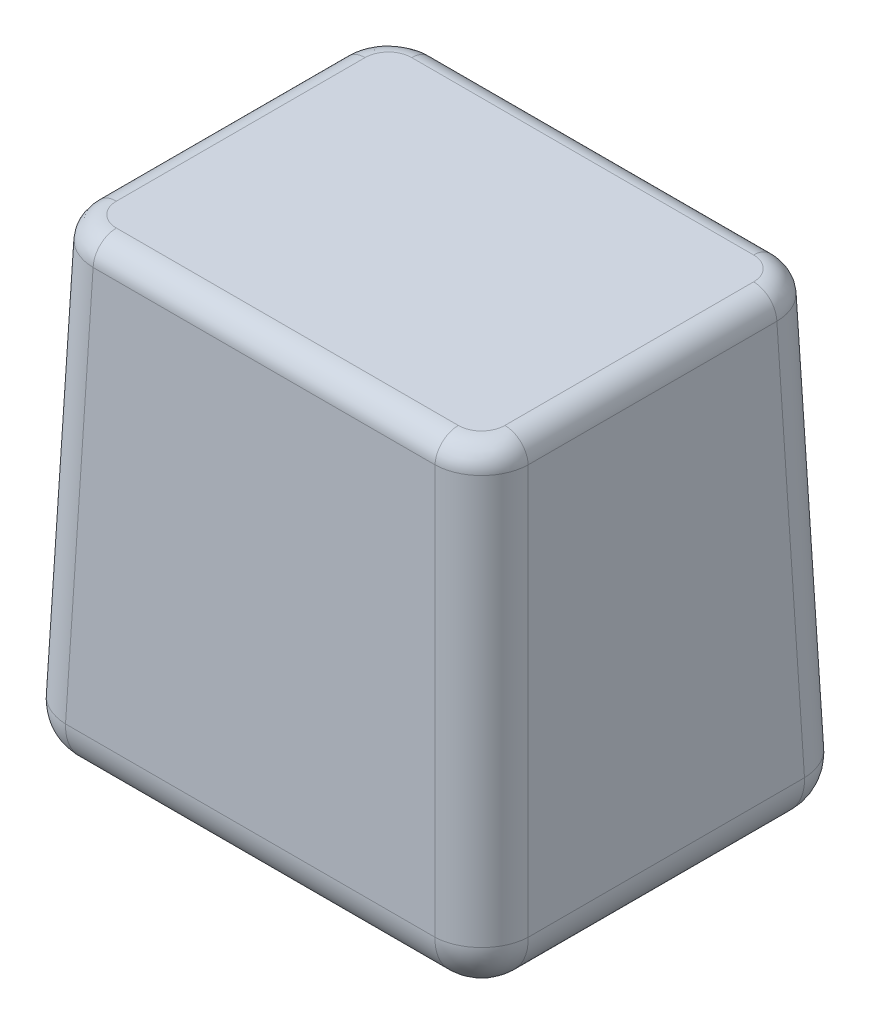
ISO-10303-21;
HEADER;
FILE_DESCRIPTION(('STEP AP214'),'2;1');
FILE_NAME('part.step','',(''),(''),'','','');
FILE_SCHEMA(('AUTOMOTIVE_DESIGN { 1 0 10303 214 1 1 1 1 }'));
ENDSEC;
DATA;
#1=APPLICATION_CONTEXT('core data for automotive mechanical design processes');
#2=APPLICATION_PROTOCOL_DEFINITION('international standard','automotive_design',2000,#1);
#3=PRODUCT_CONTEXT('',#1,'mechanical');
#4=PRODUCT('Part','Part','',(#3));
#5=PRODUCT_RELATED_PRODUCT_CATEGORY('part','',(#4));
#6=PRODUCT_DEFINITION_FORMATION('','',#4);
#7=PRODUCT_DEFINITION_CONTEXT('part definition',#1,'design');
#8=PRODUCT_DEFINITION('design','',#6,#7);
#9=PRODUCT_DEFINITION_SHAPE('','',#8);
#10=(LENGTH_UNIT() NAMED_UNIT(*) SI_UNIT(.MILLI.,.METRE.));
#11=(NAMED_UNIT(*) PLANE_ANGLE_UNIT() SI_UNIT($,.RADIAN.));
#12=(NAMED_UNIT(*) SI_UNIT($,.STERADIAN.) SOLID_ANGLE_UNIT());
#13=UNCERTAINTY_MEASURE_WITH_UNIT(LENGTH_MEASURE(1.E-05),#10,'distance_accuracy_value','');
#14=(GEOMETRIC_REPRESENTATION_CONTEXT(3) GLOBAL_UNCERTAINTY_ASSIGNED_CONTEXT((#13)) GLOBAL_UNIT_ASSIGNED_CONTEXT((#10,
#11,#12)) REPRESENTATION_CONTEXT('',''));
#15=CARTESIAN_POINT('',(0.,0.,0.));
#16=DIRECTION('',(0.,0.,1.));
#17=DIRECTION('',(1.,0.,0.));
#18=AXIS2_PLACEMENT_3D('',#15,#16,#17);
#19=CARTESIAN_POINT('',(-127.,0.,101.6));
#20=DIRECTION('',(-0.999390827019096,0.034899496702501,0.));
#21=DIRECTION('',(-0.034899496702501,-0.999390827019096,0.));
#22=AXIS2_PLACEMENT_3D('',#19,#20,#21);
#23=PLANE('',#22);
#24=DIRECTION('',(0.,0.,-1.));
#25=VECTOR('',#24,1.);
#26=CARTESIAN_POINT('',(-126.082057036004,26.2864472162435,101.6));
#27=LINE('',#26,#25);
#28=CARTESIAN_POINT('',(-126.082057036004,26.2864472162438,13.5142463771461));
#29=VERTEX_POINT('',#28);
#30=CARTESIAN_POINT('',(-126.082057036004,26.2864472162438,26.1910578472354));
#31=VERTEX_POINT('',#30);
#32=EDGE_CURVE('E193',#29,#31,#27,.F.);
#33=ORIENTED_EDGE('',*,*,#32,.T.);
#34=CARTESIAN_POINT('',(-126.068663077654,26.6700000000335,19.8526521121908));
#35=DIRECTION('',(-0.999390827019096,0.034899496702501,0.));
#36=DIRECTION('',(-0.034899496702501,-0.999390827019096,0.));
#37=AXIS2_PLACEMENT_3D('',#34,#35,#36);
#38=ELLIPSE('',#37,6.35387060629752,6.35);
#39=EDGE_CURVE('E186',#29,#31,#38,.F.);
#40=ORIENTED_EDGE('',*,*,#39,.F.);
#41=EDGE_LOOP('',(#33,#40));
#42=FACE_BOUND('',#41,.T.);
#43=ADVANCED_FACE('F37',(#42),#23,.T.);
#44=CARTESIAN_POINT('',(-100.697530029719,25.4,0.));
#45=DIRECTION('',(0.,0.,-1.));
#46=DIRECTION('',(-1.,0.,0.));
#47=AXIS2_PLACEMENT_3D('',#44,#45,#46);
#48=CYLINDRICAL_SURFACE('',#47,25.4);
#49=DIRECTION('',(0.,0.,-1.));
#50=VECTOR('',#49,1.);
#51=CARTESIAN_POINT('',(-126.082057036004,24.5135527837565,0.));
#52=LINE('',#51,#50);
#53=CARTESIAN_POINT('',(-126.082057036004,24.5135527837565,30.3004250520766));
#54=VERTEX_POINT('',#53);
#55=CARTESIAN_POINT('',(-126.082057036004,24.5135527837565,25.8252759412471));
#56=VERTEX_POINT('',#55);
#57=EDGE_CURVE('E175',#54,#56,#52,.T.);
#58=ORIENTED_EDGE('',*,*,#57,.T.);
#59=CARTESIAN_POINT('',(-126.097530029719,25.4,26.0743560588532));
#60=CARTESIAN_POINT('',(-126.097533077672,25.571130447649,26.1092934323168));
#61=CARTESIAN_POINT('',(-126.095798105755,25.7436474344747,26.1371471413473));
#62=CARTESIAN_POINT('',(-126.088737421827,26.0903649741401,26.1785496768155));
#63=CARTESIAN_POINT('',(-126.083411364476,26.2645656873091,26.1920971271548));
#64=CARTESIAN_POINT('',(-126.069132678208,26.6133707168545,26.2047986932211));
#65=CARTESIAN_POINT('',(-126.060179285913,26.7879751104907,26.2039497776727));
#66=CARTESIAN_POINT('',(-126.038711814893,27.1363676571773,26.1879041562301));
#67=CARTESIAN_POINT('',(-126.026196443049,27.3101554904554,26.1727022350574));
#68=CARTESIAN_POINT('',(-125.997790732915,27.6553863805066,26.1281414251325));
#69=CARTESIAN_POINT('',(-125.981904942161,27.8268322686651,26.0988015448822));
#70=CARTESIAN_POINT('',(-125.946998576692,28.1664966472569,26.0262388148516));
#71=CARTESIAN_POINT('',(-125.927976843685,28.3347139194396,25.983010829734));
#72=CARTESIAN_POINT('',(-125.887145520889,28.6666824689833,25.8830572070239));
#73=CARTESIAN_POINT('',(-125.865336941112,28.8304353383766,25.8263364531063));
#74=CARTESIAN_POINT('',(-125.819338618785,29.1525008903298,25.6998452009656));
#75=CARTESIAN_POINT('',(-125.795147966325,29.3108114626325,25.6300697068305));
#76=CARTESIAN_POINT('',(-125.718888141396,29.7809996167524,25.3994661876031));
#77=CARTESIAN_POINT('',(-125.663783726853,30.0829755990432,25.2189167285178));
#78=CARTESIAN_POINT('',(-125.550181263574,30.6526527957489,24.8108574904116));
#79=CARTESIAN_POINT('',(-125.491682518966,30.9203469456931,24.5833380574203));
#80=CARTESIAN_POINT('',(-125.404399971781,31.2947208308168,24.2077692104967));
#81=CARTESIAN_POINT('',(-125.374958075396,31.4165487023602,24.0746600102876));
#82=CARTESIAN_POINT('',(-125.317238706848,31.6485363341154,23.7984297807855));
#83=CARTESIAN_POINT('',(-125.288960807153,31.7587004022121,23.6553124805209));
#84=CARTESIAN_POINT('',(-125.234258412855,31.9666227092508,23.3599208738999));
#85=CARTESIAN_POINT('',(-125.20783466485,32.0643759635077,23.2076429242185));
#86=CARTESIAN_POINT('',(-125.157543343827,32.2466550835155,22.8950418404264));
#87=CARTESIAN_POINT('',(-125.133674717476,32.331186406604,22.7347220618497));
#88=CARTESIAN_POINT('',(-125.089272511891,32.485854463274,22.408185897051));
#89=CARTESIAN_POINT('',(-125.068717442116,32.556084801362,22.2420167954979));
#90=CARTESIAN_POINT('',(-125.03132026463,32.6822375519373,21.9039996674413));
#91=CARTESIAN_POINT('',(-125.014476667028,32.7381657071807,21.7321539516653));
#92=CARTESIAN_POINT('',(-124.984971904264,32.835236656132,21.3839957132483));
#93=CARTESIAN_POINT('',(-124.972310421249,32.8763805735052,21.2076835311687));
#94=CARTESIAN_POINT('',(-124.951539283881,32.9434921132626,20.8519311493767));
#95=CARTESIAN_POINT('',(-124.943429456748,32.9694603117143,20.6724910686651));
#96=CARTESIAN_POINT('',(-124.932239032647,33.0052096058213,20.3193479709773));
#97=CARTESIAN_POINT('',(-124.928964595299,33.0156148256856,20.1457140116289));
#98=CARTESIAN_POINT('',(-124.926911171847,33.0221455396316,19.798089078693));
#99=CARTESIAN_POINT('',(-124.928133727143,33.0182661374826,19.6240980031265));
#100=CARTESIAN_POINT('',(-124.935042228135,32.9962578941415,19.2771909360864));
#101=CARTESIAN_POINT('',(-124.94072612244,32.9781356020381,19.1042744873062));
#102=CARTESIAN_POINT('',(-124.9564003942,32.9278085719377,18.7606365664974));
#103=CARTESIAN_POINT('',(-124.966392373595,32.8955985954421,18.589915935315));
#104=CARTESIAN_POINT('',(-124.990189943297,32.8181050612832,18.2550617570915));
#105=CARTESIAN_POINT('',(-125.003922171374,32.7730723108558,18.0908648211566));
#106=CARTESIAN_POINT('',(-125.034927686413,32.6700733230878,17.7668601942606));
#107=CARTESIAN_POINT('',(-125.052202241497,32.6121024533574,17.6070540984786));
#108=CARTESIAN_POINT('',(-125.089855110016,32.4837100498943,17.2929538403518));
#109=CARTESIAN_POINT('',(-125.110232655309,32.4132915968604,17.1386583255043));
#110=CARTESIAN_POINT('',(-125.153613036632,32.2604890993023,16.8364264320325));
#111=CARTESIAN_POINT('',(-125.17661686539,32.1781005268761,16.6884924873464));
#112=CARTESIAN_POINT('',(-125.225434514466,31.999298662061,16.3955728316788));
#113=CARTESIAN_POINT('',(-125.251312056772,31.9025379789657,16.2508097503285));
#114=CARTESIAN_POINT('',(-125.304675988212,31.6975854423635,15.9698523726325));
#115=CARTESIAN_POINT('',(-125.332162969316,31.5893893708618,15.8336612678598));
#116=CARTESIAN_POINT('',(-125.388102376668,31.3623234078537,15.5707407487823));
#117=CARTESIAN_POINT('',(-125.41655464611,31.2434552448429,15.444009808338));
#118=CARTESIAN_POINT('',(-125.473806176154,30.9957406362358,15.200703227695));
#119=CARTESIAN_POINT('',(-125.502605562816,30.8668904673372,15.0841314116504));
#120=CARTESIAN_POINT('',(-125.560963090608,30.5951579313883,14.8578553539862));
#121=CARTESIAN_POINT('',(-125.590510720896,30.4519356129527,14.7485552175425));
#122=CARTESIAN_POINT('',(-125.648631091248,30.1566073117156,14.5424183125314));
#123=CARTESIAN_POINT('',(-125.67720347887,30.0044981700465,14.4455860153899));
#124=CARTESIAN_POINT('',(-125.760475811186,29.5362501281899,14.1749203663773));
#125=CARTESIAN_POINT('',(-125.812797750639,29.2078886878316,14.0206668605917));
#126=CARTESIAN_POINT('',(-125.882916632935,28.6993628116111,13.8329413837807));
#127=CARTESIAN_POINT('',(-125.904874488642,28.5274035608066,13.7776817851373));
#128=CARTESIAN_POINT('',(-125.945648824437,28.1790529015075,13.6819305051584));
#129=CARTESIAN_POINT('',(-125.964466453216,28.0026631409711,13.6414334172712));
#130=CARTESIAN_POINT('',(-125.998598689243,27.6467555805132,13.5756129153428));
#131=CARTESIAN_POINT('',(-126.01391329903,27.4672377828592,13.5502894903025));
#132=CARTESIAN_POINT('',(-126.040790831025,27.1064159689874,13.5150741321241));
#133=CARTESIAN_POINT('',(-126.052353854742,26.9251120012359,13.5051817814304));
#134=CARTESIAN_POINT('',(-126.071273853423,26.5679271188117,13.5010431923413));
#135=CARTESIAN_POINT('',(-126.078753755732,26.3920586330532,13.5063056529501));
#136=CARTESIAN_POINT('',(-126.090043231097,26.0412320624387,13.5314069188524));
#137=CARTESIAN_POINT('',(-126.093851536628,25.8662743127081,13.5512507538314));
#138=CARTESIAN_POINT('',(-126.099835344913,25.3448631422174,13.6325319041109));
#139=CARTESIAN_POINT('',(-126.096591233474,25.0014577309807,13.7157143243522));
#140=CARTESIAN_POINT('',(-126.077476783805,24.3382819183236,13.9360454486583));
#141=CARTESIAN_POINT('',(-126.061779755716,24.0182524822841,14.0724404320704));
#142=CARTESIAN_POINT('',(-126.020935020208,23.4051131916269,14.3952733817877));
#143=CARTESIAN_POINT('',(-125.995786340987,23.1120061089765,14.5817164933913));
#144=CARTESIAN_POINT('',(-125.939336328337,22.5555382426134,15.0031398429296));
#145=CARTESIAN_POINT('',(-125.90793412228,22.2927946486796,15.2389195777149));
#146=CARTESIAN_POINT('',(-125.843713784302,21.8098879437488,15.7507683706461));
#147=CARTESIAN_POINT('',(-125.810895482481,21.5897299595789,16.0268422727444));
#148=CARTESIAN_POINT('',(-125.763706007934,21.2942693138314,16.4679434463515));
#149=CARTESIAN_POINT('',(-125.74818106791,21.2008767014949,16.6210325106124));
#150=CARTESIAN_POINT('',(-125.718470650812,21.0273260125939,16.9346407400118));
#151=CARTESIAN_POINT('',(-125.704284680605,20.9471630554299,17.0951571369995));
#152=CARTESIAN_POINT('',(-125.677750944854,20.800639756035,17.4225691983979));
#153=CARTESIAN_POINT('',(-125.665403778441,20.7342839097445,17.5894669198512));
#154=CARTESIAN_POINT('',(-125.642996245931,20.6159280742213,17.9283579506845));
#155=CARTESIAN_POINT('',(-125.632934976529,20.5639224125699,18.1003492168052));
#156=CARTESIAN_POINT('',(-125.615525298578,20.4750076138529,18.4468417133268));
#157=CARTESIAN_POINT('',(-125.608155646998,20.4379800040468,18.6213114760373));
#158=CARTESIAN_POINT('',(-125.596280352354,20.3787305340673,18.9727795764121));
#159=CARTESIAN_POINT('',(-125.591773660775,20.3565032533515,19.1497769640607));
#160=CARTESIAN_POINT('',(-125.585781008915,20.3270136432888,19.5050819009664));
#161=CARTESIAN_POINT('',(-125.584295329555,20.3197527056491,19.6833895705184));
#162=CARTESIAN_POINT('',(-125.584398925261,20.3202601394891,20.0399774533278));
#163=CARTESIAN_POINT('',(-125.585988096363,20.3280280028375,20.2182576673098));
#164=CARTESIAN_POINT('',(-125.592131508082,20.3582692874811,20.5704748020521));
#165=CARTESIAN_POINT('',(-125.596635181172,20.3804919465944,20.7444342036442));
#166=CARTESIAN_POINT('',(-125.608402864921,20.4392228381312,21.0898270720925));
#167=CARTESIAN_POINT('',(-125.615666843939,20.475730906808,21.2612605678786));
#168=CARTESIAN_POINT('',(-125.632707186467,20.5627586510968,21.6004404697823));
#169=CARTESIAN_POINT('',(-125.642484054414,20.6132811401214,21.7681861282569));
#170=CARTESIAN_POINT('',(-125.664211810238,20.7279339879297,22.0987477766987));
#171=CARTESIAN_POINT('',(-125.676161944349,20.792059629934,22.2615654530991));
#172=CARTESIAN_POINT('',(-125.70191280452,20.9338981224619,22.5822233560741));
#173=CARTESIAN_POINT('',(-125.715724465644,21.011692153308,22.7400267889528));
#174=CARTESIAN_POINT('',(-125.744665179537,21.1800110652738,23.0484903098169));
#175=CARTESIAN_POINT('',(-125.759793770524,21.2705314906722,23.199152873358));
#176=CARTESIAN_POINT('',(-125.79086706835,21.4637564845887,23.4924860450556));
#177=CARTESIAN_POINT('',(-125.80681223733,21.5664679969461,23.6351520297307));
#178=CARTESIAN_POINT('',(-125.838960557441,21.783305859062,23.9114136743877));
#179=CARTESIAN_POINT('',(-125.855163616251,21.8974281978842,24.0450124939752));
#180=CARTESIAN_POINT('',(-125.887575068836,22.1386038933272,24.3047229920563));
#181=CARTESIAN_POINT('',(-125.903777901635,22.2658590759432,24.4306480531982));
#182=CARTESIAN_POINT('',(-125.935280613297,22.5305570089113,24.6713137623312));
#183=CARTESIAN_POINT('',(-125.950580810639,22.6679961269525,24.7860583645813));
#184=CARTESIAN_POINT('',(-125.979704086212,22.9521341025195,25.0035708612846));
#185=CARTESIAN_POINT('',(-125.993527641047,23.0988299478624,25.1063426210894));
#186=CARTESIAN_POINT('',(-126.01915640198,23.4004558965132,25.2991779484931));
#187=CARTESIAN_POINT('',(-126.030961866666,23.5553849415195,25.3892431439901));
#188=CARTESIAN_POINT('',(-126.059106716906,23.9785405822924,25.6118017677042));
#189=CARTESIAN_POINT('',(-126.073203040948,24.2532848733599,25.7324213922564));
#190=CARTESIAN_POINT('',(-126.09241169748,24.8173286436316,25.9337498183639));
#191=CARTESIAN_POINT('',(-126.09752480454,25.1066268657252,26.0144620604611));
#192=CARTESIAN_POINT('',(-126.097530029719,25.4,26.0743560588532));
#193=B_SPLINE_CURVE_WITH_KNOTS('',3,(#59,#60,#61,#62,#63,#64,#65,#66,#67,#68,#69,#70,#71,#72,
#73,#74,#75,#76,#77,#78,#79,#80,#81,#82,#83,#84,#85,#86,#87,#88,#89,#90,#91,#92,#93,#94,#95,#96,
#97,#98,#99,#100,#101,#102,#103,#104,#105,#106,#107,#108,#109,#110,#111,#112,#113,#114,#115,
#116,#117,#118,#119,#120,#121,#122,#123,#124,#125,#126,#127,#128,#129,#130,#131,#132,#133,#134,
#135,#136,#137,#138,#139,#140,#141,#142,#143,#144,#145,#146,#147,#148,#149,#150,#151,#152,#153,
#154,#155,#156,#157,#158,#159,#160,#161,#162,#163,#164,#165,#166,#167,#168,#169,#170,#171,#172,
#173,#174,#175,#176,#177,#178,#179,#180,#181,#182,#183,#184,#185,#186,#187,#188,#189,#190,#191,
#192),.UNSPECIFIED.,.T.,.F.,(4,2,2,2,2,2,2,2,2,2,2,2,2,2,2,2,2,2,2,2,2,2,2,2,2,2,2,2,2,2,2,2,2,
2,2,2,2,2,2,2,2,2,2,2,2,2,2,2,2,2,2,2,2,2,2,2,2,2,2,2,2,2,2,2,2,2,4),(0.,0.523722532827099,
1.04749543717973,1.57137862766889,2.09545224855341,2.61882320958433,3.14238791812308,
3.66576341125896,4.18933960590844,5.25257508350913,6.31602931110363,6.86397254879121,
7.41171269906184,7.95967215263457,8.50740483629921,9.05142823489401,9.59523284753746,
10.1389961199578,10.6827387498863,11.2040290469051,11.7254980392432,12.2467273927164,
12.7681507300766,13.2800037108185,13.7920402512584,14.3039502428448,14.8160543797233,
15.3435667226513,15.8712743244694,16.3988966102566,16.9267166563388,17.4737380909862,
18.0209551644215,19.1142080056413,19.6595427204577,20.2046775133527,20.7498119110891,
21.2949315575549,21.8225799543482,22.350410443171,23.4048436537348,24.4448541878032,
25.4849716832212,26.5434695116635,27.6020946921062,28.1415577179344,28.6808212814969,
29.2202601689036,29.7594855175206,30.2943581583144,30.8290347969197,31.3637611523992,
31.8984694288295,32.4241404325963,32.9498054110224,33.4755759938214,34.0011645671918,
34.5299873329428,35.058625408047,35.5875660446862,36.1163214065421,36.6549598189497,
37.1934070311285,37.7316799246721,38.2698837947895,39.167791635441,40.065622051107),.UNSPECIFIED.);
#194=EDGE_CURVE('E48',#56,#31,#193,.T.);
#195=ORIENTED_EDGE('',*,*,#194,.T.);
#196=ORIENTED_EDGE('',*,*,#32,.F.);
#197=CARTESIAN_POINT('',(-126.082057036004,24.5135527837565,13.8800282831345));
#198=VERTEX_POINT('',#197);
#199=EDGE_CURVE('E367',#29,#198,#193,.T.);
#200=ORIENTED_EDGE('',*,*,#199,.T.);
#201=CARTESIAN_POINT('',(-126.082057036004,24.5135527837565,9.40487917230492));
#202=VERTEX_POINT('',#201);
#203=EDGE_CURVE('E291',#198,#202,#52,.T.);
#204=ORIENTED_EDGE('',*,*,#203,.T.);
#205=CARTESIAN_POINT('',(-126.097530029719,25.4,30.4447871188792));
#206=CARTESIAN_POINT('',(-126.097528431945,25.6813571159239,30.4785199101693));
#207=CARTESIAN_POINT('',(-126.092842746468,25.9641438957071,30.5010417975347));
#208=CARTESIAN_POINT('',(-126.073946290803,26.530417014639,30.5235055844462));
#209=CARTESIAN_POINT('',(-126.059729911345,26.8139036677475,30.523434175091));
#210=CARTESIAN_POINT('',(-126.021833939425,27.379963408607,30.5007773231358));
#211=CARTESIAN_POINT('',(-125.99813399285,27.6625332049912,30.4781432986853));
#212=CARTESIAN_POINT('',(-125.941627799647,28.224030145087,30.4106429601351));
#213=CARTESIAN_POINT('',(-125.90882287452,28.502957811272,30.3657798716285));
#214=CARTESIAN_POINT('',(-125.834796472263,29.0544513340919,30.2545514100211));
#215=CARTESIAN_POINT('',(-125.793600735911,29.3270338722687,30.1882514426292));
#216=CARTESIAN_POINT('',(-125.703498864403,29.8649643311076,30.0348258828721));
#217=CARTESIAN_POINT('',(-125.654592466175,30.1303120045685,29.9476995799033));
#218=CARTESIAN_POINT('',(-125.550029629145,30.6520489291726,29.7535082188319));
#219=CARTESIAN_POINT('',(-125.494376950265,30.9084430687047,29.6464542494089));
#220=CARTESIAN_POINT('',(-125.377337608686,31.4111341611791,29.413231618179));
#221=CARTESIAN_POINT('',(-125.315948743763,31.6574271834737,29.2870556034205));
#222=CARTESIAN_POINT('',(-125.185920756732,32.1487781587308,29.0108164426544));
#223=CARTESIAN_POINT('',(-125.117084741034,32.3933426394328,28.8599683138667));
#224=CARTESIAN_POINT('',(-124.97584704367,32.8689286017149,28.5395254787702));
#225=CARTESIAN_POINT('',(-124.903443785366,33.0999439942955,28.3699224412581));
#226=CARTESIAN_POINT('',(-124.756566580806,33.547282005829,28.0129904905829));
#227=CARTESIAN_POINT('',(-124.682091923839,33.7635994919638,27.8256554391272));
#228=CARTESIAN_POINT('',(-124.532658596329,34.1804141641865,27.4343162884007));
#229=CARTESIAN_POINT('',(-124.45769991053,34.380910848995,27.2303116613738));
#230=CARTESIAN_POINT('',(-124.303416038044,34.779290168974,26.7909480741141));
#231=CARTESIAN_POINT('',(-124.22417799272,34.9758824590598,26.5543860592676));
#232=CARTESIAN_POINT('',(-124.069087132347,35.3484193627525,26.0644145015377));
#233=CARTESIAN_POINT('',(-123.993234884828,35.5243605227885,25.8110021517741));
#234=CARTESIAN_POINT('',(-123.847051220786,35.8542929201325,25.2886812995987));
#235=CARTESIAN_POINT('',(-123.77672067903,36.0082806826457,25.0197703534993));
#236=CARTESIAN_POINT('',(-123.643776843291,36.2928612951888,24.4681710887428));
#237=CARTESIAN_POINT('',(-123.581159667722,36.4234659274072,24.1854898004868));
#238=CARTESIAN_POINT('',(-123.466963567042,36.6574189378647,23.6144057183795));
#239=CARTESIAN_POINT('',(-123.415172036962,36.7613039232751,23.3262657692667));
#240=CARTESIAN_POINT('',(-123.322736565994,36.9442867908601,22.7404542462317));
#241=CARTESIAN_POINT('',(-123.28209252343,37.0233848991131,22.4427827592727));
#242=CARTESIAN_POINT('',(-123.213519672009,37.1556697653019,21.8405883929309));
#243=CARTESIAN_POINT('',(-123.185578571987,37.2088815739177,21.5360724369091));
#244=CARTESIAN_POINT('',(-123.143479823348,37.2887088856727,20.9226409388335));
#245=CARTESIAN_POINT('',(-123.129320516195,37.3153275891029,20.6137259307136));
#246=CARTESIAN_POINT('',(-123.116130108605,37.3401220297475,20.0284081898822));
#247=CARTESIAN_POINT('',(-123.115610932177,37.3410955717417,19.7521531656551));
#248=CARTESIAN_POINT('',(-123.125969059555,37.3216295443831,19.2006288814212));
#249=CARTESIAN_POINT('',(-123.136845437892,37.3011917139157,18.9253595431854));
#250=CARTESIAN_POINT('',(-123.169634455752,37.2391614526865,18.3778785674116));
#251=CARTESIAN_POINT('',(-123.191547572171,37.1975681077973,18.1056670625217));
#252=CARTESIAN_POINT('',(-123.245703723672,37.0937283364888,17.5662671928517));
#253=CARTESIAN_POINT('',(-123.277946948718,37.031481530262,17.299078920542));
#254=CARTESIAN_POINT('',(-123.350708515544,36.8891121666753,16.7791370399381));
#255=CARTESIAN_POINT('',(-123.390959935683,36.8095599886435,16.5261895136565));
#256=CARTESIAN_POINT('',(-123.479184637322,36.6323632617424,16.0280604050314));
#257=CARTESIAN_POINT('',(-123.527160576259,36.5347124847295,15.7828815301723));
#258=CARTESIAN_POINT('',(-123.680864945,36.2158287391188,15.0610086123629));
#259=CARTESIAN_POINT('',(-123.796418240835,35.9685736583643,14.597650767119));
#260=CARTESIAN_POINT('',(-124.055034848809,35.3848758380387,13.6733634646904));
#261=CARTESIAN_POINT('',(-124.199666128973,35.0422114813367,13.2168044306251));
#262=CARTESIAN_POINT('',(-124.420660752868,34.4782187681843,12.5781171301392));
#263=CARTESIAN_POINT('',(-124.495047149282,34.2817525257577,12.3728014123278));
#264=CARTESIAN_POINT('',(-124.643639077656,33.8729632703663,11.9783798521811));
#265=CARTESIAN_POINT('',(-124.717844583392,33.6606380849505,11.7892762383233));
#266=CARTESIAN_POINT('',(-124.870684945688,33.2026704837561,11.4131313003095));
#267=CARTESIAN_POINT('',(-124.949165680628,32.9557283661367,11.2276084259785));
#268=CARTESIAN_POINT('',(-125.102152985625,32.4459324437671,10.8782289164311));
#269=CARTESIAN_POINT('',(-125.176660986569,32.1830844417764,10.714364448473));
#270=CARTESIAN_POINT('',(-125.319963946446,31.6429021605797,10.4095248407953));
#271=CARTESIAN_POINT('',(-125.388758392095,31.3655665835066,10.2685517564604));
#272=CARTESIAN_POINT('',(-125.518976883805,30.7981912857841,10.0108369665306));
#273=CARTESIAN_POINT('',(-125.580401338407,30.5081522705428,9.89409391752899));
#274=CARTESIAN_POINT('',(-125.692803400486,29.9256815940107,9.68902119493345));
#275=CARTESIAN_POINT('',(-125.744026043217,29.6335461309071,9.59998534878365));
#276=CARTESIAN_POINT('',(-125.836960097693,29.041275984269,9.44703799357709));
#277=CARTESIAN_POINT('',(-125.878671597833,28.7411413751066,9.38312625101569));
#278=CARTESIAN_POINT('',(-125.951650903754,28.1353956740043,9.28131768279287));
#279=CARTESIAN_POINT('',(-125.982924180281,27.829787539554,9.24340721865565));
#280=CARTESIAN_POINT('',(-126.034436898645,27.2155203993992,9.19415568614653));
#281=CARTESIAN_POINT('',(-126.054677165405,26.9068616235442,9.18281263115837));
#282=CARTESIAN_POINT('',(-126.082665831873,26.3141586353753,9.18680884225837));
#283=CARTESIAN_POINT('',(-126.091291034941,26.0301395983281,9.20006730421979));
#284=CARTESIAN_POINT('',(-126.099027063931,25.4639502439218,9.24923749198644));
#285=CARTESIAN_POINT('',(-126.098138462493,25.1817798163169,9.28514785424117));
#286=CARTESIAN_POINT('',(-126.08714084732,24.6214110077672,9.37934182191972));
#287=CARTESIAN_POINT('',(-126.077032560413,24.3432123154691,9.43762366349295));
#288=CARTESIAN_POINT('',(-126.048127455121,23.7927759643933,9.57606008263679));
#289=CARTESIAN_POINT('',(-126.029330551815,23.5205383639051,9.65621487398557));
#290=CARTESIAN_POINT('',(-125.984252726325,22.9893408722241,9.83586647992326));
#291=CARTESIAN_POINT('',(-125.958130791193,22.7302238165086,9.93493949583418));
#292=CARTESIAN_POINT('',(-125.899117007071,22.2210490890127,10.1526647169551));
#293=CARTESIAN_POINT('',(-125.866222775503,21.9709946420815,10.2713238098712));
#294=CARTESIAN_POINT('',(-125.794673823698,21.4815107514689,10.5273057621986));
#295=CARTESIAN_POINT('',(-125.756019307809,21.2420809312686,10.6646279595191));
#296=CARTESIAN_POINT('',(-125.674054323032,20.775128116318,10.957001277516));
#297=CARTESIAN_POINT('',(-125.630743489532,20.5476060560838,11.1120537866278));
#298=CARTESIAN_POINT('',(-125.538191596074,20.0935792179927,11.4478363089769));
#299=CARTESIAN_POINT('',(-125.488755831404,19.8678089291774,11.6295063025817));
#300=CARTESIAN_POINT('',(-125.387487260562,19.432081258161,12.0103003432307));
#301=CARTESIAN_POINT('',(-125.335654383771,19.2221243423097,12.2094249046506));
#302=CARTESIAN_POINT('',(-125.23107919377,18.8190934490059,12.6240213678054));
#303=CARTESIAN_POINT('',(-125.178336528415,18.6260261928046,12.8394997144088));
#304=CARTESIAN_POINT('',(-125.073498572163,18.2579566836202,13.2855100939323));
#305=CARTESIAN_POINT('',(-125.021403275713,18.0829542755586,13.5160419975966));
#306=CARTESIAN_POINT('',(-124.916769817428,17.7435271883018,14.0031313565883));
#307=CARTESIAN_POINT('',(-124.864346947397,17.580111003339,14.2604176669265));
#308=CARTESIAN_POINT('',(-124.763699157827,17.2756405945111,14.7885524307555));
#309=CARTESIAN_POINT('',(-124.715472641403,17.134577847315,15.0593956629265));
#310=CARTESIAN_POINT('',(-124.624880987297,16.875877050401,15.6129919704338));
#311=CARTESIAN_POINT('',(-124.582515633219,16.758238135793,15.8957446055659));
#312=CARTESIAN_POINT('',(-124.505196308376,16.5474497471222,16.4712196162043));
#313=CARTESIAN_POINT('',(-124.470241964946,16.454299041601,16.7639414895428));
#314=CARTESIAN_POINT('',(-124.409994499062,16.2958248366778,17.348333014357));
#315=CARTESIAN_POINT('',(-124.38444414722,16.2297537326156,17.6397732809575));
#316=CARTESIAN_POINT('',(-124.34253602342,16.1222290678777,18.2278193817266));
#317=CARTESIAN_POINT('',(-124.326178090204,16.0807750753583,18.5244251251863));
#318=CARTESIAN_POINT('',(-124.303292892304,16.0229572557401,19.1203375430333));
#319=CARTESIAN_POINT('',(-124.296761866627,16.0065838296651,19.4196431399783));
#320=CARTESIAN_POINT('',(-124.293776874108,15.9990874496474,20.0186142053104));
#321=CARTESIAN_POINT('',(-124.29732246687,16.007963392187,20.3182796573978));
#322=CARTESIAN_POINT('',(-124.313822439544,16.0495358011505,20.8971214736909));
#323=CARTESIAN_POINT('',(-124.326184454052,16.0807329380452,21.1764239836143));
#324=CARTESIAN_POINT('',(-124.359228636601,16.1649546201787,21.7312041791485));
#325=CARTESIAN_POINT('',(-124.379910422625,16.2179781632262,22.0066820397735));
#326=CARTESIAN_POINT('',(-124.428904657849,16.3453600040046,22.5519941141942));
#327=CARTESIAN_POINT('',(-124.457218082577,16.4197210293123,22.8218276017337));
#328=CARTESIAN_POINT('',(-124.520557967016,16.5891255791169,23.3541101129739));
#329=CARTESIAN_POINT('',(-124.555584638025,16.6841697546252,23.6165589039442));
#330=CARTESIAN_POINT('',(-124.631848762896,16.895811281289,24.1365130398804));
#331=CARTESIAN_POINT('',(-124.673174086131,17.0127199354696,24.393878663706));
#332=CARTESIAN_POINT('',(-124.760369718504,17.2662607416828,24.8980015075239));
#333=CARTESIAN_POINT('',(-124.806241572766,17.4028996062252,25.1447550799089));
#334=CARTESIAN_POINT('',(-124.901167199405,17.6949679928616,25.6262394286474));
#335=CARTESIAN_POINT('',(-124.950221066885,17.8503980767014,25.8609698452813));
#336=CARTESIAN_POINT('',(-125.050112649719,18.179111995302,26.3171782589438));
#337=CARTESIAN_POINT('',(-125.100950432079,18.3523965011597,26.538655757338));
#338=CARTESIAN_POINT('',(-125.206362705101,18.7278494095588,26.981337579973));
#339=CARTESIAN_POINT('',(-125.260962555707,18.9311689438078,27.2015609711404));
#340=CARTESIAN_POINT('',(-125.36886237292,19.3557207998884,27.6242183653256));
#341=CARTESIAN_POINT('',(-125.422162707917,19.576947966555,27.8266574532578));
#342=CARTESIAN_POINT('',(-125.525857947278,20.0362698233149,28.2126709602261));
#343=CARTESIAN_POINT('',(-125.576250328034,20.2743787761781,28.3962290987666));
#344=CARTESIAN_POINT('',(-125.672465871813,20.7658584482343,28.74297118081));
#345=CARTESIAN_POINT('',(-125.718289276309,21.019228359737,28.9061562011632));
#346=CARTESIAN_POINT('',(-125.804224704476,21.5419386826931,29.2122320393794));
#347=CARTESIAN_POINT('',(-125.844283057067,21.8113997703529,29.3549321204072));
#348=CARTESIAN_POINT('',(-125.916770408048,22.3623865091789,29.6170641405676));
#349=CARTESIAN_POINT('',(-125.949200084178,22.6439110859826,29.7364981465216));
#350=CARTESIAN_POINT('',(-126.00510741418,23.2162003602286,29.9507019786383));
#351=CARTESIAN_POINT('',(-126.028608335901,23.5069388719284,30.045535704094));
#352=CARTESIAN_POINT('',(-126.065745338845,24.0959331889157,30.2099573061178));
#353=CARTESIAN_POINT('',(-126.079388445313,24.394183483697,30.2795631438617));
#354=CARTESIAN_POINT('',(-126.090987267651,24.8117546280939,30.3582366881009));
#355=CARTESIAN_POINT('',(-126.093434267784,24.9289733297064,30.3782966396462));
#356=CARTESIAN_POINT('',(-126.096706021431,25.1640440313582,30.414492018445));
#357=CARTESIAN_POINT('',(-126.09753070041,25.2818960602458,30.4306272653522));
#358=CARTESIAN_POINT('',(-126.097530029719,25.4,30.4447871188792));
#359=B_SPLINE_CURVE_WITH_KNOTS('',3,(#205,#206,#207,#208,#209,#210,#211,#212,#213,#214,#215,
#216,#217,#218,#219,#220,#221,#222,#223,#224,#225,#226,#227,#228,#229,#230,#231,#232,#233,#234,
#235,#236,#237,#238,#239,#240,#241,#242,#243,#244,#245,#246,#247,#248,#249,#250,#251,#252,#253,
#254,#255,#256,#257,#258,#259,#260,#261,#262,#263,#264,#265,#266,#267,#268,#269,#270,#271,#272,
#273,#274,#275,#276,#277,#278,#279,#280,#281,#282,#283,#284,#285,#286,#287,#288,#289,#290,#291,
#292,#293,#294,#295,#296,#297,#298,#299,#300,#301,#302,#303,#304,#305,#306,#307,#308,#309,#310,
#311,#312,#313,#314,#315,#316,#317,#318,#319,#320,#321,#322,#323,#324,#325,#326,#327,#328,#329,
#330,#331,#332,#333,#334,#335,#336,#337,#338,#339,#340,#341,#342,#343,#344,#345,#346,#347,#348,
#349,#350,#351,#352,#353,#354,#355,#356,#357,#358),.UNSPECIFIED.,.T.,.F.,(4,2,2,2,2,2,2,2,2,2,2,
2,2,2,2,2,2,2,2,2,2,2,2,2,2,2,2,2,2,2,2,2,2,2,2,2,2,2,2,2,2,2,2,2,2,2,2,2,2,2,2,2,2,2,2,2,2,2,2,
2,2,2,2,2,2,2,2,2,2,2,2,2,2,2,2,2,4),(0.,0.849998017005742,1.70049673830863,2.55283071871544,
3.40504105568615,4.25467538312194,5.10433870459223,5.95353063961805,6.80304994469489,
7.68852466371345,8.57439431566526,9.46057175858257,10.3467772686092,11.2985341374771,
12.2504499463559,13.2025162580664,14.1541014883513,15.0847437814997,16.0153775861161,
16.9451089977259,17.874728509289,18.7024533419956,19.5301109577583,20.3578043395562,
21.1855129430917,21.9892321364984,22.7932284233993,24.4002024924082,26.1590898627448,
27.0396151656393,27.9202613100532,28.8751650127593,29.829722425,30.7843654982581,
31.738955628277,32.6667244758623,33.5944847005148,34.5217579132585,35.448961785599,
36.3012876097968,37.1535621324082,38.0057694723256,38.8579851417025,39.6929715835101,
40.5282522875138,41.3635033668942,42.1988198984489,43.0797662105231,43.9607384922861,
44.8420597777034,45.7233734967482,46.6500622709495,47.5763968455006,48.5026972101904,
49.4289509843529,50.3275576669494,51.2261485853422,52.1243955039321,53.0226031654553,
53.8655423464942,54.708442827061,55.5514511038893,56.394485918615,57.2505906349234,
58.1069872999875,58.9634095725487,59.8198640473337,60.7327907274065,61.6454555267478,
62.5589008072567,63.4722977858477,64.3937133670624,65.3150470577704,66.2339630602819,
67.1522235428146,67.5090067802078,67.8658064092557),.UNSPECIFIED.);
#360=CARTESIAN_POINT('',(-126.082057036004,26.2864472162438,9.19154938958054));
#361=VERTEX_POINT('',#360);
#362=EDGE_CURVE('E177',#361,#202,#359,.T.);
#363=ORIENTED_EDGE('',*,*,#362,.F.);
#364=CARTESIAN_POINT('',(-126.082057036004,26.2864472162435,-75.2975300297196));
#365=VERTEX_POINT('',#364);
#366=EDGE_CURVE('E184',#365,#361,#27,.F.);
#367=ORIENTED_EDGE('',*,*,#366,.F.);
#368=CARTESIAN_POINT('',(-100.697530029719,25.4,-75.2975300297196));
#369=DIRECTION('',(0.,0.,-1.));
#370=DIRECTION('',(-1.,0.,0.));
#371=AXIS2_PLACEMENT_3D('',#368,#369,#370);
#372=CIRCLE('',#371,25.4);
#373=CARTESIAN_POINT('',(-100.697530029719,0.,-75.2975300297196));
#374=VERTEX_POINT('',#373);
#375=EDGE_CURVE('E225',#365,#374,#372,.F.);
#376=ORIENTED_EDGE('',*,*,#375,.T.);
#377=DIRECTION('',(0.,0.,-1.));
#378=VECTOR('',#377,1.);
#379=CARTESIAN_POINT('',(-100.697530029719,0.,0.));
#380=LINE('',#379,#378);
#381=CARTESIAN_POINT('',(-100.697530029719,0.,75.2975300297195));
#382=VERTEX_POINT('',#381);
#383=EDGE_CURVE('E197',#382,#374,#380,.T.);
#384=ORIENTED_EDGE('',*,*,#383,.F.);
#385=CARTESIAN_POINT('',(-100.697530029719,25.4,75.2975300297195));
#386=DIRECTION('',(0.,0.,1.));
#387=DIRECTION('',(0.,-1.,0.));
#388=AXIS2_PLACEMENT_3D('',#385,#386,#387);
#389=CIRCLE('',#388,25.4);
#390=CARTESIAN_POINT('',(-126.082057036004,26.2864472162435,75.2975300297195));
#391=VERTEX_POINT('',#390);
#392=EDGE_CURVE('E191',#382,#391,#389,.F.);
#393=ORIENTED_EDGE('',*,*,#392,.T.);
#394=CARTESIAN_POINT('',(-126.082057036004,26.2864472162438,30.513754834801));
#395=VERTEX_POINT('',#394);
#396=EDGE_CURVE('E181',#395,#391,#27,.F.);
#397=ORIENTED_EDGE('',*,*,#396,.F.);
#398=EDGE_CURVE('E166',#54,#395,#359,.T.);
#399=ORIENTED_EDGE('',*,*,#398,.F.);
#400=EDGE_LOOP('',(#58,#195,#196,#200,#204,#363,#367,#376,#384,#393,#397,#399));
#401=FACE_BOUND('',#400,.T.);
#402=ADVANCED_FACE('F188',(#401),#48,.T.);
#403=CARTESIAN_POINT('',(-122.729323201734,122.296182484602,-11.7975300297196));
#404=DIRECTION('',(-0.999390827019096,0.034899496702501,0.));
#405=DIRECTION('',(-0.034899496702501,-0.999390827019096,0.));
#406=AXIS2_PLACEMENT_3D('',#403,#404,#405);
#407=ELLIPSE('',#406,10.67450261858,10.6680000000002);
#408=CARTESIAN_POINT('',(-123.101857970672,111.628182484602,-11.7975300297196));
#409=VERTEX_POINT('',#408);
#410=EDGE_CURVE('E11',#409,#409,#407,.T.);
#411=ORIENTED_EDGE('',*,*,#410,.F.);
#412=EDGE_LOOP('',(#411));
#413=FACE_BOUND('',#412,.T.);
#414=CARTESIAN_POINT('',(-126.068663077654,26.6700000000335,19.8526521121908));
#415=DIRECTION('',(-0.999390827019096,0.034899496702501,0.));
#416=DIRECTION('',(-0.034899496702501,-0.999390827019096,0.));
#417=AXIS2_PLACEMENT_3D('',#414,#415,#416);
#418=ELLIPSE('',#417,10.6745026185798,10.668);
#419=EDGE_CURVE('E170',#361,#395,#418,.F.);
#420=ORIENTED_EDGE('',*,*,#419,.T.);
#421=ORIENTED_EDGE('',*,*,#396,.T.);
#422=DIRECTION('',(0.0348782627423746,0.998782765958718,-0.0348782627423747));
#423=VECTOR('',#422,1.);
#424=CARTESIAN_POINT('',(-118.161004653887,253.115709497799,67.3764776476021));
#425=LINE('',#424,#423);
#426=CARTESIAN_POINT('',(-118.558140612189,241.743223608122,67.7736136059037));
#427=VERTEX_POINT('',#426);
#428=EDGE_CURVE('E200',#391,#427,#425,.T.);
#429=ORIENTED_EDGE('',*,*,#428,.T.);
#430=DIRECTION('',(0.,0.,-1.));
#431=VECTOR('',#430,1.);
#432=CARTESIAN_POINT('',(-118.558140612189,241.743223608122,-67.345597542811));
#433=LINE('',#432,#431);
#434=CARTESIAN_POINT('',(-118.558140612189,241.743223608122,-67.7736136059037));
#435=VERTEX_POINT('',#434);
#436=EDGE_CURVE('E289',#427,#435,#433,.T.);
#437=ORIENTED_EDGE('',*,*,#436,.T.);
#438=DIRECTION('',(-0.0348782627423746,-0.998782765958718,-0.0348782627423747));
#439=VECTOR('',#438,1.);
#440=CARTESIAN_POINT('',(-126.783688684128,6.19434562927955,-75.9991616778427));
#441=LINE('',#440,#439);
#442=EDGE_CURVE('E194',#435,#365,#441,.T.);
#443=ORIENTED_EDGE('',*,*,#442,.T.);
#444=ORIENTED_EDGE('',*,*,#366,.T.);
#445=EDGE_LOOP('',(#420,#421,#429,#437,#443,#444));
#446=FACE_BOUND('',#445,.T.);
#447=ADVANCED_FACE('F180',(#413,#446),#23,.T.);
#448=CARTESIAN_POINT('',(-127.,0.,101.6));
#449=DIRECTION('',(0.,0.034899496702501,0.999390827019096));
#450=DIRECTION('',(0.,-0.999390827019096,0.034899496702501));
#451=AXIS2_PLACEMENT_3D('',#448,#449,#450);
#452=PLANE('',#451);
#453=DIRECTION('',(-0.0348782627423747,0.998782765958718,-0.0348782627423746));
#454=VECTOR('',#453,1.);
#455=CARTESIAN_POINT('',(101.337363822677,7.96400466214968,101.321890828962));
#456=LINE('',#455,#454);
#457=CARTESIAN_POINT('',(100.69753002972,26.2864472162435,100.682057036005));
#458=VERTEX_POINT('',#457);
#459=CARTESIAN_POINT('',(93.1736136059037,241.743223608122,93.1581406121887));
#460=VERTEX_POINT('',#459);
#461=EDGE_CURVE('E217',#458,#460,#456,.T.);
#462=ORIENTED_EDGE('',*,*,#461,.T.);
#463=DIRECTION('',(1.,0.,0.));
#464=VECTOR('',#463,1.);
#465=CARTESIAN_POINT('',(-127.,241.743223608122,93.1581406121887));
#466=LINE('',#465,#464);
#467=CARTESIAN_POINT('',(-93.1736136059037,241.743223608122,93.1581406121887));
#468=VERTEX_POINT('',#467);
#469=EDGE_CURVE('E286',#460,#468,#466,.F.);
#470=ORIENTED_EDGE('',*,*,#469,.T.);
#471=DIRECTION('',(-0.0348782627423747,-0.998782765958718,0.0348782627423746));
#472=VECTOR('',#471,1.);
#473=CARTESIAN_POINT('',(-101.646353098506,-0.884290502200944,101.630880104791));
#474=LINE('',#473,#472);
#475=CARTESIAN_POINT('',(-100.697530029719,26.2864472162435,100.682057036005));
#476=VERTEX_POINT('',#475);
#477=EDGE_CURVE('E222',#468,#476,#474,.T.);
#478=ORIENTED_EDGE('',*,*,#477,.T.);
#479=DIRECTION('',(1.,0.,0.));
#480=VECTOR('',#479,1.);
#481=CARTESIAN_POINT('',(127.,26.2864472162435,100.682057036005));
#482=LINE('',#481,#480);
#483=EDGE_CURVE('E220',#476,#458,#482,.T.);
#484=ORIENTED_EDGE('',*,*,#483,.T.);
#485=EDGE_LOOP('',(#462,#470,#478,#484));
#486=FACE_BOUND('',#485,.T.);
#487=ADVANCED_FACE('F414',(#486),#452,.T.);
#488=CARTESIAN_POINT('',(127.,0.,101.6));
#489=DIRECTION('',(0.999390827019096,0.034899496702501,0.));
#490=DIRECTION('',(-0.034899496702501,0.999390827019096,0.));
#491=AXIS2_PLACEMENT_3D('',#488,#489,#490);
#492=PLANE('',#491);
#493=DIRECTION('',(0.0348782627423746,-0.998782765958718,-0.0348782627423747));
#494=VECTOR('',#493,1.);
#495=CARTESIAN_POINT('',(118.161004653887,253.115709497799,-67.3764776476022));
#496=LINE('',#495,#494);
#497=CARTESIAN_POINT('',(126.082057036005,26.2864472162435,-75.2975300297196));
#498=VERTEX_POINT('',#497);
#499=CARTESIAN_POINT('',(118.558140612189,241.743223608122,-67.7736136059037));
#500=VERTEX_POINT('',#499);
#501=EDGE_CURVE('E214',#498,#500,#496,.F.);
#502=ORIENTED_EDGE('',*,*,#501,.T.);
#503=DIRECTION('',(0.,0.,-1.));
#504=VECTOR('',#503,1.);
#505=CARTESIAN_POINT('',(118.558140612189,241.743223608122,101.6));
#506=LINE('',#505,#504);
#507=CARTESIAN_POINT('',(118.558140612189,241.743223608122,67.7736136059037));
#508=VERTEX_POINT('',#507);
#509=EDGE_CURVE('E282',#500,#508,#506,.F.);
#510=ORIENTED_EDGE('',*,*,#509,.T.);
#511=DIRECTION('',(-0.0348782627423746,0.998782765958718,-0.0348782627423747));
#512=VECTOR('',#511,1.);
#513=CARTESIAN_POINT('',(127.030880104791,-0.884290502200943,76.246353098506));
#514=LINE('',#513,#512);
#515=CARTESIAN_POINT('',(126.082057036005,26.2864472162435,75.2975300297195));
#516=VERTEX_POINT('',#515);
#517=EDGE_CURVE('E210',#508,#516,#514,.F.);
#518=ORIENTED_EDGE('',*,*,#517,.T.);
#519=DIRECTION('',(0.,0.,-1.));
#520=VECTOR('',#519,1.);
#521=CARTESIAN_POINT('',(126.082057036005,26.2864472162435,-101.6));
#522=LINE('',#521,#520);
#523=EDGE_CURVE('E212',#516,#498,#522,.T.);
#524=ORIENTED_EDGE('',*,*,#523,.T.);
#525=EDGE_LOOP('',(#502,#510,#518,#524));
#526=FACE_BOUND('',#525,.T.);
#527=ADVANCED_FACE('F420',(#526),#492,.T.);
#528=CARTESIAN_POINT('',(-127.,0.,-101.6));
#529=DIRECTION('',(0.,0.034899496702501,-0.999390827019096));
#530=DIRECTION('',(0.,0.999390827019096,0.034899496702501));
#531=AXIS2_PLACEMENT_3D('',#528,#529,#530);
#532=PLANE('',#531);
#533=DIRECTION('',(-0.0348782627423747,-0.998782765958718,-0.0348782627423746));
#534=VECTOR('',#533,1.);
#535=CARTESIAN_POINT('',(-101.646353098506,-0.884290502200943,-101.630880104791));
#536=LINE('',#535,#534);
#537=CARTESIAN_POINT('',(-100.697530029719,26.2864472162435,-100.682057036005));
#538=VERTEX_POINT('',#537);
#539=CARTESIAN_POINT('',(-93.1736136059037,241.743223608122,-93.1581406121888));
#540=VERTEX_POINT('',#539);
#541=EDGE_CURVE('E207',#538,#540,#536,.F.);
#542=ORIENTED_EDGE('',*,*,#541,.T.);
#543=DIRECTION('',(1.,0.,0.));
#544=VECTOR('',#543,1.);
#545=CARTESIAN_POINT('',(92.745597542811,241.743223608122,-93.1581406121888));
#546=LINE('',#545,#544);
#547=CARTESIAN_POINT('',(93.1736136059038,241.743223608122,-93.1581406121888));
#548=VERTEX_POINT('',#547);
#549=EDGE_CURVE('E278',#540,#548,#546,.T.);
#550=ORIENTED_EDGE('',*,*,#549,.T.);
#551=DIRECTION('',(-0.0348782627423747,0.998782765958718,0.0348782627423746));
#552=VECTOR('',#551,1.);
#553=CARTESIAN_POINT('',(101.646353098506,-0.884290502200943,-101.630880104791));
#554=LINE('',#553,#552);
#555=CARTESIAN_POINT('',(100.69753002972,26.2864472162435,-100.682057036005));
#556=VERTEX_POINT('',#555);
#557=EDGE_CURVE('E201',#548,#556,#554,.F.);
#558=ORIENTED_EDGE('',*,*,#557,.T.);
#559=DIRECTION('',(1.,0.,0.));
#560=VECTOR('',#559,1.);
#561=CARTESIAN_POINT('',(-127.,26.2864472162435,-100.682057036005));
#562=LINE('',#561,#560);
#563=EDGE_CURVE('E203',#556,#538,#562,.F.);
#564=ORIENTED_EDGE('',*,*,#563,.T.);
#565=EDGE_LOOP('',(#542,#550,#558,#564));
#566=FACE_BOUND('',#565,.T.);
#567=ADVANCED_FACE('F503',(#566),#532,.T.);
#568=CARTESIAN_POINT('',(0.,254.,0.));
#569=DIRECTION('',(0.,-1.,0.));
#570=DIRECTION('',(0.,0.,-1.));
#571=AXIS2_PLACEMENT_3D('',#568,#569,#570);
#572=PLANE('',#571);
#573=DIRECTION('',(1.,0.,0.));
#574=VECTOR('',#573,1.);
#575=CARTESIAN_POINT('',(-92.745597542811,254.,-80.4658771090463));
#576=LINE('',#575,#574);
#577=CARTESIAN_POINT('',(93.1736136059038,254.,-80.4658771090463));
#578=VERTEX_POINT('',#577);
#579=CARTESIAN_POINT('',(-93.1736136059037,254.,-80.4658771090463));
#580=VERTEX_POINT('',#579);
#581=EDGE_CURVE('E270',#578,#580,#576,.F.);
#582=ORIENTED_EDGE('',*,*,#581,.T.);
#583=CARTESIAN_POINT('',(-93.1581358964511,254.,-67.7581358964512));
#584=DIRECTION('',(0.,-1.,0.));
#585=DIRECTION('',(-0.707106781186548,0.,-0.707106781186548));
#586=AXIS2_PLACEMENT_3D('',#583,#584,#585);
#587=ELLIPSE('',#586,12.7154777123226,12.7);
#588=CARTESIAN_POINT('',(-105.865877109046,254.,-67.7736136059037));
#589=VERTEX_POINT('',#588);
#590=EDGE_CURVE('E272',#580,#589,#587,.F.);
#591=ORIENTED_EDGE('',*,*,#590,.T.);
#592=DIRECTION('',(0.,0.,-1.));
#593=VECTOR('',#592,1.);
#594=CARTESIAN_POINT('',(-105.865877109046,254.,67.345597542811));
#595=LINE('',#594,#593);
#596=CARTESIAN_POINT('',(-105.865877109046,254.,67.7736136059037));
#597=VERTEX_POINT('',#596);
#598=EDGE_CURVE('E224',#589,#597,#595,.F.);
#599=ORIENTED_EDGE('',*,*,#598,.T.);
#600=CARTESIAN_POINT('',(-93.1581358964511,254.,67.7581358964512));
#601=DIRECTION('',(0.,-1.,0.));
#602=DIRECTION('',(-0.707106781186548,0.,0.707106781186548));
#603=AXIS2_PLACEMENT_3D('',#600,#601,#602);
#604=ELLIPSE('',#603,12.7154777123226,12.7);
#605=CARTESIAN_POINT('',(-93.1736136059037,254.,80.4658771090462));
#606=VERTEX_POINT('',#605);
#607=EDGE_CURVE('E260',#597,#606,#604,.F.);
#608=ORIENTED_EDGE('',*,*,#607,.T.);
#609=DIRECTION('',(-1.,0.,0.));
#610=VECTOR('',#609,1.);
#611=CARTESIAN_POINT('',(0.,254.,80.4658771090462));
#612=LINE('',#611,#610);
#613=CARTESIAN_POINT('',(93.1736136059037,254.,80.4658771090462));
#614=VERTEX_POINT('',#613);
#615=EDGE_CURVE('E262',#606,#614,#612,.F.);
#616=ORIENTED_EDGE('',*,*,#615,.T.);
#617=CARTESIAN_POINT('',(93.1581358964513,254.,67.7581358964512));
#618=DIRECTION('',(0.,-1.,0.));
#619=DIRECTION('',(0.707106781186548,0.,0.707106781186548));
#620=AXIS2_PLACEMENT_3D('',#617,#618,#619);
#621=ELLIPSE('',#620,12.7154777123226,12.7);
#622=CARTESIAN_POINT('',(105.865877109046,254.,67.7736136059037));
#623=VERTEX_POINT('',#622);
#624=EDGE_CURVE('E264',#614,#623,#621,.F.);
#625=ORIENTED_EDGE('',*,*,#624,.T.);
#626=DIRECTION('',(0.,0.,1.));
#627=VECTOR('',#626,1.);
#628=CARTESIAN_POINT('',(105.865877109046,254.,0.));
#629=LINE('',#628,#627);
#630=CARTESIAN_POINT('',(105.865877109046,254.,-67.7736136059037));
#631=VERTEX_POINT('',#630);
#632=EDGE_CURVE('E266',#623,#631,#629,.F.);
#633=ORIENTED_EDGE('',*,*,#632,.T.);
#634=CARTESIAN_POINT('',(93.1581358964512,254.,-67.7581358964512));
#635=DIRECTION('',(0.,-1.,0.));
#636=DIRECTION('',(0.707106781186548,0.,-0.707106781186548));
#637=AXIS2_PLACEMENT_3D('',#634,#635,#636);
#638=ELLIPSE('',#637,12.7154777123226,12.7);
#639=EDGE_CURVE('E268',#631,#578,#638,.F.);
#640=ORIENTED_EDGE('',*,*,#639,.T.);
#641=EDGE_LOOP('',(#582,#591,#599,#608,#616,#625,#633,#640));
#642=FACE_BOUND('',#641,.T.);
#643=ADVANCED_FACE('F311',(#642),#572,.F.);
#644=CARTESIAN_POINT('',(0.,0.,0.));
#645=DIRECTION('',(0.,-1.,0.));
#646=DIRECTION('',(0.,0.,-1.));
#647=AXIS2_PLACEMENT_3D('',#644,#645,#646);
#648=PLANE('',#647);
#649=DIRECTION('',(-1.,0.,0.));
#650=VECTOR('',#649,1.);
#651=CARTESIAN_POINT('',(-127.,0.,75.2975300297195));
#652=LINE('',#651,#650);
#653=CARTESIAN_POINT('',(100.69753002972,0.,75.2975300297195));
#654=VERTEX_POINT('',#653);
#655=EDGE_CURVE('E258',#654,#382,#652,.T.);
#656=ORIENTED_EDGE('',*,*,#655,.T.);
#657=ORIENTED_EDGE('',*,*,#383,.T.);
#658=DIRECTION('',(1.,0.,0.));
#659=VECTOR('',#658,1.);
#660=CARTESIAN_POINT('',(0.,0.,-75.2975300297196));
#661=LINE('',#660,#659);
#662=CARTESIAN_POINT('',(100.69753002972,0.,-75.2975300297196));
#663=VERTEX_POINT('',#662);
#664=EDGE_CURVE('E448',#374,#663,#661,.T.);
#665=ORIENTED_EDGE('',*,*,#664,.T.);
#666=DIRECTION('',(0.,0.,1.));
#667=VECTOR('',#666,1.);
#668=CARTESIAN_POINT('',(100.69753002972,0.,101.6));
#669=LINE('',#668,#667);
#670=EDGE_CURVE('E446',#663,#654,#669,.T.);
#671=ORIENTED_EDGE('',*,*,#670,.T.);
#672=EDGE_LOOP('',(#656,#657,#665,#671));
#673=FACE_BOUND('',#672,.T.);
#674=ADVANCED_FACE('F452',(#673),#648,.T.);
#675=CARTESIAN_POINT('',(101.646353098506,-1.77073771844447,76.246353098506));
#676=DIRECTION('',(0.0348782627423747,-0.998782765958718,0.0348782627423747));
#677=DIRECTION('',(0.,-0.034899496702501,-0.999390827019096));
#678=AXIS2_PLACEMENT_3D('',#675,#676,#677);
#679=CYLINDRICAL_SURFACE('',#678,25.4);
#680=ORIENTED_EDGE('',*,*,#517,.F.);
#681=CARTESIAN_POINT('',(93.1581358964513,241.3,67.7581358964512));
#682=DIRECTION('',(-0.0174338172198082,0.999696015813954,-0.0174338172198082));
#683=DIRECTION('',(0.706891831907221,0.0246551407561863,0.706891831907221));
#684=AXIS2_PLACEMENT_3D('',#681,#682,#683);
#685=ELLIPSE('',#684,25.4077423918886,25.4);
#686=EDGE_CURVE('E284',#508,#460,#685,.F.);
#687=ORIENTED_EDGE('',*,*,#686,.T.);
#688=ORIENTED_EDGE('',*,*,#461,.F.);
#689=CARTESIAN_POINT('',(100.69753002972,25.4,75.2975300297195));
#690=DIRECTION('',(0.0348782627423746,-0.998782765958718,0.0348782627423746));
#691=DIRECTION('',(0.,-0.034899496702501,-0.999390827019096));
#692=AXIS2_PLACEMENT_3D('',#689,#690,#691);
#693=CIRCLE('',#692,25.4);
#694=EDGE_CURVE('E255',#516,#458,#693,.T.);
#695=ORIENTED_EDGE('',*,*,#694,.F.);
#696=EDGE_LOOP('',(#680,#687,#688,#695));
#697=FACE_BOUND('',#696,.T.);
#698=ADVANCED_FACE('F307',(#697),#679,.T.);
#699=CARTESIAN_POINT('',(100.69753002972,25.4,101.6));
#700=DIRECTION('',(0.,0.,-1.));
#701=DIRECTION('',(-1.,0.,0.));
#702=AXIS2_PLACEMENT_3D('',#699,#700,#701);
#703=CYLINDRICAL_SURFACE('',#702,25.4);
#704=CARTESIAN_POINT('',(100.69753002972,25.4,-75.2975300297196));
#705=DIRECTION('',(0.,0.,-1.));
#706=DIRECTION('',(0.,1.,0.));
#707=AXIS2_PLACEMENT_3D('',#704,#705,#706);
#708=CIRCLE('',#707,25.4);
#709=EDGE_CURVE('E249',#498,#663,#708,.T.);
#710=ORIENTED_EDGE('',*,*,#709,.F.);
#711=ORIENTED_EDGE('',*,*,#523,.F.);
#712=CARTESIAN_POINT('',(100.69753002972,25.4,75.2975300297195));
#713=DIRECTION('',(0.,0.,1.));
#714=DIRECTION('',(1.,0.,0.));
#715=AXIS2_PLACEMENT_3D('',#712,#713,#714);
#716=CIRCLE('',#715,25.4);
#717=EDGE_CURVE('E252',#654,#516,#716,.T.);
#718=ORIENTED_EDGE('',*,*,#717,.F.);
#719=ORIENTED_EDGE('',*,*,#670,.F.);
#720=EDGE_LOOP('',(#710,#711,#718,#719));
#721=FACE_BOUND('',#720,.T.);
#722=ADVANCED_FACE('F469',(#721),#703,.T.);
#723=CARTESIAN_POINT('',(101.337363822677,7.07755744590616,-75.9373638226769));
#724=DIRECTION('',(0.0348782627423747,-0.998782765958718,-0.0348782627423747));
#725=DIRECTION('',(0.,0.034899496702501,-0.999390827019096));
#726=AXIS2_PLACEMENT_3D('',#723,#724,#725);
#727=CYLINDRICAL_SURFACE('',#726,25.4);
#728=ORIENTED_EDGE('',*,*,#557,.F.);
#729=CARTESIAN_POINT('',(93.1581358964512,241.3,-67.7581358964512));
#730=DIRECTION('',(-0.0174338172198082,0.999696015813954,0.0174338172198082));
#731=DIRECTION('',(0.706891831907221,0.0246551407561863,-0.706891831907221));
#732=AXIS2_PLACEMENT_3D('',#729,#730,#731);
#733=ELLIPSE('',#732,25.4077423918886,25.4);
#734=EDGE_CURVE('E280',#548,#500,#733,.F.);
#735=ORIENTED_EDGE('',*,*,#734,.T.);
#736=ORIENTED_EDGE('',*,*,#501,.F.);
#737=CARTESIAN_POINT('',(100.69753002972,25.4,-75.2975300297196));
#738=DIRECTION('',(0.0348782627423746,-0.998782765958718,-0.0348782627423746));
#739=DIRECTION('',(0.,0.034899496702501,-0.999390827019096));
#740=AXIS2_PLACEMENT_3D('',#737,#738,#739);
#741=CIRCLE('',#740,25.4);
#742=EDGE_CURVE('E246',#556,#498,#741,.T.);
#743=ORIENTED_EDGE('',*,*,#742,.F.);
#744=EDGE_LOOP('',(#728,#735,#736,#743));
#745=FACE_BOUND('',#744,.T.);
#746=ADVANCED_FACE('F506',(#745),#727,.T.);
#747=CARTESIAN_POINT('',(100.69753002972,25.4,75.2975300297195));
#748=DIRECTION('',(0.,0.,1.));
#749=DIRECTION('',(1.,0.,0.));
#750=AXIS2_PLACEMENT_3D('',#747,#748,#749);
#751=SPHERICAL_SURFACE('',#750,25.4);
#752=ORIENTED_EDGE('',*,*,#717,.T.);
#753=ORIENTED_EDGE('',*,*,#694,.T.);
#754=CARTESIAN_POINT('',(100.69753002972,25.4,75.2975300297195));
#755=DIRECTION('',(1.,0.,0.));
#756=DIRECTION('',(0.,1.,0.));
#757=AXIS2_PLACEMENT_3D('',#754,#755,#756);
#758=CIRCLE('',#757,25.4);
#759=EDGE_CURVE('E243',#654,#458,#758,.F.);
#760=ORIENTED_EDGE('',*,*,#759,.F.);
#761=EDGE_LOOP('',(#752,#753,#760));
#762=FACE_BOUND('',#761,.T.);
#763=ADVANCED_FACE('F474',(#762),#751,.T.);
#764=CARTESIAN_POINT('',(100.69753002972,25.4,-75.2975300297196));
#765=DIRECTION('',(0.,0.,1.));
#766=DIRECTION('',(1.,0.,0.));
#767=AXIS2_PLACEMENT_3D('',#764,#765,#766);
#768=SPHERICAL_SURFACE('',#767,25.4);
#769=ORIENTED_EDGE('',*,*,#742,.T.);
#770=ORIENTED_EDGE('',*,*,#709,.T.);
#771=CARTESIAN_POINT('',(100.69753002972,25.4,-75.2975300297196));
#772=DIRECTION('',(1.,0.,0.));
#773=DIRECTION('',(0.,0.,-1.));
#774=AXIS2_PLACEMENT_3D('',#771,#772,#773);
#775=CIRCLE('',#774,25.4);
#776=EDGE_CURVE('E240',#556,#663,#775,.F.);
#777=ORIENTED_EDGE('',*,*,#776,.F.);
#778=EDGE_LOOP('',(#769,#770,#777));
#779=FACE_BOUND('',#778,.T.);
#780=ADVANCED_FACE('F335',(#779),#768,.T.);
#781=CARTESIAN_POINT('',(-101.646353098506,-1.77073771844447,76.246353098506));
#782=DIRECTION('',(-0.0348782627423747,-0.998782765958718,0.0348782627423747));
#783=DIRECTION('',(0.,-0.034899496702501,-0.999390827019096));
#784=AXIS2_PLACEMENT_3D('',#781,#782,#783);
#785=CYLINDRICAL_SURFACE('',#784,25.4);
#786=ORIENTED_EDGE('',*,*,#477,.F.);
#787=CARTESIAN_POINT('',(-93.1581358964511,241.3,67.7581358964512));
#788=DIRECTION('',(0.0174338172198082,0.999696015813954,-0.0174338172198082));
#789=DIRECTION('',(-0.706891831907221,0.0246551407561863,0.706891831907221));
#790=AXIS2_PLACEMENT_3D('',#787,#788,#789);
#791=ELLIPSE('',#790,25.4077423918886,25.4);
#792=EDGE_CURVE('E63',#468,#427,#791,.F.);
#793=ORIENTED_EDGE('',*,*,#792,.T.);
#794=ORIENTED_EDGE('',*,*,#428,.F.);
#795=CARTESIAN_POINT('',(-100.697530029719,25.4,75.2975300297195));
#796=DIRECTION('',(-0.0348782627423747,-0.998782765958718,0.0348782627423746));
#797=DIRECTION('',(0.999390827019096,-0.034899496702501,0.));
#798=AXIS2_PLACEMENT_3D('',#795,#796,#797);
#799=CIRCLE('',#798,25.4);
#800=EDGE_CURVE('E238',#476,#391,#799,.T.);
#801=ORIENTED_EDGE('',*,*,#800,.F.);
#802=EDGE_LOOP('',(#786,#793,#794,#801));
#803=FACE_BOUND('',#802,.T.);
#804=ADVANCED_FACE('F330',(#803),#785,.T.);
#805=CARTESIAN_POINT('',(-127.,25.4,75.2975300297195));
#806=DIRECTION('',(1.,0.,0.));
#807=DIRECTION('',(0.,0.,-1.));
#808=AXIS2_PLACEMENT_3D('',#805,#806,#807);
#809=CYLINDRICAL_SURFACE('',#808,25.4);
#810=ORIENTED_EDGE('',*,*,#759,.T.);
#811=ORIENTED_EDGE('',*,*,#483,.F.);
#812=CARTESIAN_POINT('',(-100.697530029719,25.4,75.2975300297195));
#813=DIRECTION('',(-1.,0.,0.));
#814=DIRECTION('',(0.,0.,1.));
#815=AXIS2_PLACEMENT_3D('',#812,#813,#814);
#816=CIRCLE('',#815,25.4);
#817=EDGE_CURVE('E235',#382,#476,#816,.T.);
#818=ORIENTED_EDGE('',*,*,#817,.F.);
#819=ORIENTED_EDGE('',*,*,#655,.F.);
#820=EDGE_LOOP('',(#810,#811,#818,#819));
#821=FACE_BOUND('',#820,.T.);
#822=ADVANCED_FACE('F326',(#821),#809,.T.);
#823=CARTESIAN_POINT('',(0.,25.4,-75.2975300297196));
#824=DIRECTION('',(1.,0.,0.));
#825=DIRECTION('',(0.,0.,-1.));
#826=AXIS2_PLACEMENT_3D('',#823,#824,#825);
#827=CYLINDRICAL_SURFACE('',#826,25.4);
#828=ORIENTED_EDGE('',*,*,#776,.T.);
#829=ORIENTED_EDGE('',*,*,#664,.F.);
#830=CARTESIAN_POINT('',(-100.697530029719,25.4,-75.2975300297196));
#831=DIRECTION('',(-1.,0.,0.));
#832=DIRECTION('',(0.,0.,1.));
#833=AXIS2_PLACEMENT_3D('',#830,#831,#832);
#834=CIRCLE('',#833,25.4);
#835=EDGE_CURVE('E232',#538,#374,#834,.T.);
#836=ORIENTED_EDGE('',*,*,#835,.F.);
#837=ORIENTED_EDGE('',*,*,#563,.F.);
#838=EDGE_LOOP('',(#828,#829,#836,#837));
#839=FACE_BOUND('',#838,.T.);
#840=ADVANCED_FACE('F321',(#839),#827,.T.);
#841=CARTESIAN_POINT('',(-101.399161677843,5.30789841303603,-75.9991616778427));
#842=DIRECTION('',(-0.0348782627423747,-0.998782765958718,-0.0348782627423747));
#843=DIRECTION('',(0.,0.034899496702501,-0.999390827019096));
#844=AXIS2_PLACEMENT_3D('',#841,#842,#843);
#845=CYLINDRICAL_SURFACE('',#844,25.4);
#846=ORIENTED_EDGE('',*,*,#442,.F.);
#847=CARTESIAN_POINT('',(-93.1581358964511,241.3,-67.7581358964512));
#848=DIRECTION('',(0.0174338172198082,0.999696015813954,0.0174338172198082));
#849=DIRECTION('',(-0.706891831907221,0.0246551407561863,-0.706891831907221));
#850=AXIS2_PLACEMENT_3D('',#847,#848,#849);
#851=ELLIPSE('',#850,25.4077423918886,25.4);
#852=EDGE_CURVE('E275',#435,#540,#851,.F.);
#853=ORIENTED_EDGE('',*,*,#852,.T.);
#854=ORIENTED_EDGE('',*,*,#541,.F.);
#855=CARTESIAN_POINT('',(-100.697530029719,25.4,-75.2975300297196));
#856=DIRECTION('',(-0.0348782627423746,-0.998782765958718,-0.0348782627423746));
#857=DIRECTION('',(0.,0.034899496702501,-0.999390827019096));
#858=AXIS2_PLACEMENT_3D('',#855,#856,#857);
#859=CIRCLE('',#858,25.4);
#860=EDGE_CURVE('E229',#365,#538,#859,.T.);
#861=ORIENTED_EDGE('',*,*,#860,.F.);
#862=EDGE_LOOP('',(#846,#853,#854,#861));
#863=FACE_BOUND('',#862,.T.);
#864=ADVANCED_FACE('F315',(#863),#845,.T.);
#865=CARTESIAN_POINT('',(-100.697530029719,25.4,75.2975300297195));
#866=DIRECTION('',(0.,0.,1.));
#867=DIRECTION('',(1.,0.,0.));
#868=AXIS2_PLACEMENT_3D('',#865,#866,#867);
#869=SPHERICAL_SURFACE('',#868,25.4);
#870=ORIENTED_EDGE('',*,*,#817,.T.);
#871=ORIENTED_EDGE('',*,*,#800,.T.);
#872=ORIENTED_EDGE('',*,*,#392,.F.);
#873=EDGE_LOOP('',(#870,#871,#872));
#874=FACE_BOUND('',#873,.T.);
#875=ADVANCED_FACE('F320',(#874),#869,.T.);
#876=CARTESIAN_POINT('',(-100.697530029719,25.4,-75.2975300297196));
#877=DIRECTION('',(0.,0.,1.));
#878=DIRECTION('',(1.,0.,0.));
#879=AXIS2_PLACEMENT_3D('',#876,#877,#878);
#880=SPHERICAL_SURFACE('',#879,25.4);
#881=ORIENTED_EDGE('',*,*,#860,.T.);
#882=ORIENTED_EDGE('',*,*,#835,.T.);
#883=ORIENTED_EDGE('',*,*,#375,.F.);
#884=EDGE_LOOP('',(#881,#882,#883));
#885=FACE_BOUND('',#884,.T.);
#886=ADVANCED_FACE('F460',(#885),#880,.T.);
#887=CARTESIAN_POINT('',(102.149336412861,254.,76.7493364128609));
#888=CARTESIAN_POINT('',(110.697043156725,254.,85.2970431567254));
#889=CARTESIAN_POINT('',(111.11866146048,241.926431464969,85.71866146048));
#890=CARTESIAN_POINT('',(101.757496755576,254.,77.1411760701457));
#891=CARTESIAN_POINT('',(109.931782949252,254.,86.0623033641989));
#892=CARTESIAN_POINT('',(110.33498214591,241.926431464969,86.5023407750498));
#893=CARTESIAN_POINT('',(101.339942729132,254.,77.5073013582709));
#894=CARTESIAN_POINT('',(109.11740484,254.,86.7786514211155));
#895=CARTESIAN_POINT('',(109.499936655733,241.924639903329,87.2346539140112));
#896=CARTESIAN_POINT('',(100.460552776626,254.,78.1818607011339));
#897=CARTESIAN_POINT('',(107.403805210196,254.,88.101697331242));
#898=CARTESIAN_POINT('',(107.741405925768,241.917504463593,88.5840217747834));
#899=CARTESIAN_POINT('',(99.9987150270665,254.,78.4902923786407));
#900=CARTESIAN_POINT('',(106.504328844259,254.,88.7085377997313));
#901=CARTESIAN_POINT('',(106.817917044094,241.912160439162,89.2010717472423));
#902=CARTESIAN_POINT('',(99.03866151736,254.,79.0441896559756));
#903=CARTESIAN_POINT('',(104.634789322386,254.,89.8027673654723));
#904=CARTESIAN_POINT('',(104.89830411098,241.898011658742,90.3093603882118));
#905=CARTESIAN_POINT('',(98.5404428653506,254.,79.2896502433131));
#906=CARTESIAN_POINT('',(103.664439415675,254.,90.2902259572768));
#907=CARTESIAN_POINT('',(103.902174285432,241.889206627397,90.8005890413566));
#908=CARTESIAN_POINT('',(97.516153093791,254.,79.7134081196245));
#909=CARTESIAN_POINT('',(101.668509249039,254.,91.1376356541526));
#910=CARTESIAN_POINT('',(101.854325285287,241.868286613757,91.6488353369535));
#911=CARTESIAN_POINT('',(96.9900788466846,254.,79.8916978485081));
#912=CARTESIAN_POINT('',(100.642629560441,254.,91.4975778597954));
#913=CARTESIAN_POINT('',(100.802599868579,241.856171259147,92.0058378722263));
#914=CARTESIAN_POINT('',(95.9190791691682,254.,80.1780659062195));
#915=CARTESIAN_POINT('',(98.5519084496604,254.,92.0837622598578));
#916=CARTESIAN_POINT('',(98.6615550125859,241.828837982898,92.5795284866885));
#917=CARTESIAN_POINT('',(95.374151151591,254.,80.2861345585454));
#918=CARTESIAN_POINT('',(97.4867749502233,254.,92.3099169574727));
#919=CARTESIAN_POINT('',(97.5722304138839,241.813619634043,92.7961972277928));
#920=CARTESIAN_POINT('',(94.2747670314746,254.,80.4302133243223));
#921=CARTESIAN_POINT('',(95.3345271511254,254.,92.624302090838));
#922=CARTESIAN_POINT('',(95.37462429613,241.780340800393,93.0855168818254));
#923=CARTESIAN_POINT('',(93.720309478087,254.,80.4662123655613));
#924=CARTESIAN_POINT('',(94.247147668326,254.,92.712371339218));
#925=CARTESIAN_POINT('',(94.2663398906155,241.762279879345,93.1581456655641));
#926=CARTESIAN_POINT('',(92.6113518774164,254.,80.4655370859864));
#927=CARTESIAN_POINT('',(92.0678883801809,254.,92.7484193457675));
#928=CARTESIAN_POINT('',(92.0497745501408,241.723624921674,93.158144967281));
#929=CARTESIAN_POINT('',(92.0568518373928,254.,80.4288512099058));
#930=CARTESIAN_POINT('',(90.9757880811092,254.,92.696172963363));
#931=CARTESIAN_POINT('',(90.9414936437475,241.703030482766,93.0854923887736));
#932=CARTESIAN_POINT('',(90.957295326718,254.,80.283433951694));
#933=CARTESIAN_POINT('',(88.8048408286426,254.,92.4515546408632));
#934=CARTESIAN_POINT('',(88.7438951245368,241.65966081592,92.7961723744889));
#935=CARTESIAN_POINT('',(90.4122403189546,254.,80.1746915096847));
#936=CARTESIAN_POINT('',(87.7258329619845,254.,92.2589075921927));
#937=CARTESIAN_POINT('',(87.6545804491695,241.636885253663,92.5794828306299));
#938=CARTESIAN_POINT('',(89.3408984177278,254.,79.8870208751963));
#939=CARTESIAN_POINT('',(85.5988569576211,254.,91.7356382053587));
#940=CARTESIAN_POINT('',(85.5135498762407,241.589542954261,92.0057947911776));
#941=CARTESIAN_POINT('',(88.8146141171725,254.,79.7080830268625));
#942=CARTESIAN_POINT('',(84.5507984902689,254.,91.404708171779));
#943=CARTESIAN_POINT('',(84.4618391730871,241.564975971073,91.6487769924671));
#944=CARTESIAN_POINT('',(87.7898174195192,254.,79.283081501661));
#945=CARTESIAN_POINT('',(82.5032856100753,254.,90.6092405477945));
#946=CARTESIAN_POINT('',(82.4140094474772,241.514471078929,90.8005376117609));
#947=CARTESIAN_POINT('',(87.2913081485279,254.,79.0370102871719));
#948=CARTESIAN_POINT('',(81.5038178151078,254.,90.1443823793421));
#949=CARTESIAN_POINT('',(81.417896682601,241.488533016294,90.3093009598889));
#950=CARTESIAN_POINT('',(86.3305907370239,254.,78.4819499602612));
#951=CARTESIAN_POINT('',(79.5705599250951,254.,89.0876499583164));
#952=CARTESIAN_POINT('',(79.4983057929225,241.435729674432,89.2010242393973));
#953=CARTESIAN_POINT('',(85.8683854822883,254.,78.1729558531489));
#954=CARTESIAN_POINT('',(78.6368346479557,254.,88.4954630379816));
#955=CARTESIAN_POINT('',(78.5748334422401,241.408864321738,88.5839741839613));
#956=CARTESIAN_POINT('',(84.9881849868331,254.,77.497333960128));
#957=CARTESIAN_POINT('',(76.8513636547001,254.,87.1928642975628));
#958=CARTESIAN_POINT('',(76.8163250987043,241.354665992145,87.234623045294));
#959=CARTESIAN_POINT('',(84.5701915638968,254.,77.130703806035));
#960=CARTESIAN_POINT('',(75.9997569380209,254.,86.4821682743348));
#961=CARTESIAN_POINT('',(75.9812927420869,241.327332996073,86.5023172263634));
#962=CARTESIAN_POINT('',(83.7855679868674,254.,76.3460802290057));
#963=CARTESIAN_POINT('',(74.3937621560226,254.,84.9534829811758));
#964=CARTESIAN_POINT('',(74.413954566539,241.272667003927,84.9349790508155));
#965=CARTESIAN_POINT('',(83.4189378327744,254.,75.9280868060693));
#966=CARTESIAN_POINT('',(73.639578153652,254.,84.135256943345));
#967=CARTESIAN_POINT('',(73.6816487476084,241.245334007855,84.0999466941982));
#968=CARTESIAN_POINT('',(82.7433159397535,254.,75.0478863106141));
#969=CARTESIAN_POINT('',(72.242308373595,254.,82.4044842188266));
#970=CARTESIAN_POINT('',(72.3322976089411,241.191135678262,82.3414383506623));
#971=CARTESIAN_POINT('',(82.4343218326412,254.,74.5856810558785));
#972=CARTESIAN_POINT('',(71.5994780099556,254.,81.4917643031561));
#973=CARTESIAN_POINT('',(71.7152475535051,241.164270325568,81.4179659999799));
#974=CARTESIAN_POINT('',(81.8792615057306,254.,73.6249636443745));
#975=CARTESIAN_POINT('',(70.4371389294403,254.,79.586872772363));
#976=CARTESIAN_POINT('',(70.6069708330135,241.111466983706,79.4983751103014));
#977=CARTESIAN_POINT('',(81.6331902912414,254.,73.1264543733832));
#978=CARTESIAN_POINT('',(69.9179194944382,254.,78.5946035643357));
#979=CARTESIAN_POINT('',(70.1157341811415,241.085528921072,78.5022623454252));
#980=CARTESIAN_POINT('',(81.2081887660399,254.,72.1016576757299));
#981=CARTESIAN_POINT('',(69.0130807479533,254.,76.5471851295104));
#982=CARTESIAN_POINT('',(69.2674948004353,241.035024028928,76.4544326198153));
#983=CARTESIAN_POINT('',(81.0292509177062,254.,71.5753733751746));
#984=CARTESIAN_POINT('',(68.6277644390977,254.,75.4920211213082));
#985=CARTESIAN_POINT('',(68.9104770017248,241.010457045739,75.4027219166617));
#986=CARTESIAN_POINT('',(80.7415802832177,254.,70.5040314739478));
#987=CARTESIAN_POINT('',(67.9987940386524,254.,73.3368423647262));
#988=CARTESIAN_POINT('',(68.3367889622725,240.963114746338,73.2616913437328));
#989=CARTESIAN_POINT('',(80.6328378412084,254.,69.9589764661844));
#990=CARTESIAN_POINT('',(67.7554351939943,254.,72.2368972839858));
#991=CARTESIAN_POINT('',(68.1200994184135,240.94033918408,72.1723766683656));
#992=CARTESIAN_POINT('',(80.4874205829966,254.,68.8594199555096));
#993=CARTESIAN_POINT('',(67.4159823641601,254.,70.011346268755));
#994=CARTESIAN_POINT('',(67.8307794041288,240.896969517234,69.9747781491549));
#995=CARTESIAN_POINT('',(80.450734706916,254.,68.304919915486));
#996=CARTESIAN_POINT('',(67.3201545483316,254.,68.8858902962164));
#997=CARTESIAN_POINT('',(67.7581268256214,240.876375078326,68.8664972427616));
#998=CARTESIAN_POINT('',(80.4500594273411,254.,67.1959623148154));
#999=CARTESIAN_POINT('',(67.2787042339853,254.,66.6293215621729));
#1000=CARTESIAN_POINT('',(67.7581261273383,240.837720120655,66.6499319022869));
#1001=CARTESIAN_POINT('',(80.4860584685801,254.,66.6415047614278));
#1002=CARTESIAN_POINT('',(67.33329919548,254.,65.4984292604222));
#1003=CARTESIAN_POINT('',(67.830754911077,240.819659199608,65.5416474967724));
#1004=CARTESIAN_POINT('',(80.630137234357,254.,65.5421206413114));
#1005=CARTESIAN_POINT('',(67.5928224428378,254.,63.2514158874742));
#1006=CARTESIAN_POINT('',(68.1200745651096,240.786380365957,63.3440413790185));
#1007=CARTESIAN_POINT('',(80.7382058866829,254.,64.9971926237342));
#1008=CARTESIAN_POINT('',(67.7979030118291,254.,62.1355709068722));
#1009=CARTESIAN_POINT('',(68.3367433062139,240.771162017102,62.2547167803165));
#1010=CARTESIAN_POINT('',(81.0245739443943,254.,63.9261929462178));
#1011=CARTESIAN_POINT('',(68.3556265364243,254.,59.9390792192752));
#1012=CARTESIAN_POINT('',(68.9104339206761,240.743828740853,60.1136719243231));
#1013=CARTESIAN_POINT('',(81.2028636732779,254.,63.4001186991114));
#1014=CARTESIAN_POINT('',(68.7083445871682,254.,58.8587452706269));
#1015=CARTESIAN_POINT('',(69.2674364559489,240.731713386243,59.0619465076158));
#1016=CARTESIAN_POINT('',(81.6266215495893,254.,62.3758289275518));
#1017=CARTESIAN_POINT('',(69.5556598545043,254.,56.7532544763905));
#1018=CARTESIAN_POINT('',(70.1156827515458,240.710793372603,57.0140975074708));
#1019=CARTESIAN_POINT('',(81.8720821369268,254.,61.8776102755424));
#1020=CARTESIAN_POINT('',(70.0502484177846,254.,55.7284253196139));
#1021=CARTESIAN_POINT('',(70.6069114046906,240.701988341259,56.017967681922));
#1022=CARTESIAN_POINT('',(82.4259794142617,254.,60.9175567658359));
#1023=CARTESIAN_POINT('',(71.1727754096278,254.,53.7530203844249));
#1024=CARTESIAN_POINT('',(71.7152000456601,240.687839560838,54.0983547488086));
#1025=CARTESIAN_POINT('',(82.7344110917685,254.,60.4557190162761));
#1026=CARTESIAN_POINT('',(71.8006209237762,254.,52.8027642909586));
#1027=CARTESIAN_POINT('',(72.332250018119,240.682495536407,53.1748658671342));
#1028=CARTESIAN_POINT('',(83.4089704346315,254.,59.5763290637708));
#1029=CARTESIAN_POINT('',(73.1784346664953,254.,50.9942348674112));
#1030=CARTESIAN_POINT('',(73.6816178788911,240.675360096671,51.4163351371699));
#1031=CARTESIAN_POINT('',(83.7750957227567,254.,59.1587750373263));
#1032=CARTESIAN_POINT('',(73.928231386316,254.,50.1362507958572));
#1033=CARTESIAN_POINT('',(74.4139310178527,240.673568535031,50.581289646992));
#1034=CARTESIAN_POINT('',(84.5587750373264,254.,58.3750957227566));
#1035=CARTESIAN_POINT('',(75.5362507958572,254.,48.5282313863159));
#1036=CARTESIAN_POINT('',(75.9812896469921,240.673568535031,49.0139310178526));
#1037=CARTESIAN_POINT('',(84.9763290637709,254.,58.0089704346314));
#1038=CARTESIAN_POINT('',(76.3942348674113,254.,47.7784346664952));
#1039=CARTESIAN_POINT('',(76.81633513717,240.675360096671,48.2816178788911));
#1040=CARTESIAN_POINT('',(85.8557190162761,254.,57.3344110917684));
#1041=CARTESIAN_POINT('',(78.2027642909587,254.,46.4006209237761));
#1042=CARTESIAN_POINT('',(78.5748658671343,240.682495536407,46.9322500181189));
#1043=CARTESIAN_POINT('',(86.317556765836,254.,57.0259794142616));
#1044=CARTESIAN_POINT('',(79.153020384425,254.,45.7727754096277));
#1045=CARTESIAN_POINT('',(79.4983547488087,240.687839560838,46.31520004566));
#1046=CARTESIAN_POINT('',(87.2776102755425,254.,56.4720821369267));
#1047=CARTESIAN_POINT('',(81.128425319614,254.,44.6502484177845));
#1048=CARTESIAN_POINT('',(81.4179676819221,240.701988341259,45.2069114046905));
#1049=CARTESIAN_POINT('',(87.7758289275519,254.,56.2266215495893));
#1050=CARTESIAN_POINT('',(82.1532544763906,254.,44.1556598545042));
#1051=CARTESIAN_POINT('',(82.4140975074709,240.710793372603,44.7156827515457));
#1052=CARTESIAN_POINT('',(88.8001186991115,254.,55.8028636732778));
#1053=CARTESIAN_POINT('',(84.258745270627,254.,43.3083445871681));
#1054=CARTESIAN_POINT('',(84.4619465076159,240.731713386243,43.8674364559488));
#1055=CARTESIAN_POINT('',(89.3261929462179,254.,55.6245739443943));
#1056=CARTESIAN_POINT('',(85.3390792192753,254.,42.9556265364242));
#1057=CARTESIAN_POINT('',(85.5136719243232,240.743828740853,43.510433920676));
#1058=CARTESIAN_POINT('',(90.3971926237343,254.,55.3382058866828));
#1059=CARTESIAN_POINT('',(87.5355709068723,254.,42.397903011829));
#1060=CARTESIAN_POINT('',(87.6547167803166,240.771162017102,42.9367433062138));
#1061=CARTESIAN_POINT('',(90.9421206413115,254.,55.2301372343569));
#1062=CARTESIAN_POINT('',(88.6514158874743,254.,42.1928224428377));
#1063=CARTESIAN_POINT('',(88.7440413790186,240.786380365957,42.7200745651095));
#1064=CARTESIAN_POINT('',(92.0415047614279,254.,55.0860584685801));
#1065=CARTESIAN_POINT('',(90.8984292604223,254.,41.9332991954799));
#1066=CARTESIAN_POINT('',(90.9416474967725,240.819659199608,42.4307549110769));
#1067=CARTESIAN_POINT('',(92.5959623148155,254.,55.050059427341));
#1068=CARTESIAN_POINT('',(92.029321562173,254.,41.8787042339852));
#1069=CARTESIAN_POINT('',(92.049931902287,240.837720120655,42.3581261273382));
#1070=CARTESIAN_POINT('',(93.7049199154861,254.,55.0507347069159));
#1071=CARTESIAN_POINT('',(94.2858902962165,254.,41.9201545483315));
#1072=CARTESIAN_POINT('',(94.2664972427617,240.876375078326,42.3581268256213));
#1073=CARTESIAN_POINT('',(94.2594199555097,254.,55.0874205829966));
#1074=CARTESIAN_POINT('',(95.4113462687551,254.,42.01598236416));
#1075=CARTESIAN_POINT('',(95.3747781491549,240.896969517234,42.4307794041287));
#1076=CARTESIAN_POINT('',(95.3589764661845,254.,55.2328378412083));
#1077=CARTESIAN_POINT('',(97.6368972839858,254.,42.3554351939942));
#1078=CARTESIAN_POINT('',(97.5723766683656,240.94033918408,42.7200994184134));
#1079=CARTESIAN_POINT('',(95.9040314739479,254.,55.3415802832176));
#1080=CARTESIAN_POINT('',(98.7368423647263,254.,42.5987940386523));
#1081=CARTESIAN_POINT('',(98.6616913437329,240.963114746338,42.9367889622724));
#1082=CARTESIAN_POINT('',(96.9753733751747,254.,55.6292509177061));
#1083=CARTESIAN_POINT('',(100.892021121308,254.,43.2277644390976));
#1084=CARTESIAN_POINT('',(100.802721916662,241.010457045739,43.5104770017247));
#1085=CARTESIAN_POINT('',(97.50165767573,254.,55.8081887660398));
#1086=CARTESIAN_POINT('',(101.94718512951,254.,43.6130807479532));
#1087=CARTESIAN_POINT('',(101.854432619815,241.035024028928,43.8674948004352));
#1088=CARTESIAN_POINT('',(98.5264543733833,254.,56.2331902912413));
#1089=CARTESIAN_POINT('',(103.994603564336,254.,44.5179194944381));
#1090=CARTESIAN_POINT('',(103.902262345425,241.085528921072,44.7157341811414));
#1091=CARTESIAN_POINT('',(99.0249636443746,254.,56.4792615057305));
#1092=CARTESIAN_POINT('',(104.986872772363,254.,45.0371389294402));
#1093=CARTESIAN_POINT('',(104.898375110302,241.111466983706,45.2069708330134));
#1094=CARTESIAN_POINT('',(99.9856810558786,254.,57.0343218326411));
#1095=CARTESIAN_POINT('',(106.891764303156,254.,46.1994780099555));
#1096=CARTESIAN_POINT('',(106.81796599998,241.164270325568,46.315247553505));
#1097=CARTESIAN_POINT('',(100.447886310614,254.,57.3433159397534));
#1098=CARTESIAN_POINT('',(107.804484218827,254.,46.8423083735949));
#1099=CARTESIAN_POINT('',(107.741438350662,241.191135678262,46.932297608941));
#1100=CARTESIAN_POINT('',(101.328086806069,254.,58.0189378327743));
#1101=CARTESIAN_POINT('',(109.535256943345,254.,48.2395781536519));
#1102=CARTESIAN_POINT('',(109.499946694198,241.245334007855,48.2816487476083));
#1103=CARTESIAN_POINT('',(101.746080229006,254.,58.3855679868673));
#1104=CARTESIAN_POINT('',(110.353482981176,254.,48.9937621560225));
#1105=CARTESIAN_POINT('',(110.334979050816,241.272667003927,49.0139545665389));
#1106=CARTESIAN_POINT('',(102.530703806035,254.,59.1701915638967));
#1107=CARTESIAN_POINT('',(111.882168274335,254.,50.5997569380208));
#1108=CARTESIAN_POINT('',(111.902317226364,241.327332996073,50.5812927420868));
#1109=CARTESIAN_POINT('',(102.897333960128,254.,59.588184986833));
#1110=CARTESIAN_POINT('',(112.592864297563,254.,51.4513636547));
#1111=CARTESIAN_POINT('',(112.634623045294,241.354665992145,51.4163250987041));
#1112=CARTESIAN_POINT('',(103.572955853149,254.,60.4683854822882));
#1113=CARTESIAN_POINT('',(113.895463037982,254.,53.2368346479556));
#1114=CARTESIAN_POINT('',(113.983974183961,241.408864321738,53.17483344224));
#1115=CARTESIAN_POINT('',(103.881949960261,254.,60.9305907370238));
#1116=CARTESIAN_POINT('',(114.487649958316,254.,54.170559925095));
#1117=CARTESIAN_POINT('',(114.601024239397,241.435729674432,54.0983057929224));
#1118=CARTESIAN_POINT('',(104.437010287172,254.,61.8913081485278));
#1119=CARTESIAN_POINT('',(115.544382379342,254.,56.1038178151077));
#1120=CARTESIAN_POINT('',(115.709300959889,241.488533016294,56.0178966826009));
#1121=CARTESIAN_POINT('',(104.683081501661,254.,62.3898174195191));
#1122=CARTESIAN_POINT('',(116.009240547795,254.,57.1032856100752));
#1123=CARTESIAN_POINT('',(116.200537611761,241.514471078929,57.0140094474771));
#1124=CARTESIAN_POINT('',(105.108083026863,254.,63.4146141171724));
#1125=CARTESIAN_POINT('',(116.804708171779,254.,59.1507984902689));
#1126=CARTESIAN_POINT('',(117.048776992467,241.564975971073,59.061839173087));
#1127=CARTESIAN_POINT('',(105.287020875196,254.,63.9408984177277));
#1128=CARTESIAN_POINT('',(117.135638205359,254.,60.198856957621));
#1129=CARTESIAN_POINT('',(117.405794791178,241.589542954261,60.1135498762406));
#1130=CARTESIAN_POINT('',(105.574691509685,254.,65.0122403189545));
#1131=CARTESIAN_POINT('',(117.658907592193,254.,62.3258329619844));
#1132=CARTESIAN_POINT('',(117.97948283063,241.636885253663,62.2545804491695));
#1133=CARTESIAN_POINT('',(105.683433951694,254.,65.5572953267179));
#1134=CARTESIAN_POINT('',(117.851554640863,254.,63.4048408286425));
#1135=CARTESIAN_POINT('',(118.196172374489,241.65966081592,63.3438951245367));
#1136=CARTESIAN_POINT('',(105.828851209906,254.,66.6568518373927));
#1137=CARTESIAN_POINT('',(118.096172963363,254.,65.5757880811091));
#1138=CARTESIAN_POINT('',(118.485492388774,241.703030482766,65.5414936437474));
#1139=CARTESIAN_POINT('',(105.865537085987,254.,67.2113518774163));
#1140=CARTESIAN_POINT('',(118.148419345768,254.,66.6678883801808));
#1141=CARTESIAN_POINT('',(118.558144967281,241.723624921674,66.6497745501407));
#1142=CARTESIAN_POINT('',(105.866212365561,254.,68.3203094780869));
#1143=CARTESIAN_POINT('',(118.112371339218,254.,68.8471476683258));
#1144=CARTESIAN_POINT('',(118.558145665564,241.762279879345,68.8663398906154));
#1145=CARTESIAN_POINT('',(105.830213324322,254.,68.8747670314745));
#1146=CARTESIAN_POINT('',(118.024302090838,254.,69.9345271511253));
#1147=CARTESIAN_POINT('',(118.485516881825,241.780340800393,69.9746242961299));
#1148=CARTESIAN_POINT('',(105.686134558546,254.,69.9741511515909));
#1149=CARTESIAN_POINT('',(117.709916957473,254.,72.0867749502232));
#1150=CARTESIAN_POINT('',(118.196197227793,241.813619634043,72.1722304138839));
#1151=CARTESIAN_POINT('',(105.57806590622,254.,70.5190791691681));
#1152=CARTESIAN_POINT('',(117.483762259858,254.,73.1519084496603));
#1153=CARTESIAN_POINT('',(117.979528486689,241.828837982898,73.2615550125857));
#1154=CARTESIAN_POINT('',(105.291697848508,254.,71.5900788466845));
#1155=CARTESIAN_POINT('',(116.897577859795,254.,75.2426295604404));
#1156=CARTESIAN_POINT('',(117.405837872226,241.856171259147,75.4025998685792));
#1157=CARTESIAN_POINT('',(105.113408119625,254.,72.1161530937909));
#1158=CARTESIAN_POINT('',(116.537635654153,254.,76.2685092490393));
#1159=CARTESIAN_POINT('',(117.048835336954,241.868286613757,76.4543252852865));
#1160=CARTESIAN_POINT('',(104.689650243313,254.,73.1404428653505));
#1161=CARTESIAN_POINT('',(115.690225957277,254.,78.2644394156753));
#1162=CARTESIAN_POINT('',(116.200589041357,241.889206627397,78.5021742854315));
#1163=CARTESIAN_POINT('',(104.444189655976,254.,73.6386615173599));
#1164=CARTESIAN_POINT('',(115.202767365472,254.,79.2347893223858));
#1165=CARTESIAN_POINT('',(115.709360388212,241.898011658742,79.4983041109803));
#1166=CARTESIAN_POINT('',(103.890292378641,254.,74.5987150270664));
#1167=CARTESIAN_POINT('',(114.108537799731,254.,81.1043288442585));
#1168=CARTESIAN_POINT('',(114.601071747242,241.912160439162,81.4179170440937));
#1169=CARTESIAN_POINT('',(103.581860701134,254.,75.0605527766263));
#1170=CARTESIAN_POINT('',(113.501697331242,254.,82.0038052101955));
#1171=CARTESIAN_POINT('',(113.984021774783,241.917504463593,82.3414059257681));
#1172=CARTESIAN_POINT('',(102.907301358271,254.,75.9399427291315));
#1173=CARTESIAN_POINT('',(112.178651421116,254.,83.7174048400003));
#1174=CARTESIAN_POINT('',(112.634653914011,241.924639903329,84.0999366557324));
#1175=CARTESIAN_POINT('',(102.541176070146,254.,76.357496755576));
#1176=CARTESIAN_POINT('',(111.462303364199,254.,84.5317829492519));
#1177=CARTESIAN_POINT('',(111.90234077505,241.926431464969,84.9349821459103));
#1178=CARTESIAN_POINT('',(102.149336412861,254.,76.7493364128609));
#1179=CARTESIAN_POINT('',(110.697043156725,254.,85.2970431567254));
#1180=CARTESIAN_POINT('',(111.11866146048,241.926431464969,85.71866146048));
#1181=(BOUNDED_SURFACE() B_SPLINE_SURFACE(3,2,((#887,#888,#889),(#890,#891,#892),(#893,#894,
#895),(#896,#897,#898),(#899,#900,#901),(#902,#903,#904),(#905,#906,#907),(#908,#909,#910),
(#911,#912,#913),(#914,#915,#916),(#917,#918,#919),(#920,#921,#922),(#923,#924,#925),(#926,#927,
#928),(#929,#930,#931),(#932,#933,#934),(#935,#936,#937),(#938,#939,#940),(#941,#942,#943),
(#944,#945,#946),(#947,#948,#949),(#950,#951,#952),(#953,#954,#955),(#956,#957,#958),(#959,#960,
#961),(#962,#963,#964),(#965,#966,#967),(#968,#969,#970),(#971,#972,#973),(#974,#975,#976),
(#977,#978,#979),(#980,#981,#982),(#983,#984,#985),(#986,#987,#988),(#989,#990,#991),(#992,#993,
#994),(#995,#996,#997),(#998,#999,#1000),(#1001,#1002,#1003),(#1004,#1005,#1006),(#1007,#1008,
#1009),(#1010,#1011,#1012),(#1013,#1014,#1015),(#1016,#1017,#1018),(#1019,#1020,#1021),(#1022,
#1023,#1024),(#1025,#1026,#1027),(#1028,#1029,#1030),(#1031,#1032,#1033),(#1034,#1035,#1036),
(#1037,#1038,#1039),(#1040,#1041,#1042),(#1043,#1044,#1045),(#1046,#1047,#1048),(#1049,#1050,
#1051),(#1052,#1053,#1054),(#1055,#1056,#1057),(#1058,#1059,#1060),(#1061,#1062,#1063),(#1064,
#1065,#1066),(#1067,#1068,#1069),(#1070,#1071,#1072),(#1073,#1074,#1075),(#1076,#1077,#1078),
(#1079,#1080,#1081),(#1082,#1083,#1084),(#1085,#1086,#1087),(#1088,#1089,#1090),(#1091,#1092,
#1093),(#1094,#1095,#1096),(#1097,#1098,#1099),(#1100,#1101,#1102),(#1103,#1104,#1105),(#1106,
#1107,#1108),(#1109,#1110,#1111),(#1112,#1113,#1114),(#1115,#1116,#1117),(#1118,#1119,#1120),
(#1121,#1122,#1123),(#1124,#1125,#1126),(#1127,#1128,#1129),(#1130,#1131,#1132),(#1133,#1134,
#1135),(#1136,#1137,#1138),(#1139,#1140,#1141),(#1142,#1143,#1144),(#1145,#1146,#1147),(#1148,
#1149,#1150),(#1151,#1152,#1153),(#1154,#1155,#1156),(#1157,#1158,#1159),(#1160,#1161,#1162),
(#1163,#1164,#1165),(#1166,#1167,#1168),(#1169,#1170,#1171),(#1172,#1173,#1174),(#1175,#1176,
#1177),(#1178,#1179,#1180)),.UNSPECIFIED.,.T.,.F.,.F.) B_SPLINE_SURFACE_WITH_KNOTS((4,2,2,2,2,2,
2,2,2,2,2,2,2,2,2,2,2,2,2,2,2,2,2,2,2,2,2,2,2,2,2,2,2,2,2,2,2,2,2,2,2,2,2,2,2,2,2,2,4),(3,3),
(0.,1.66124814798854,3.32256473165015,4.98401351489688,6.64564923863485,8.30751388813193,
9.96963383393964,11.6320180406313,13.2946574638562,14.9575256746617,16.6205806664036,
18.2837677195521,19.9470231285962,21.6102785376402,23.2734655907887,24.9365205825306,
26.5993887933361,28.262028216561,29.9244124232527,31.5865323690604,33.2483970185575,
34.9100327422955,36.5714815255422,38.2327981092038,39.8940462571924,41.5552944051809,
43.2166109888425,44.8780597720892,46.5396954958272,48.2015601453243,49.863680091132,
51.5260642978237,53.1887037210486,54.8515719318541,56.514626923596,58.1778139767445,
59.8410693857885,61.5043247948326,63.1675118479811,64.830566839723,66.4934350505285,
68.1560744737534,69.8184586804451,71.4805786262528,73.1424432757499,74.8040789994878,
76.4655277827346,78.1268443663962,79.7880925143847),(0.,1.),
.UNSPECIFIED.) GEOMETRIC_REPRESENTATION_ITEM() RATIONAL_B_SPLINE_SURFACE(((1.,0.724336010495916,
1.),(1.,0.724336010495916,1.),(1.,0.724287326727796,1.),(1.,0.724093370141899,1.),(1.,
0.723948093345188,1.),(1.,0.723563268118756,1.),(1.,0.723323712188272,1.),(1.,0.722754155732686,
1.),(1.,0.722424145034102,1.),(1.,0.721678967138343,1.),(1.,0.721263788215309,1.),(1.,
0.720354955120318,1.),(1.,0.71986128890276,1.),(1.,0.718803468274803,1.),(1.,0.718239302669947,
1.),(1.,0.717049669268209,1.),(1.,0.716424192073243,1.),(1.,0.715122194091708,1.),(1.,
0.714445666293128,1.),(1.,0.71305275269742,1.),(1.,0.712336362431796,1.),(1.,0.710875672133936,
1.),(1.,0.710131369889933,1.),(1.,0.708627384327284,1.),(1.,0.707867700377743,1.),(1.,
0.706345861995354,1.),(1.,0.705583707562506,1.),(1.,0.7040700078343,1.),(1.,0.703318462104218,
1.),(1.,0.701839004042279,1.),(1.,0.701111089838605,1.),(1.,0.699691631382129,1.),(1.,
0.699000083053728,1.),(1.,0.697665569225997,1.),(1.,0.697022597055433,1.),(1.,0.695796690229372,
1.),(1.,0.695213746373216,1.),(1.,0.694118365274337,1.),(1.,0.693605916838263,1.),(1.,
0.692660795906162,1.),(1.,0.692228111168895,1.),(1.,0.691450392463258,1.),(1.,0.691105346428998,
1.),(1.,0.69050921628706,1.),(1.,0.690258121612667,1.),(1.,0.689854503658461,1.),(1.,
0.689701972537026,1.),(1.,0.689498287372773,1.),(1.,0.689447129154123,1.),(1.,0.689447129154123,
1.),(1.,0.689498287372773,1.),(1.,0.689701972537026,1.),(1.,0.689854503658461,1.),(1.,
0.690258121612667,1.),(1.,0.69050921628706,1.),(1.,0.691105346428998,1.),(1.,0.691450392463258,
1.),(1.,0.692228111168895,1.),(1.,0.692660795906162,1.),(1.,0.693605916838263,1.),(1.,
0.694118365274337,1.),(1.,0.695213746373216,1.),(1.,0.695796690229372,1.),(1.,0.697022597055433,
1.),(1.,0.697665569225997,1.),(1.,0.699000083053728,1.),(1.,0.699691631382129,1.),(1.,
0.701111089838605,1.),(1.,0.701839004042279,1.),(1.,0.703318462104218,1.),(1.,0.7040700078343,
1.),(1.,0.705583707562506,1.),(1.,0.706345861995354,1.),(1.,0.707867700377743,1.),(1.,
0.708627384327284,1.),(1.,0.710131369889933,1.),(1.,0.710875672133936,1.),(1.,0.712336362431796,
1.),(1.,0.71305275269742,1.),(1.,0.714445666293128,1.),(1.,0.715122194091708,1.),(1.,
0.716424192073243,1.),(1.,0.717049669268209,1.),(1.,0.718239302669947,1.),(1.,0.718803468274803,
1.),(1.,0.71986128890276,1.),(1.,0.720354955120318,1.),(1.,0.721263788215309,1.),(1.,
0.721678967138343,1.),(1.,0.722424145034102,1.),(1.,0.722754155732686,1.),(1.,0.723323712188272,
1.),(1.,0.723563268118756,1.),(1.,0.723948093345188,1.),(1.,0.724093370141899,1.),(1.,
0.724287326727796,1.),(1.,0.724336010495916,1.),(1.,0.724336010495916,1.))) REPRESENTATION_ITEM('') SURFACE());
#1182=CARTESIAN_POINT('',(93.1736136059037,241.3,80.4658771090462));
#1183=DIRECTION('',(-1.,0.,0.));
#1184=DIRECTION('',(0.,0.,1.));
#1185=AXIS2_PLACEMENT_3D('',#1182,#1183,#1184);
#1186=CIRCLE('',#1185,12.7);
#1187=EDGE_CURVE('E354',#460,#614,#1186,.T.);
#1188=ORIENTED_EDGE('',*,*,#1187,.F.);
#1189=ORIENTED_EDGE('',*,*,#686,.F.);
#1190=CARTESIAN_POINT('',(105.865877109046,241.3,67.7736136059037));
#1191=DIRECTION('',(0.,0.,-1.));
#1192=DIRECTION('',(-1.,0.,0.));
#1193=AXIS2_PLACEMENT_3D('',#1190,#1191,#1192);
#1194=CIRCLE('',#1193,12.7);
#1195=EDGE_CURVE('E227',#623,#508,#1194,.T.);
#1196=ORIENTED_EDGE('',*,*,#1195,.F.);
#1197=ORIENTED_EDGE('',*,*,#624,.F.);
#1198=EDGE_LOOP('',(#1188,#1189,#1196,#1197));
#1199=FACE_BOUND('',#1198,.T.);
#1200=ADVANCED_FACE('F39',(#1199),#1181,.T.);
#1201=CARTESIAN_POINT('',(105.865877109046,241.3,0.));
#1202=DIRECTION('',(0.,0.,1.));
#1203=DIRECTION('',(1.,0.,0.));
#1204=AXIS2_PLACEMENT_3D('',#1201,#1202,#1203);
#1205=CYLINDRICAL_SURFACE('',#1204,12.7);
#1206=ORIENTED_EDGE('',*,*,#1195,.T.);
#1207=ORIENTED_EDGE('',*,*,#509,.F.);
#1208=CARTESIAN_POINT('',(105.865877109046,241.3,-67.7736136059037));
#1209=DIRECTION('',(0.,0.,-1.));
#1210=DIRECTION('',(-1.,0.,0.));
#1211=AXIS2_PLACEMENT_3D('',#1208,#1209,#1210);
#1212=CIRCLE('',#1211,12.7);
#1213=EDGE_CURVE('E352',#631,#500,#1212,.T.);
#1214=ORIENTED_EDGE('',*,*,#1213,.F.);
#1215=ORIENTED_EDGE('',*,*,#632,.F.);
#1216=EDGE_LOOP('',(#1206,#1207,#1214,#1215));
#1217=FACE_BOUND('',#1216,.T.);
#1218=ADVANCED_FACE('F514',(#1217),#1205,.T.);
#1219=CARTESIAN_POINT('',(0.,241.3,80.4658771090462));
#1220=DIRECTION('',(-1.,0.,0.));
#1221=DIRECTION('',(0.,0.,1.));
#1222=AXIS2_PLACEMENT_3D('',#1219,#1220,#1221);
#1223=CYLINDRICAL_SURFACE('',#1222,12.7);
#1224=ORIENTED_EDGE('',*,*,#1187,.T.);
#1225=ORIENTED_EDGE('',*,*,#615,.F.);
#1226=CARTESIAN_POINT('',(-93.1736136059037,241.3,80.4658771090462));
#1227=DIRECTION('',(-1.,0.,0.));
#1228=DIRECTION('',(0.,0.,1.));
#1229=AXIS2_PLACEMENT_3D('',#1226,#1227,#1228);
#1230=CIRCLE('',#1229,12.7);
#1231=EDGE_CURVE('E351',#468,#606,#1230,.T.);
#1232=ORIENTED_EDGE('',*,*,#1231,.F.);
#1233=ORIENTED_EDGE('',*,*,#469,.F.);
#1234=EDGE_LOOP('',(#1224,#1225,#1232,#1233));
#1235=FACE_BOUND('',#1234,.T.);
#1236=ADVANCED_FACE('F483',(#1235),#1223,.T.);
#1237=CARTESIAN_POINT('',(102.149336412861,254.,-76.7493364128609));
#1238=CARTESIAN_POINT('',(110.697043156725,254.,-85.2970431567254));
#1239=CARTESIAN_POINT('',(111.11866146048,241.926431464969,-85.7186614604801));
#1240=CARTESIAN_POINT('',(102.541176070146,254.,-76.3574967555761));
#1241=CARTESIAN_POINT('',(111.462303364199,254.,-84.5317829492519));
#1242=CARTESIAN_POINT('',(111.90234077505,241.926431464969,-84.9349821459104));
#1243=CARTESIAN_POINT('',(102.907301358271,254.,-75.9399427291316));
#1244=CARTESIAN_POINT('',(112.178651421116,254.,-83.7174048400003));
#1245=CARTESIAN_POINT('',(112.634653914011,241.924639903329,-84.0999366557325));
#1246=CARTESIAN_POINT('',(103.581860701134,254.,-75.0605527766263));
#1247=CARTESIAN_POINT('',(113.501697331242,254.,-82.0038052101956));
#1248=CARTESIAN_POINT('',(113.984021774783,241.917504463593,-82.3414059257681));
#1249=CARTESIAN_POINT('',(103.890292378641,254.,-74.5987150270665));
#1250=CARTESIAN_POINT('',(114.108537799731,254.,-81.1043288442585));
#1251=CARTESIAN_POINT('',(114.601071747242,241.912160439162,-81.4179170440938));
#1252=CARTESIAN_POINT('',(104.444189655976,254.,-73.6386615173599));
#1253=CARTESIAN_POINT('',(115.202767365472,254.,-79.2347893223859));
#1254=CARTESIAN_POINT('',(115.709360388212,241.898011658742,-79.4983041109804));
#1255=CARTESIAN_POINT('',(104.689650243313,254.,-73.1404428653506));
#1256=CARTESIAN_POINT('',(115.690225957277,254.,-78.2644394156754));
#1257=CARTESIAN_POINT('',(116.200589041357,241.889206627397,-78.5021742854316));
#1258=CARTESIAN_POINT('',(105.113408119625,254.,-72.116153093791));
#1259=CARTESIAN_POINT('',(116.537635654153,254.,-76.2685092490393));
#1260=CARTESIAN_POINT('',(117.048835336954,241.868286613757,-76.4543252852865));
#1261=CARTESIAN_POINT('',(105.291697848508,254.,-71.5900788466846));
#1262=CARTESIAN_POINT('',(116.897577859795,254.,-75.2426295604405));
#1263=CARTESIAN_POINT('',(117.405837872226,241.856171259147,-75.4025998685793));
#1264=CARTESIAN_POINT('',(105.57806590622,254.,-70.5190791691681));
#1265=CARTESIAN_POINT('',(117.483762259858,254.,-73.1519084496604));
#1266=CARTESIAN_POINT('',(117.979528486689,241.828837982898,-73.2615550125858));
#1267=CARTESIAN_POINT('',(105.686134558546,254.,-69.974151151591));
#1268=CARTESIAN_POINT('',(117.709916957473,254.,-72.0867749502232));
#1269=CARTESIAN_POINT('',(118.196197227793,241.813619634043,-72.1722304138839));
#1270=CARTESIAN_POINT('',(105.830213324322,254.,-68.8747670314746));
#1271=CARTESIAN_POINT('',(118.024302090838,254.,-69.9345271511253));
#1272=CARTESIAN_POINT('',(118.485516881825,241.780340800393,-69.9746242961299));
#1273=CARTESIAN_POINT('',(105.866212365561,254.,-68.320309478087));
#1274=CARTESIAN_POINT('',(118.112371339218,254.,-68.8471476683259));
#1275=CARTESIAN_POINT('',(118.558145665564,241.762279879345,-68.8663398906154));
#1276=CARTESIAN_POINT('',(105.865537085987,254.,-67.2113518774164));
#1277=CARTESIAN_POINT('',(118.148419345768,254.,-66.6678883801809));
#1278=CARTESIAN_POINT('',(118.558144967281,241.723624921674,-66.6497745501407));
#1279=CARTESIAN_POINT('',(105.828851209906,254.,-66.6568518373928));
#1280=CARTESIAN_POINT('',(118.096172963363,254.,-65.5757880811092));
#1281=CARTESIAN_POINT('',(118.485492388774,241.703030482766,-65.5414936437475));
#1282=CARTESIAN_POINT('',(105.683433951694,254.,-65.557295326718));
#1283=CARTESIAN_POINT('',(117.851554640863,254.,-63.4048408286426));
#1284=CARTESIAN_POINT('',(118.196172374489,241.65966081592,-63.3438951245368));
#1285=CARTESIAN_POINT('',(105.574691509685,254.,-65.0122403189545));
#1286=CARTESIAN_POINT('',(117.658907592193,254.,-62.3258329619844));
#1287=CARTESIAN_POINT('',(117.97948283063,241.636885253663,-62.2545804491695));
#1288=CARTESIAN_POINT('',(105.287020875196,254.,-63.9408984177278));
#1289=CARTESIAN_POINT('',(117.135638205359,254.,-60.1988569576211));
#1290=CARTESIAN_POINT('',(117.405794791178,241.589542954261,-60.1135498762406));
#1291=CARTESIAN_POINT('',(105.108083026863,254.,-63.4146141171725));
#1292=CARTESIAN_POINT('',(116.804708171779,254.,-59.1507984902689));
#1293=CARTESIAN_POINT('',(117.048776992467,241.564975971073,-59.0618391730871));
#1294=CARTESIAN_POINT('',(104.683081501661,254.,-62.3898174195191));
#1295=CARTESIAN_POINT('',(116.009240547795,254.,-57.1032856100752));
#1296=CARTESIAN_POINT('',(116.200537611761,241.514471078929,-57.0140094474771));
#1297=CARTESIAN_POINT('',(104.437010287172,254.,-61.8913081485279));
#1298=CARTESIAN_POINT('',(115.544382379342,254.,-56.1038178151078));
#1299=CARTESIAN_POINT('',(115.709300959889,241.488533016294,-56.0178966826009));
#1300=CARTESIAN_POINT('',(103.881949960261,254.,-60.9305907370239));
#1301=CARTESIAN_POINT('',(114.487649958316,254.,-54.170559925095));
#1302=CARTESIAN_POINT('',(114.601024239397,241.435729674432,-54.0983057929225));
#1303=CARTESIAN_POINT('',(103.572955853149,254.,-60.4683854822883));
#1304=CARTESIAN_POINT('',(113.895463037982,254.,-53.2368346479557));
#1305=CARTESIAN_POINT('',(113.983974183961,241.408864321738,-53.1748334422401));
#1306=CARTESIAN_POINT('',(102.897333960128,254.,-59.5881849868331));
#1307=CARTESIAN_POINT('',(112.592864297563,254.,-51.4513636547));
#1308=CARTESIAN_POINT('',(112.634623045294,241.354665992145,-51.4163250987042));
#1309=CARTESIAN_POINT('',(102.530703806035,254.,-59.1701915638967));
#1310=CARTESIAN_POINT('',(111.882168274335,254.,-50.5997569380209));
#1311=CARTESIAN_POINT('',(111.902317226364,241.327332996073,-50.5812927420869));
#1312=CARTESIAN_POINT('',(101.746080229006,254.,-58.3855679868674));
#1313=CARTESIAN_POINT('',(110.353482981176,254.,-48.9937621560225));
#1314=CARTESIAN_POINT('',(110.334979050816,241.272667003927,-49.0139545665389));
#1315=CARTESIAN_POINT('',(101.328086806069,254.,-58.0189378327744));
#1316=CARTESIAN_POINT('',(109.535256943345,254.,-48.2395781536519));
#1317=CARTESIAN_POINT('',(109.499946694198,241.245334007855,-48.2816487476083));
#1318=CARTESIAN_POINT('',(100.447886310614,254.,-57.3433159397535));
#1319=CARTESIAN_POINT('',(107.804484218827,254.,-46.8423083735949));
#1320=CARTESIAN_POINT('',(107.741438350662,241.191135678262,-46.932297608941));
#1321=CARTESIAN_POINT('',(99.9856810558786,254.,-57.0343218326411));
#1322=CARTESIAN_POINT('',(106.891764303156,254.,-46.1994780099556));
#1323=CARTESIAN_POINT('',(106.81796599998,241.164270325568,-46.3152475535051));
#1324=CARTESIAN_POINT('',(99.0249636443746,254.,-56.4792615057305));
#1325=CARTESIAN_POINT('',(104.986872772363,254.,-45.0371389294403));
#1326=CARTESIAN_POINT('',(104.898375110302,241.111466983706,-45.2069708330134));
#1327=CARTESIAN_POINT('',(98.5264543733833,254.,-56.2331902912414));
#1328=CARTESIAN_POINT('',(103.994603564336,254.,-44.5179194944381));
#1329=CARTESIAN_POINT('',(103.902262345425,241.085528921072,-44.7157341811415));
#1330=CARTESIAN_POINT('',(97.50165767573,254.,-55.8081887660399));
#1331=CARTESIAN_POINT('',(101.94718512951,254.,-43.6130807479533));
#1332=CARTESIAN_POINT('',(101.854432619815,241.035024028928,-43.8674948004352));
#1333=CARTESIAN_POINT('',(96.9753733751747,254.,-55.6292509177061));
#1334=CARTESIAN_POINT('',(100.892021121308,254.,-43.2277644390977));
#1335=CARTESIAN_POINT('',(100.802721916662,241.010457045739,-43.5104770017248));
#1336=CARTESIAN_POINT('',(95.9040314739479,254.,-55.3415802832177));
#1337=CARTESIAN_POINT('',(98.7368423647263,254.,-42.5987940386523));
#1338=CARTESIAN_POINT('',(98.6616913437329,240.963114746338,-42.9367889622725));
#1339=CARTESIAN_POINT('',(95.3589764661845,254.,-55.2328378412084));
#1340=CARTESIAN_POINT('',(97.6368972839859,254.,-42.3554351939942));
#1341=CARTESIAN_POINT('',(97.5723766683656,240.94033918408,-42.7200994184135));
#1342=CARTESIAN_POINT('',(94.2594199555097,254.,-55.0874205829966));
#1343=CARTESIAN_POINT('',(95.4113462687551,254.,-42.01598236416));
#1344=CARTESIAN_POINT('',(95.374778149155,240.896969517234,-42.4307794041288));
#1345=CARTESIAN_POINT('',(93.7049199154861,254.,-55.0507347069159));
#1346=CARTESIAN_POINT('',(94.2858902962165,254.,-41.9201545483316));
#1347=CARTESIAN_POINT('',(94.2664972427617,240.876375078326,-42.3581268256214));
#1348=CARTESIAN_POINT('',(92.5959623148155,254.,-55.0500594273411));
#1349=CARTESIAN_POINT('',(92.029321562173,254.,-41.8787042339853));
#1350=CARTESIAN_POINT('',(92.049931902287,240.837720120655,-42.3581261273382));
#1351=CARTESIAN_POINT('',(92.0415047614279,254.,-55.0860584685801));
#1352=CARTESIAN_POINT('',(90.8984292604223,254.,-41.9332991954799));
#1353=CARTESIAN_POINT('',(90.9416474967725,240.819659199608,-42.430754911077));
#1354=CARTESIAN_POINT('',(90.9421206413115,254.,-55.2301372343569));
#1355=CARTESIAN_POINT('',(88.6514158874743,254.,-42.1928224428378));
#1356=CARTESIAN_POINT('',(88.7440413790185,240.786380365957,-42.7200745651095));
#1357=CARTESIAN_POINT('',(90.3971926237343,254.,-55.3382058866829));
#1358=CARTESIAN_POINT('',(87.5355709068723,254.,-42.397903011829));
#1359=CARTESIAN_POINT('',(87.6547167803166,240.771162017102,-42.9367433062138));
#1360=CARTESIAN_POINT('',(89.3261929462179,254.,-55.6245739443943));
#1361=CARTESIAN_POINT('',(85.3390792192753,254.,-42.9556265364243));
#1362=CARTESIAN_POINT('',(85.5136719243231,240.743828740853,-43.510433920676));
#1363=CARTESIAN_POINT('',(88.8001186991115,254.,-55.8028636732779));
#1364=CARTESIAN_POINT('',(84.258745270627,254.,-43.3083445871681));
#1365=CARTESIAN_POINT('',(84.4619465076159,240.731713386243,-43.8674364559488));
#1366=CARTESIAN_POINT('',(87.7758289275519,254.,-56.2266215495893));
#1367=CARTESIAN_POINT('',(82.1532544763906,254.,-44.1556598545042));
#1368=CARTESIAN_POINT('',(82.4140975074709,240.710793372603,-44.7156827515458));
#1369=CARTESIAN_POINT('',(87.2776102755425,254.,-56.4720821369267));
#1370=CARTESIAN_POINT('',(81.128425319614,254.,-44.6502484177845));
#1371=CARTESIAN_POINT('',(81.4179676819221,240.701988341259,-45.2069114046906));
#1372=CARTESIAN_POINT('',(86.317556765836,254.,-57.0259794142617));
#1373=CARTESIAN_POINT('',(79.153020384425,254.,-45.7727754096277));
#1374=CARTESIAN_POINT('',(79.4983547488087,240.687839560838,-46.3152000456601));
#1375=CARTESIAN_POINT('',(85.8557190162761,254.,-57.3344110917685));
#1376=CARTESIAN_POINT('',(78.2027642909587,254.,-46.4006209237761));
#1377=CARTESIAN_POINT('',(78.5748658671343,240.682495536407,-46.932250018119));
#1378=CARTESIAN_POINT('',(84.9763290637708,254.,-58.0089704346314));
#1379=CARTESIAN_POINT('',(76.3942348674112,254.,-47.7784346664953));
#1380=CARTESIAN_POINT('',(76.81633513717,240.675360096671,-48.2816178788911));
#1381=CARTESIAN_POINT('',(84.5587750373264,254.,-58.3750957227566));
#1382=CARTESIAN_POINT('',(75.5362507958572,254.,-48.528231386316));
#1383=CARTESIAN_POINT('',(75.9812896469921,240.673568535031,-49.0139310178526));
#1384=CARTESIAN_POINT('',(83.7750957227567,254.,-59.1587750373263));
#1385=CARTESIAN_POINT('',(73.928231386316,254.,-50.1362507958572));
#1386=CARTESIAN_POINT('',(74.4139310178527,240.673568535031,-50.581289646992));
#1387=CARTESIAN_POINT('',(83.4089704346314,254.,-59.5763290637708));
#1388=CARTESIAN_POINT('',(73.1784346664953,254.,-50.9942348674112));
#1389=CARTESIAN_POINT('',(73.6816178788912,240.675360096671,-51.41633513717));
#1390=CARTESIAN_POINT('',(82.7344110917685,254.,-60.4557190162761));
#1391=CARTESIAN_POINT('',(71.8006209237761,254.,-52.8027642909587));
#1392=CARTESIAN_POINT('',(72.332250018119,240.682495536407,-53.1748658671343));
#1393=CARTESIAN_POINT('',(82.4259794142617,254.,-60.917556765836));
#1394=CARTESIAN_POINT('',(71.1727754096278,254.,-53.7530203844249));
#1395=CARTESIAN_POINT('',(71.7152000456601,240.687839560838,-54.0983547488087));
#1396=CARTESIAN_POINT('',(81.8720821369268,254.,-61.8776102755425));
#1397=CARTESIAN_POINT('',(70.0502484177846,254.,-55.728425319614));
#1398=CARTESIAN_POINT('',(70.6069114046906,240.701988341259,-56.017967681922));
#1399=CARTESIAN_POINT('',(81.6266215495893,254.,-62.3758289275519));
#1400=CARTESIAN_POINT('',(69.5556598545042,254.,-56.7532544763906));
#1401=CARTESIAN_POINT('',(70.1156827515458,240.710793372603,-57.0140975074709));
#1402=CARTESIAN_POINT('',(81.2028636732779,254.,-63.4001186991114));
#1403=CARTESIAN_POINT('',(68.7083445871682,254.,-58.858745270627));
#1404=CARTESIAN_POINT('',(69.2674364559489,240.731713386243,-59.0619465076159));
#1405=CARTESIAN_POINT('',(81.0245739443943,254.,-63.9261929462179));
#1406=CARTESIAN_POINT('',(68.3556265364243,254.,-59.9390792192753));
#1407=CARTESIAN_POINT('',(68.910433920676,240.743828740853,-60.1136719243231));
#1408=CARTESIAN_POINT('',(80.7382058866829,254.,-64.9971926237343));
#1409=CARTESIAN_POINT('',(67.7979030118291,254.,-62.1355709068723));
#1410=CARTESIAN_POINT('',(68.3367433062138,240.771162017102,-62.2547167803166));
#1411=CARTESIAN_POINT('',(80.630137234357,254.,-65.5421206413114));
#1412=CARTESIAN_POINT('',(67.5928224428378,254.,-63.2514158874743));
#1413=CARTESIAN_POINT('',(68.1200745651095,240.786380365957,-63.3440413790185));
#1414=CARTESIAN_POINT('',(80.4860584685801,254.,-66.6415047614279));
#1415=CARTESIAN_POINT('',(67.33329919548,254.,-65.4984292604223));
#1416=CARTESIAN_POINT('',(67.830754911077,240.819659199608,-65.5416474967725));
#1417=CARTESIAN_POINT('',(80.4500594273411,254.,-67.1959623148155));
#1418=CARTESIAN_POINT('',(67.2787042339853,254.,-66.629321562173));
#1419=CARTESIAN_POINT('',(67.7581261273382,240.837720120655,-66.649931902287));
#1420=CARTESIAN_POINT('',(80.450734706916,254.,-68.3049199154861));
#1421=CARTESIAN_POINT('',(67.3201545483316,254.,-68.8858902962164));
#1422=CARTESIAN_POINT('',(67.7581268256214,240.876375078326,-68.8664972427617));
#1423=CARTESIAN_POINT('',(80.4874205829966,254.,-68.8594199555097));
#1424=CARTESIAN_POINT('',(67.41598236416,254.,-70.011346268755));
#1425=CARTESIAN_POINT('',(67.8307794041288,240.896969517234,-69.9747781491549));
#1426=CARTESIAN_POINT('',(80.6328378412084,254.,-69.9589764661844));
#1427=CARTESIAN_POINT('',(67.7554351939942,254.,-72.2368972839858));
#1428=CARTESIAN_POINT('',(68.1200994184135,240.94033918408,-72.1723766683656));
#1429=CARTESIAN_POINT('',(80.7415802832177,254.,-70.5040314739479));
#1430=CARTESIAN_POINT('',(67.9987940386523,254.,-73.3368423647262));
#1431=CARTESIAN_POINT('',(68.3367889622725,240.963114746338,-73.2616913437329));
#1432=CARTESIAN_POINT('',(81.0292509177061,254.,-71.5753733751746));
#1433=CARTESIAN_POINT('',(68.6277644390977,254.,-75.4920211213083));
#1434=CARTESIAN_POINT('',(68.9104770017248,241.010457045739,-75.4027219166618));
#1435=CARTESIAN_POINT('',(81.2081887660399,254.,-72.1016576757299));
#1436=CARTESIAN_POINT('',(69.0130807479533,254.,-76.5471851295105));
#1437=CARTESIAN_POINT('',(69.2674948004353,241.035024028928,-76.4544326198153));
#1438=CARTESIAN_POINT('',(81.6331902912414,254.,-73.1264543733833));
#1439=CARTESIAN_POINT('',(69.9179194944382,254.,-78.5946035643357));
#1440=CARTESIAN_POINT('',(70.1157341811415,241.085528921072,-78.5022623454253));
#1441=CARTESIAN_POINT('',(81.8792615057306,254.,-73.6249636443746));
#1442=CARTESIAN_POINT('',(70.4371389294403,254.,-79.5868727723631));
#1443=CARTESIAN_POINT('',(70.6069708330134,241.111466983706,-79.4983751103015));
#1444=CARTESIAN_POINT('',(82.4343218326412,254.,-74.5856810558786));
#1445=CARTESIAN_POINT('',(71.5994780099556,254.,-81.4917643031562));
#1446=CARTESIAN_POINT('',(71.7152475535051,241.164270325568,-81.4179659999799));
#1447=CARTESIAN_POINT('',(82.7433159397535,254.,-75.0478863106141));
#1448=CARTESIAN_POINT('',(72.2423083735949,254.,-82.4044842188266));
#1449=CARTESIAN_POINT('',(72.3322976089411,241.191135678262,-82.3414383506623));
#1450=CARTESIAN_POINT('',(83.4189378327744,254.,-75.9280868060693));
#1451=CARTESIAN_POINT('',(73.6395781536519,254.,-84.1352569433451));
#1452=CARTESIAN_POINT('',(73.6816487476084,241.245334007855,-84.0999466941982));
#1453=CARTESIAN_POINT('',(83.7855679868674,254.,-76.3460802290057));
#1454=CARTESIAN_POINT('',(74.3937621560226,254.,-84.9534829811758));
#1455=CARTESIAN_POINT('',(74.4139545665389,241.272667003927,-84.9349790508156));
#1456=CARTESIAN_POINT('',(84.5701915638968,254.,-77.130703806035));
#1457=CARTESIAN_POINT('',(75.9997569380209,254.,-86.4821682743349));
#1458=CARTESIAN_POINT('',(75.9812927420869,241.327332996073,-86.5023172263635));
#1459=CARTESIAN_POINT('',(84.9881849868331,254.,-77.497333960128));
#1460=CARTESIAN_POINT('',(76.8513636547,254.,-87.1928642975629));
#1461=CARTESIAN_POINT('',(76.8163250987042,241.354665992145,-87.2346230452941));
#1462=CARTESIAN_POINT('',(85.8683854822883,254.,-78.1729558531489));
#1463=CARTESIAN_POINT('',(78.6368346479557,254.,-88.4954630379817));
#1464=CARTESIAN_POINT('',(78.5748334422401,241.408864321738,-88.5839741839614));
#1465=CARTESIAN_POINT('',(86.3305907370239,254.,-78.4819499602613));
#1466=CARTESIAN_POINT('',(79.5705599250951,254.,-89.0876499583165));
#1467=CARTESIAN_POINT('',(79.4983057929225,241.435729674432,-89.2010242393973));
#1468=CARTESIAN_POINT('',(87.2913081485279,254.,-79.0370102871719));
#1469=CARTESIAN_POINT('',(81.5038178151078,254.,-90.1443823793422));
#1470=CARTESIAN_POINT('',(81.4178966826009,241.488533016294,-90.309300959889));
#1471=CARTESIAN_POINT('',(87.7898174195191,254.,-79.283081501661));
#1472=CARTESIAN_POINT('',(82.5032856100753,254.,-90.6092405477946));
#1473=CARTESIAN_POINT('',(82.4140094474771,241.514471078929,-90.8005376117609));
#1474=CARTESIAN_POINT('',(88.8146141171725,254.,-79.7080830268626));
#1475=CARTESIAN_POINT('',(84.5507984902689,254.,-91.404708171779));
#1476=CARTESIAN_POINT('',(84.4618391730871,241.564975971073,-91.6487769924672));
#1477=CARTESIAN_POINT('',(89.3408984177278,254.,-79.8870208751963));
#1478=CARTESIAN_POINT('',(85.5988569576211,254.,-91.7356382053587));
#1479=CARTESIAN_POINT('',(85.5135498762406,241.589542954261,-92.0057947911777));
#1480=CARTESIAN_POINT('',(90.4122403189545,254.,-80.1746915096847));
#1481=CARTESIAN_POINT('',(87.7258329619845,254.,-92.2589075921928));
#1482=CARTESIAN_POINT('',(87.6545804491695,241.636885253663,-92.5794828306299));
#1483=CARTESIAN_POINT('',(90.957295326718,254.,-80.2834339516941));
#1484=CARTESIAN_POINT('',(88.8048408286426,254.,-92.4515546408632));
#1485=CARTESIAN_POINT('',(88.7438951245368,241.65966081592,-92.7961723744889));
#1486=CARTESIAN_POINT('',(92.0568518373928,254.,-80.4288512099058));
#1487=CARTESIAN_POINT('',(90.9757880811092,254.,-92.696172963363));
#1488=CARTESIAN_POINT('',(90.9414936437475,241.703030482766,-93.0854923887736));
#1489=CARTESIAN_POINT('',(92.6113518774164,254.,-80.4655370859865));
#1490=CARTESIAN_POINT('',(92.0678883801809,254.,-92.7484193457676));
#1491=CARTESIAN_POINT('',(92.0497745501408,241.723624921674,-93.158144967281));
#1492=CARTESIAN_POINT('',(93.720309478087,254.,-80.4662123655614));
#1493=CARTESIAN_POINT('',(94.2471476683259,254.,-92.7123713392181));
#1494=CARTESIAN_POINT('',(94.2663398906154,241.762279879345,-93.1581456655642));
#1495=CARTESIAN_POINT('',(94.2747670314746,254.,-80.4302133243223));
#1496=CARTESIAN_POINT('',(95.3345271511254,254.,-92.6243020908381));
#1497=CARTESIAN_POINT('',(95.37462429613,241.780340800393,-93.0855168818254));
#1498=CARTESIAN_POINT('',(95.374151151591,254.,-80.2861345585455));
#1499=CARTESIAN_POINT('',(97.4867749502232,254.,-92.3099169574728));
#1500=CARTESIAN_POINT('',(97.5722304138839,241.813619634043,-92.7961972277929));
#1501=CARTESIAN_POINT('',(95.9190791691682,254.,-80.1780659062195));
#1502=CARTESIAN_POINT('',(98.5519084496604,254.,-92.0837622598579));
#1503=CARTESIAN_POINT('',(98.6615550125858,241.828837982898,-92.5795284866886));
#1504=CARTESIAN_POINT('',(96.9900788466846,254.,-79.8916978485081));
#1505=CARTESIAN_POINT('',(100.64262956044,254.,-91.4975778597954));
#1506=CARTESIAN_POINT('',(100.802599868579,241.856171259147,-92.0058378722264));
#1507=CARTESIAN_POINT('',(97.516153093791,254.,-79.7134081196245));
#1508=CARTESIAN_POINT('',(101.668509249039,254.,-91.1376356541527));
#1509=CARTESIAN_POINT('',(101.854325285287,241.868286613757,-91.6488353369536));
#1510=CARTESIAN_POINT('',(98.5404428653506,254.,-79.2896502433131));
#1511=CARTESIAN_POINT('',(103.664439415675,254.,-90.2902259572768));
#1512=CARTESIAN_POINT('',(103.902174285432,241.889206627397,-90.8005890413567));
#1513=CARTESIAN_POINT('',(99.03866151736,254.,-79.0441896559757));
#1514=CARTESIAN_POINT('',(104.634789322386,254.,-89.8027673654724));
#1515=CARTESIAN_POINT('',(104.89830411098,241.898011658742,-90.3093603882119));
#1516=CARTESIAN_POINT('',(99.9987150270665,254.,-78.4902923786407));
#1517=CARTESIAN_POINT('',(106.504328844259,254.,-88.7085377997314));
#1518=CARTESIAN_POINT('',(106.817917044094,241.912160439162,-89.2010717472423));
#1519=CARTESIAN_POINT('',(100.460552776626,254.,-78.181860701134));
#1520=CARTESIAN_POINT('',(107.403805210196,254.,-88.1016973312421));
#1521=CARTESIAN_POINT('',(107.741405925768,241.917504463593,-88.5840217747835));
#1522=CARTESIAN_POINT('',(101.339942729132,254.,-77.507301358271));
#1523=CARTESIAN_POINT('',(109.11740484,254.,-86.7786514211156));
#1524=CARTESIAN_POINT('',(109.499936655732,241.924639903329,-87.2346539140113));
#1525=CARTESIAN_POINT('',(101.757496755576,254.,-77.1411760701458));
#1526=CARTESIAN_POINT('',(109.931782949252,254.,-86.0623033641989));
#1527=CARTESIAN_POINT('',(110.33498214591,241.926431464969,-86.5023407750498));
#1528=CARTESIAN_POINT('',(102.149336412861,254.,-76.7493364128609));
#1529=CARTESIAN_POINT('',(110.697043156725,254.,-85.2970431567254));
#1530=CARTESIAN_POINT('',(111.11866146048,241.926431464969,-85.7186614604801));
#1531=(BOUNDED_SURFACE() B_SPLINE_SURFACE(3,2,((#1237,#1238,#1239),(#1240,#1241,#1242),(#1243,
#1244,#1245),(#1246,#1247,#1248),(#1249,#1250,#1251),(#1252,#1253,#1254),(#1255,#1256,#1257),
(#1258,#1259,#1260),(#1261,#1262,#1263),(#1264,#1265,#1266),(#1267,#1268,#1269),(#1270,#1271,
#1272),(#1273,#1274,#1275),(#1276,#1277,#1278),(#1279,#1280,#1281),(#1282,#1283,#1284),(#1285,
#1286,#1287),(#1288,#1289,#1290),(#1291,#1292,#1293),(#1294,#1295,#1296),(#1297,#1298,#1299),
(#1300,#1301,#1302),(#1303,#1304,#1305),(#1306,#1307,#1308),(#1309,#1310,#1311),(#1312,#1313,
#1314),(#1315,#1316,#1317),(#1318,#1319,#1320),(#1321,#1322,#1323),(#1324,#1325,#1326),(#1327,
#1328,#1329),(#1330,#1331,#1332),(#1333,#1334,#1335),(#1336,#1337,#1338),(#1339,#1340,#1341),
(#1342,#1343,#1344),(#1345,#1346,#1347),(#1348,#1349,#1350),(#1351,#1352,#1353),(#1354,#1355,
#1356),(#1357,#1358,#1359),(#1360,#1361,#1362),(#1363,#1364,#1365),(#1366,#1367,#1368),(#1369,
#1370,#1371),(#1372,#1373,#1374),(#1375,#1376,#1377),(#1378,#1379,#1380),(#1381,#1382,#1383),
(#1384,#1385,#1386),(#1387,#1388,#1389),(#1390,#1391,#1392),(#1393,#1394,#1395),(#1396,#1397,
#1398),(#1399,#1400,#1401),(#1402,#1403,#1404),(#1405,#1406,#1407),(#1408,#1409,#1410),(#1411,
#1412,#1413),(#1414,#1415,#1416),(#1417,#1418,#1419),(#1420,#1421,#1422),(#1423,#1424,#1425),
(#1426,#1427,#1428),(#1429,#1430,#1431),(#1432,#1433,#1434),(#1435,#1436,#1437),(#1438,#1439,
#1440),(#1441,#1442,#1443),(#1444,#1445,#1446),(#1447,#1448,#1449),(#1450,#1451,#1452),(#1453,
#1454,#1455),(#1456,#1457,#1458),(#1459,#1460,#1461),(#1462,#1463,#1464),(#1465,#1466,#1467),
(#1468,#1469,#1470),(#1471,#1472,#1473),(#1474,#1475,#1476),(#1477,#1478,#1479),(#1480,#1481,
#1482),(#1483,#1484,#1485),(#1486,#1487,#1488),(#1489,#1490,#1491),(#1492,#1493,#1494),(#1495,
#1496,#1497),(#1498,#1499,#1500),(#1501,#1502,#1503),(#1504,#1505,#1506),(#1507,#1508,#1509),
(#1510,#1511,#1512),(#1513,#1514,#1515),(#1516,#1517,#1518),(#1519,#1520,#1521),(#1522,#1523,
#1524),(#1525,#1526,#1527),(#1528,#1529,#1530)),.UNSPECIFIED.,.T.,.F.,
.F.) B_SPLINE_SURFACE_WITH_KNOTS((4,2,2,2,2,2,2,2,2,2,2,2,2,2,2,2,2,2,2,2,2,2,2,2,2,2,2,2,2,2,2,
2,2,2,2,2,2,2,2,2,2,2,2,2,2,2,2,2,4),(3,3),(0.,1.66124814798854,3.32256473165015,
4.98401351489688,6.64564923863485,8.30751388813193,9.96963383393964,11.6320180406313,
13.2946574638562,14.9575256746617,16.6205806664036,18.2837677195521,19.9470231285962,
21.6102785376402,23.2734655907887,24.9365205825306,26.5993887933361,28.262028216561,
29.9244124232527,31.5865323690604,33.2483970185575,34.9100327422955,36.5714815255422,
38.2327981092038,39.8940462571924,41.5552944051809,43.2166109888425,44.8780597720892,
46.5396954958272,48.2015601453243,49.863680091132,51.5260642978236,53.1887037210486,
54.8515719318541,56.514626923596,58.1778139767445,59.8410693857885,61.5043247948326,
63.1675118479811,64.830566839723,66.4934350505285,68.1560744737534,69.8184586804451,
71.4805786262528,73.1424432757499,74.8040789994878,76.4655277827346,78.1268443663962,
79.7880925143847),(0.,1.),
.UNSPECIFIED.) GEOMETRIC_REPRESENTATION_ITEM() RATIONAL_B_SPLINE_SURFACE(((1.,0.724336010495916,
1.),(1.,0.724336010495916,1.),(1.,0.724287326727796,1.),(1.,0.724093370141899,1.),(1.,
0.723948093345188,1.),(1.,0.723563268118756,1.),(1.,0.723323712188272,1.),(1.,0.722754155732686,
1.),(1.,0.722424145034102,1.),(1.,0.721678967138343,1.),(1.,0.721263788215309,1.),(1.,
0.720354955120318,1.),(1.,0.719861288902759,1.),(1.,0.718803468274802,1.),(1.,0.718239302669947,
1.),(1.,0.717049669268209,1.),(1.,0.716424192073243,1.),(1.,0.715122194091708,1.),(1.,
0.714445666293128,1.),(1.,0.71305275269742,1.),(1.,0.712336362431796,1.),(1.,0.710875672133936,
1.),(1.,0.710131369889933,1.),(1.,0.708627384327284,1.),(1.,0.707867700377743,1.),(1.,
0.706345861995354,1.),(1.,0.705583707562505,1.),(1.,0.704070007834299,1.),(1.,0.703318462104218,
1.),(1.,0.701839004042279,1.),(1.,0.701111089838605,1.),(1.,0.699691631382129,1.),(1.,
0.699000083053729,1.),(1.,0.697665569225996,1.),(1.,0.697022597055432,1.),(1.,0.695796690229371,
1.),(1.,0.695213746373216,1.),(1.,0.694118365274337,1.),(1.,0.693605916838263,1.),(1.,
0.692660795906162,1.),(1.,0.692228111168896,1.),(1.,0.691450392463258,1.),(1.,0.691105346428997,
1.),(1.,0.690509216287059,1.),(1.,0.690258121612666,1.),(1.,0.689854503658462,1.),(1.,
0.689701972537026,1.),(1.,0.689498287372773,1.),(1.,0.689447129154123,1.),(1.,0.689447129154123,
1.),(1.,0.689498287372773,1.),(1.,0.689701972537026,1.),(1.,0.689854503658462,1.),(1.,
0.690258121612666,1.),(1.,0.690509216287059,1.),(1.,0.691105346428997,1.),(1.,0.691450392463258,
1.),(1.,0.692228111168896,1.),(1.,0.692660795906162,1.),(1.,0.693605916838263,1.),(1.,
0.694118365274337,1.),(1.,0.695213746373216,1.),(1.,0.695796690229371,1.),(1.,0.697022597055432,
1.),(1.,0.697665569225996,1.),(1.,0.699000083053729,1.),(1.,0.699691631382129,1.),(1.,
0.701111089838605,1.),(1.,0.701839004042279,1.),(1.,0.703318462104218,1.),(1.,0.704070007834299,
1.),(1.,0.705583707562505,1.),(1.,0.706345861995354,1.),(1.,0.707867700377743,1.),(1.,
0.708627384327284,1.),(1.,0.710131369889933,1.),(1.,0.710875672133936,1.),(1.,0.712336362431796,
1.),(1.,0.71305275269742,1.),(1.,0.714445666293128,1.),(1.,0.715122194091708,1.),(1.,
0.716424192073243,1.),(1.,0.717049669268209,1.),(1.,0.718239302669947,1.),(1.,0.718803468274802,
1.),(1.,0.719861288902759,1.),(1.,0.720354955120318,1.),(1.,0.721263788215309,1.),(1.,
0.721678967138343,1.),(1.,0.722424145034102,1.),(1.,0.722754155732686,1.),(1.,0.723323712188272,
1.),(1.,0.723563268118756,1.),(1.,0.723948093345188,1.),(1.,0.724093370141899,1.),(1.,
0.724287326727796,1.),(1.,0.724336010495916,1.),(1.,0.724336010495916,1.))) REPRESENTATION_ITEM('') SURFACE());
#1532=ORIENTED_EDGE('',*,*,#1213,.T.);
#1533=ORIENTED_EDGE('',*,*,#734,.F.);
#1534=CARTESIAN_POINT('',(93.1736136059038,241.3,-80.4658771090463));
#1535=DIRECTION('',(-1.,0.,0.));
#1536=DIRECTION('',(0.,0.,1.));
#1537=AXIS2_PLACEMENT_3D('',#1534,#1535,#1536);
#1538=CIRCLE('',#1537,12.7);
#1539=EDGE_CURVE('E485',#578,#548,#1538,.T.);
#1540=ORIENTED_EDGE('',*,*,#1539,.F.);
#1541=ORIENTED_EDGE('',*,*,#639,.F.);
#1542=EDGE_LOOP('',(#1532,#1533,#1540,#1541));
#1543=FACE_BOUND('',#1542,.T.);
#1544=ADVANCED_FACE('F343',(#1543),#1531,.T.);
#1545=CARTESIAN_POINT('',(-102.149336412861,254.,76.7493364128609));
#1546=CARTESIAN_POINT('',(-110.697043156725,254.,85.2970431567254));
#1547=CARTESIAN_POINT('',(-111.11866146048,241.926431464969,85.71866146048));
#1548=CARTESIAN_POINT('',(-102.541176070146,254.,76.357496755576));
#1549=CARTESIAN_POINT('',(-111.462303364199,254.,84.5317829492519));
#1550=CARTESIAN_POINT('',(-111.90234077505,241.926431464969,84.9349821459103));
#1551=CARTESIAN_POINT('',(-102.907301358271,254.,75.9399427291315));
#1552=CARTESIAN_POINT('',(-112.178651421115,254.,83.7174048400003));
#1553=CARTESIAN_POINT('',(-112.634653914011,241.924639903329,84.0999366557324));
#1554=CARTESIAN_POINT('',(-103.581860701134,254.,75.0605527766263));
#1555=CARTESIAN_POINT('',(-113.501697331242,254.,82.0038052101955));
#1556=CARTESIAN_POINT('',(-113.984021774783,241.917504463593,82.3414059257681));
#1557=CARTESIAN_POINT('',(-103.890292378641,254.,74.5987150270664));
#1558=CARTESIAN_POINT('',(-114.108537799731,254.,81.1043288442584));
#1559=CARTESIAN_POINT('',(-114.601071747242,241.912160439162,81.4179170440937));
#1560=CARTESIAN_POINT('',(-104.444189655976,254.,73.6386615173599));
#1561=CARTESIAN_POINT('',(-115.202767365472,254.,79.2347893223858));
#1562=CARTESIAN_POINT('',(-115.709360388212,241.898011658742,79.4983041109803));
#1563=CARTESIAN_POINT('',(-104.689650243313,254.,73.1404428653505));
#1564=CARTESIAN_POINT('',(-115.690225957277,254.,78.2644394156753));
#1565=CARTESIAN_POINT('',(-116.200589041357,241.889206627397,78.5021742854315));
#1566=CARTESIAN_POINT('',(-105.113408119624,254.,72.1161530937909));
#1567=CARTESIAN_POINT('',(-116.537635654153,254.,76.2685092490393));
#1568=CARTESIAN_POINT('',(-117.048835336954,241.868286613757,76.4543252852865));
#1569=CARTESIAN_POINT('',(-105.291697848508,254.,71.5900788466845));
#1570=CARTESIAN_POINT('',(-116.897577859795,254.,75.2426295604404));
#1571=CARTESIAN_POINT('',(-117.405837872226,241.856171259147,75.4025998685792));
#1572=CARTESIAN_POINT('',(-105.578065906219,254.,70.5190791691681));
#1573=CARTESIAN_POINT('',(-117.483762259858,254.,73.1519084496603));
#1574=CARTESIAN_POINT('',(-117.979528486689,241.828837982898,73.2615550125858));
#1575=CARTESIAN_POINT('',(-105.686134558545,254.,69.9741511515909));
#1576=CARTESIAN_POINT('',(-117.709916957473,254.,72.0867749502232));
#1577=CARTESIAN_POINT('',(-118.196197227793,241.813619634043,72.1722304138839));
#1578=CARTESIAN_POINT('',(-105.830213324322,254.,68.8747670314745));
#1579=CARTESIAN_POINT('',(-118.024302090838,254.,69.9345271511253));
#1580=CARTESIAN_POINT('',(-118.485516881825,241.780340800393,69.9746242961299));
#1581=CARTESIAN_POINT('',(-105.866212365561,254.,68.3203094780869));
#1582=CARTESIAN_POINT('',(-118.112371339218,254.,68.8471476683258));
#1583=CARTESIAN_POINT('',(-118.558145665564,241.762279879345,68.8663398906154));
#1584=CARTESIAN_POINT('',(-105.865537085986,254.,67.2113518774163));
#1585=CARTESIAN_POINT('',(-118.148419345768,254.,66.6678883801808));
#1586=CARTESIAN_POINT('',(-118.558144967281,241.723624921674,66.6497745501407));
#1587=CARTESIAN_POINT('',(-105.828851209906,254.,66.6568518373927));
#1588=CARTESIAN_POINT('',(-118.096172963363,254.,65.5757880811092));
#1589=CARTESIAN_POINT('',(-118.485492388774,241.703030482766,65.5414936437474));
#1590=CARTESIAN_POINT('',(-105.683433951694,254.,65.5572953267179));
#1591=CARTESIAN_POINT('',(-117.851554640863,254.,63.4048408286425));
#1592=CARTESIAN_POINT('',(-118.196172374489,241.65966081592,63.3438951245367));
#1593=CARTESIAN_POINT('',(-105.574691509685,254.,65.0122403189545));
#1594=CARTESIAN_POINT('',(-117.658907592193,254.,62.3258329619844));
#1595=CARTESIAN_POINT('',(-117.97948283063,241.636885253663,62.2545804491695));
#1596=CARTESIAN_POINT('',(-105.287020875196,254.,63.9408984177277));
#1597=CARTESIAN_POINT('',(-117.135638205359,254.,60.198856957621));
#1598=CARTESIAN_POINT('',(-117.405794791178,241.589542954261,60.1135498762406));
#1599=CARTESIAN_POINT('',(-105.108083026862,254.,63.4146141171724));
#1600=CARTESIAN_POINT('',(-116.804708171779,254.,59.1507984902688));
#1601=CARTESIAN_POINT('',(-117.048776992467,241.564975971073,59.061839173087));
#1602=CARTESIAN_POINT('',(-104.683081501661,254.,62.3898174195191));
#1603=CARTESIAN_POINT('',(-116.009240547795,254.,57.1032856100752));
#1604=CARTESIAN_POINT('',(-116.200537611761,241.514471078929,57.0140094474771));
#1605=CARTESIAN_POINT('',(-104.437010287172,254.,61.8913081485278));
#1606=CARTESIAN_POINT('',(-115.544382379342,254.,56.1038178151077));
#1607=CARTESIAN_POINT('',(-115.709300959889,241.488533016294,56.0178966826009));
#1608=CARTESIAN_POINT('',(-103.881949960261,254.,60.9305907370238));
#1609=CARTESIAN_POINT('',(-114.487649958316,254.,54.170559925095));
#1610=CARTESIAN_POINT('',(-114.601024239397,241.435729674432,54.0983057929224));
#1611=CARTESIAN_POINT('',(-103.572955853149,254.,60.4683854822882));
#1612=CARTESIAN_POINT('',(-113.895463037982,254.,53.2368346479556));
#1613=CARTESIAN_POINT('',(-113.983974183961,241.408864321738,53.17483344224));
#1614=CARTESIAN_POINT('',(-102.897333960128,254.,59.588184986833));
#1615=CARTESIAN_POINT('',(-112.592864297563,254.,51.4513636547));
#1616=CARTESIAN_POINT('',(-112.634623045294,241.354665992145,51.4163250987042));
#1617=CARTESIAN_POINT('',(-102.530703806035,254.,59.1701915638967));
#1618=CARTESIAN_POINT('',(-111.882168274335,254.,50.5997569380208));
#1619=CARTESIAN_POINT('',(-111.902317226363,241.327332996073,50.5812927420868));
#1620=CARTESIAN_POINT('',(-101.746080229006,254.,58.3855679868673));
#1621=CARTESIAN_POINT('',(-110.353482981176,254.,48.9937621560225));
#1622=CARTESIAN_POINT('',(-110.334979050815,241.272667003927,49.0139545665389));
#1623=CARTESIAN_POINT('',(-101.328086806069,254.,58.0189378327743));
#1624=CARTESIAN_POINT('',(-109.535256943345,254.,48.2395781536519));
#1625=CARTESIAN_POINT('',(-109.499946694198,241.245334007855,48.2816487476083));
#1626=CARTESIAN_POINT('',(-100.447886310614,254.,57.3433159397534));
#1627=CARTESIAN_POINT('',(-107.804484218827,254.,46.8423083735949));
#1628=CARTESIAN_POINT('',(-107.741438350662,241.191135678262,46.932297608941));
#1629=CARTESIAN_POINT('',(-99.9856810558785,254.,57.0343218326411));
#1630=CARTESIAN_POINT('',(-106.891764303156,254.,46.1994780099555));
#1631=CARTESIAN_POINT('',(-106.81796599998,241.164270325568,46.315247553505));
#1632=CARTESIAN_POINT('',(-99.0249636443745,254.,56.4792615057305));
#1633=CARTESIAN_POINT('',(-104.986872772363,254.,45.0371389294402));
#1634=CARTESIAN_POINT('',(-104.898375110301,241.111466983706,45.2069708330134));
#1635=CARTESIAN_POINT('',(-98.5264543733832,254.,56.2331902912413));
#1636=CARTESIAN_POINT('',(-103.994603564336,254.,44.5179194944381));
#1637=CARTESIAN_POINT('',(-103.902262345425,241.085528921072,44.7157341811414));
#1638=CARTESIAN_POINT('',(-97.5016576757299,254.,55.8081887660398));
#1639=CARTESIAN_POINT('',(-101.94718512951,254.,43.6130807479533));
#1640=CARTESIAN_POINT('',(-101.854432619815,241.035024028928,43.8674948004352));
#1641=CARTESIAN_POINT('',(-96.9753733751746,254.,55.6292509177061));
#1642=CARTESIAN_POINT('',(-100.892021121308,254.,43.2277644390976));
#1643=CARTESIAN_POINT('',(-100.802721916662,241.010457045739,43.5104770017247));
#1644=CARTESIAN_POINT('',(-95.9040314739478,254.,55.3415802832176));
#1645=CARTESIAN_POINT('',(-98.7368423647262,254.,42.5987940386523));
#1646=CARTESIAN_POINT('',(-98.6616913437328,240.963114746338,42.9367889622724));
#1647=CARTESIAN_POINT('',(-95.3589764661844,254.,55.2328378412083));
#1648=CARTESIAN_POINT('',(-97.6368972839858,254.,42.3554351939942));
#1649=CARTESIAN_POINT('',(-97.5723766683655,240.94033918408,42.7200994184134));
#1650=CARTESIAN_POINT('',(-94.2594199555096,254.,55.0874205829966));
#1651=CARTESIAN_POINT('',(-95.411346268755,254.,42.01598236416));
#1652=CARTESIAN_POINT('',(-95.3747781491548,240.896969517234,42.4307794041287));
#1653=CARTESIAN_POINT('',(-93.704919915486,254.,55.0507347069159));
#1654=CARTESIAN_POINT('',(-94.2858902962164,254.,41.9201545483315));
#1655=CARTESIAN_POINT('',(-94.2664972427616,240.876375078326,42.3581268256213));
#1656=CARTESIAN_POINT('',(-92.5959623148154,254.,55.050059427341));
#1657=CARTESIAN_POINT('',(-92.0293215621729,254.,41.8787042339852));
#1658=CARTESIAN_POINT('',(-92.0499319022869,240.837720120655,42.3581261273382));
#1659=CARTESIAN_POINT('',(-92.0415047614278,254.,55.0860584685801));
#1660=CARTESIAN_POINT('',(-90.8984292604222,254.,41.9332991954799));
#1661=CARTESIAN_POINT('',(-90.9416474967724,240.819659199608,42.4307549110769));
#1662=CARTESIAN_POINT('',(-90.9421206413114,254.,55.2301372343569));
#1663=CARTESIAN_POINT('',(-88.6514158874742,254.,42.1928224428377));
#1664=CARTESIAN_POINT('',(-88.7440413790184,240.786380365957,42.7200745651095));
#1665=CARTESIAN_POINT('',(-90.3971926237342,254.,55.3382058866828));
#1666=CARTESIAN_POINT('',(-87.5355709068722,254.,42.397903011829));
#1667=CARTESIAN_POINT('',(-87.6547167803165,240.771162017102,42.9367433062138));
#1668=CARTESIAN_POINT('',(-89.3261929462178,254.,55.6245739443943));
#1669=CARTESIAN_POINT('',(-85.3390792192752,254.,42.9556265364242));
#1670=CARTESIAN_POINT('',(-85.513671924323,240.743828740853,43.510433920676));
#1671=CARTESIAN_POINT('',(-88.8001186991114,254.,55.8028636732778));
#1672=CARTESIAN_POINT('',(-84.2587452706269,254.,43.3083445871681));
#1673=CARTESIAN_POINT('',(-84.4619465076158,240.731713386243,43.8674364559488));
#1674=CARTESIAN_POINT('',(-87.7758289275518,254.,56.2266215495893));
#1675=CARTESIAN_POINT('',(-82.1532544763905,254.,44.1556598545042));
#1676=CARTESIAN_POINT('',(-82.4140975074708,240.710793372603,44.7156827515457));
#1677=CARTESIAN_POINT('',(-87.2776102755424,254.,56.4720821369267));
#1678=CARTESIAN_POINT('',(-81.1284253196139,254.,44.6502484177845));
#1679=CARTESIAN_POINT('',(-81.417967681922,240.701988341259,45.2069114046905));
#1680=CARTESIAN_POINT('',(-86.3175567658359,254.,57.0259794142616));
#1681=CARTESIAN_POINT('',(-79.1530203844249,254.,45.7727754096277));
#1682=CARTESIAN_POINT('',(-79.4983547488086,240.687839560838,46.31520004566));
#1683=CARTESIAN_POINT('',(-85.855719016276,254.,57.3344110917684));
#1684=CARTESIAN_POINT('',(-78.2027642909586,254.,46.4006209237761));
#1685=CARTESIAN_POINT('',(-78.5748658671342,240.682495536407,46.9322500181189));
#1686=CARTESIAN_POINT('',(-84.9763290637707,254.,58.0089704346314));
#1687=CARTESIAN_POINT('',(-76.3942348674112,254.,47.7784346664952));
#1688=CARTESIAN_POINT('',(-76.8163351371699,240.675360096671,48.2816178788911));
#1689=CARTESIAN_POINT('',(-84.5587750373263,254.,58.3750957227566));
#1690=CARTESIAN_POINT('',(-75.5362507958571,254.,48.5282313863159));
#1691=CARTESIAN_POINT('',(-75.981289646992,240.673568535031,49.0139310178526));
#1692=CARTESIAN_POINT('',(-83.7750957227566,254.,59.1587750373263));
#1693=CARTESIAN_POINT('',(-73.9282313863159,254.,50.1362507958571));
#1694=CARTESIAN_POINT('',(-74.4139310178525,240.673568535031,50.581289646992));
#1695=CARTESIAN_POINT('',(-83.4089704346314,254.,59.5763290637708));
#1696=CARTESIAN_POINT('',(-73.1784346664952,254.,50.9942348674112));
#1697=CARTESIAN_POINT('',(-73.681617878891,240.675360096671,51.4163351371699));
#1698=CARTESIAN_POINT('',(-82.7344110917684,254.,60.4557190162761));
#1699=CARTESIAN_POINT('',(-71.8006209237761,254.,52.8027642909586));
#1700=CARTESIAN_POINT('',(-72.3322500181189,240.682495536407,53.1748658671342));
#1701=CARTESIAN_POINT('',(-82.4259794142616,254.,60.9175567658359));
#1702=CARTESIAN_POINT('',(-71.1727754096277,254.,53.7530203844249));
#1703=CARTESIAN_POINT('',(-71.71520004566,240.687839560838,54.0983547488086));
#1704=CARTESIAN_POINT('',(-81.8720821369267,254.,61.8776102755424));
#1705=CARTESIAN_POINT('',(-70.0502484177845,254.,55.7284253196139));
#1706=CARTESIAN_POINT('',(-70.6069114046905,240.701988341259,56.017967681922));
#1707=CARTESIAN_POINT('',(-81.6266215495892,254.,62.3758289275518));
#1708=CARTESIAN_POINT('',(-69.5556598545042,254.,56.7532544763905));
#1709=CARTESIAN_POINT('',(-70.1156827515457,240.710793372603,57.0140975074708));
#1710=CARTESIAN_POINT('',(-81.2028636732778,254.,63.4001186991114));
#1711=CARTESIAN_POINT('',(-68.7083445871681,254.,58.8587452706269));
#1712=CARTESIAN_POINT('',(-69.2674364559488,240.731713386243,59.0619465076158));
#1713=CARTESIAN_POINT('',(-81.0245739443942,254.,63.9261929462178));
#1714=CARTESIAN_POINT('',(-68.3556265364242,254.,59.9390792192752));
#1715=CARTESIAN_POINT('',(-68.9104339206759,240.743828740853,60.1136719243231));
#1716=CARTESIAN_POINT('',(-80.7382058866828,254.,64.9971926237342));
#1717=CARTESIAN_POINT('',(-67.797903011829,254.,62.1355709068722));
#1718=CARTESIAN_POINT('',(-68.3367433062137,240.771162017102,62.2547167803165));
#1719=CARTESIAN_POINT('',(-80.6301372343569,254.,65.5421206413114));
#1720=CARTESIAN_POINT('',(-67.5928224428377,254.,63.2514158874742));
#1721=CARTESIAN_POINT('',(-68.1200745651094,240.786380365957,63.3440413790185));
#1722=CARTESIAN_POINT('',(-80.48605846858,254.,66.6415047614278));
#1723=CARTESIAN_POINT('',(-67.3332991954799,254.,65.4984292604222));
#1724=CARTESIAN_POINT('',(-67.8307549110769,240.819659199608,65.5416474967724));
#1725=CARTESIAN_POINT('',(-80.450059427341,254.,67.1959623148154));
#1726=CARTESIAN_POINT('',(-67.2787042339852,254.,66.6293215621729));
#1727=CARTESIAN_POINT('',(-67.7581261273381,240.837720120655,66.6499319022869));
#1728=CARTESIAN_POINT('',(-80.4507347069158,254.,68.304919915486));
#1729=CARTESIAN_POINT('',(-67.3201545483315,254.,68.8858902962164));
#1730=CARTESIAN_POINT('',(-67.7581268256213,240.876375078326,68.8664972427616));
#1731=CARTESIAN_POINT('',(-80.4874205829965,254.,68.8594199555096));
#1732=CARTESIAN_POINT('',(-67.41598236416,254.,70.011346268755));
#1733=CARTESIAN_POINT('',(-67.8307794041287,240.896969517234,69.9747781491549));
#1734=CARTESIAN_POINT('',(-80.6328378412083,254.,69.9589764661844));
#1735=CARTESIAN_POINT('',(-67.7554351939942,254.,72.2368972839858));
#1736=CARTESIAN_POINT('',(-68.1200994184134,240.94033918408,72.1723766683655));
#1737=CARTESIAN_POINT('',(-80.7415802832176,254.,70.5040314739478));
#1738=CARTESIAN_POINT('',(-67.9987940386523,254.,73.3368423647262));
#1739=CARTESIAN_POINT('',(-68.3367889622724,240.963114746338,73.2616913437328));
#1740=CARTESIAN_POINT('',(-81.0292509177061,254.,71.5753733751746));
#1741=CARTESIAN_POINT('',(-68.6277644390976,254.,75.4920211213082));
#1742=CARTESIAN_POINT('',(-68.9104770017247,241.010457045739,75.4027219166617));
#1743=CARTESIAN_POINT('',(-81.2081887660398,254.,72.1016576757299));
#1744=CARTESIAN_POINT('',(-69.0130807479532,254.,76.5471851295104));
#1745=CARTESIAN_POINT('',(-69.2674948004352,241.035024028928,76.4544326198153));
#1746=CARTESIAN_POINT('',(-81.6331902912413,254.,73.1264543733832));
#1747=CARTESIAN_POINT('',(-69.9179194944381,254.,78.5946035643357));
#1748=CARTESIAN_POINT('',(-70.1157341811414,241.085528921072,78.5022623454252));
#1749=CARTESIAN_POINT('',(-81.8792615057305,254.,73.6249636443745));
#1750=CARTESIAN_POINT('',(-70.4371389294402,254.,79.586872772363));
#1751=CARTESIAN_POINT('',(-70.6069708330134,241.111466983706,79.4983751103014));
#1752=CARTESIAN_POINT('',(-82.4343218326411,254.,74.5856810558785));
#1753=CARTESIAN_POINT('',(-71.5994780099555,254.,81.4917643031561));
#1754=CARTESIAN_POINT('',(-71.715247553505,241.164270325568,81.4179659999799));
#1755=CARTESIAN_POINT('',(-82.7433159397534,254.,75.0478863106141));
#1756=CARTESIAN_POINT('',(-72.2423083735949,254.,82.4044842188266));
#1757=CARTESIAN_POINT('',(-72.332297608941,241.191135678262,82.3414383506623));
#1758=CARTESIAN_POINT('',(-83.4189378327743,254.,75.9280868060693));
#1759=CARTESIAN_POINT('',(-73.6395781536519,254.,84.135256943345));
#1760=CARTESIAN_POINT('',(-73.6816487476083,241.245334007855,84.0999466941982));
#1761=CARTESIAN_POINT('',(-83.7855679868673,254.,76.3460802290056));
#1762=CARTESIAN_POINT('',(-74.3937621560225,254.,84.9534829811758));
#1763=CARTESIAN_POINT('',(-74.4139545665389,241.272667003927,84.9349790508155));
#1764=CARTESIAN_POINT('',(-84.5701915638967,254.,77.130703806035));
#1765=CARTESIAN_POINT('',(-75.9997569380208,254.,86.4821682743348));
#1766=CARTESIAN_POINT('',(-75.9812927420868,241.327332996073,86.5023172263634));
#1767=CARTESIAN_POINT('',(-84.988184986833,254.,77.497333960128));
#1768=CARTESIAN_POINT('',(-76.8513636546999,254.,87.1928642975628));
#1769=CARTESIAN_POINT('',(-76.8163250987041,241.354665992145,87.234623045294));
#1770=CARTESIAN_POINT('',(-85.8683854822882,254.,78.1729558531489));
#1771=CARTESIAN_POINT('',(-78.6368346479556,254.,88.4954630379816));
#1772=CARTESIAN_POINT('',(-78.57483344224,241.408864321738,88.5839741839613));
#1773=CARTESIAN_POINT('',(-86.3305907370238,254.,78.4819499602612));
#1774=CARTESIAN_POINT('',(-79.570559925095,254.,89.0876499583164));
#1775=CARTESIAN_POINT('',(-79.4983057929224,241.435729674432,89.2010242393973));
#1776=CARTESIAN_POINT('',(-87.2913081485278,254.,79.0370102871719));
#1777=CARTESIAN_POINT('',(-81.5038178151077,254.,90.1443823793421));
#1778=CARTESIAN_POINT('',(-81.4178966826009,241.488533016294,90.3093009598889));
#1779=CARTESIAN_POINT('',(-87.7898174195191,254.,79.283081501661));
#1780=CARTESIAN_POINT('',(-82.5032856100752,254.,90.6092405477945));
#1781=CARTESIAN_POINT('',(-82.4140094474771,241.514471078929,90.8005376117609));
#1782=CARTESIAN_POINT('',(-88.8146141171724,254.,79.7080830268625));
#1783=CARTESIAN_POINT('',(-84.5507984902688,254.,91.404708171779));
#1784=CARTESIAN_POINT('',(-84.461839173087,241.564975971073,91.6487769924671));
#1785=CARTESIAN_POINT('',(-89.3408984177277,254.,79.8870208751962));
#1786=CARTESIAN_POINT('',(-85.598856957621,254.,91.7356382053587));
#1787=CARTESIAN_POINT('',(-85.5135498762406,241.589542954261,92.0057947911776));
#1788=CARTESIAN_POINT('',(-90.4122403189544,254.,80.1746915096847));
#1789=CARTESIAN_POINT('',(-87.7258329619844,254.,92.2589075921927));
#1790=CARTESIAN_POINT('',(-87.6545804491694,241.636885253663,92.5794828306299));
#1791=CARTESIAN_POINT('',(-90.9572953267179,254.,80.283433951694));
#1792=CARTESIAN_POINT('',(-88.8048408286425,254.,92.4515546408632));
#1793=CARTESIAN_POINT('',(-88.7438951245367,241.65966081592,92.7961723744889));
#1794=CARTESIAN_POINT('',(-92.0568518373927,254.,80.4288512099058));
#1795=CARTESIAN_POINT('',(-90.9757880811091,254.,92.696172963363));
#1796=CARTESIAN_POINT('',(-90.9414936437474,241.703030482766,93.0854923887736));
#1797=CARTESIAN_POINT('',(-92.6113518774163,254.,80.4655370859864));
#1798=CARTESIAN_POINT('',(-92.0678883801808,254.,92.7484193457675));
#1799=CARTESIAN_POINT('',(-92.0497745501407,241.723624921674,93.158144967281));
#1800=CARTESIAN_POINT('',(-93.7203094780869,254.,80.4662123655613));
#1801=CARTESIAN_POINT('',(-94.2471476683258,254.,92.712371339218));
#1802=CARTESIAN_POINT('',(-94.2663398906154,241.762279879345,93.1581456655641));
#1803=CARTESIAN_POINT('',(-94.2747670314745,254.,80.4302133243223));
#1804=CARTESIAN_POINT('',(-95.3345271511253,254.,92.624302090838));
#1805=CARTESIAN_POINT('',(-95.3746242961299,241.780340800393,93.0855168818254));
#1806=CARTESIAN_POINT('',(-95.3741511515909,254.,80.2861345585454));
#1807=CARTESIAN_POINT('',(-97.4867749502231,254.,92.3099169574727));
#1808=CARTESIAN_POINT('',(-97.5722304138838,241.813619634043,92.7961972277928));
#1809=CARTESIAN_POINT('',(-95.9190791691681,254.,80.1780659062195));
#1810=CARTESIAN_POINT('',(-98.5519084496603,254.,92.0837622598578));
#1811=CARTESIAN_POINT('',(-98.6615550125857,241.828837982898,92.5795284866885));
#1812=CARTESIAN_POINT('',(-96.9900788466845,254.,79.8916978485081));
#1813=CARTESIAN_POINT('',(-100.64262956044,254.,91.4975778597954));
#1814=CARTESIAN_POINT('',(-100.802599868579,241.856171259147,92.0058378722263));
#1815=CARTESIAN_POINT('',(-97.5161530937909,254.,79.7134081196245));
#1816=CARTESIAN_POINT('',(-101.668509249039,254.,91.1376356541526));
#1817=CARTESIAN_POINT('',(-101.854325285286,241.868286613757,91.6488353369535));
#1818=CARTESIAN_POINT('',(-98.5404428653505,254.,79.2896502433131));
#1819=CARTESIAN_POINT('',(-103.664439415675,254.,90.2902259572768));
#1820=CARTESIAN_POINT('',(-103.902174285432,241.889206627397,90.8005890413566));
#1821=CARTESIAN_POINT('',(-99.0386615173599,254.,79.0441896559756));
#1822=CARTESIAN_POINT('',(-104.634789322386,254.,89.8027673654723));
#1823=CARTESIAN_POINT('',(-104.89830411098,241.898011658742,90.3093603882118));
#1824=CARTESIAN_POINT('',(-99.9987150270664,254.,78.4902923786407));
#1825=CARTESIAN_POINT('',(-106.504328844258,254.,88.7085377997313));
#1826=CARTESIAN_POINT('',(-106.817917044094,241.912160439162,89.2010717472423));
#1827=CARTESIAN_POINT('',(-100.460552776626,254.,78.1818607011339));
#1828=CARTESIAN_POINT('',(-107.403805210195,254.,88.101697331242));
#1829=CARTESIAN_POINT('',(-107.741405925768,241.917504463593,88.5840217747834));
#1830=CARTESIAN_POINT('',(-101.339942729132,254.,77.5073013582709));
#1831=CARTESIAN_POINT('',(-109.11740484,254.,86.7786514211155));
#1832=CARTESIAN_POINT('',(-109.499936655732,241.924639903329,87.2346539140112));
#1833=CARTESIAN_POINT('',(-101.757496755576,254.,77.1411760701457));
#1834=CARTESIAN_POINT('',(-109.931782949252,254.,86.0623033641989));
#1835=CARTESIAN_POINT('',(-110.33498214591,241.926431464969,86.5023407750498));
#1836=CARTESIAN_POINT('',(-102.149336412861,254.,76.7493364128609));
#1837=CARTESIAN_POINT('',(-110.697043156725,254.,85.2970431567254));
#1838=CARTESIAN_POINT('',(-111.11866146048,241.926431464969,85.71866146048));
#1839=(BOUNDED_SURFACE() B_SPLINE_SURFACE(3,2,((#1545,#1546,#1547),(#1548,#1549,#1550),(#1551,
#1552,#1553),(#1554,#1555,#1556),(#1557,#1558,#1559),(#1560,#1561,#1562),(#1563,#1564,#1565),
(#1566,#1567,#1568),(#1569,#1570,#1571),(#1572,#1573,#1574),(#1575,#1576,#1577),(#1578,#1579,
#1580),(#1581,#1582,#1583),(#1584,#1585,#1586),(#1587,#1588,#1589),(#1590,#1591,#1592),(#1593,
#1594,#1595),(#1596,#1597,#1598),(#1599,#1600,#1601),(#1602,#1603,#1604),(#1605,#1606,#1607),
(#1608,#1609,#1610),(#1611,#1612,#1613),(#1614,#1615,#1616),(#1617,#1618,#1619),(#1620,#1621,
#1622),(#1623,#1624,#1625),(#1626,#1627,#1628),(#1629,#1630,#1631),(#1632,#1633,#1634),(#1635,
#1636,#1637),(#1638,#1639,#1640),(#1641,#1642,#1643),(#1644,#1645,#1646),(#1647,#1648,#1649),
(#1650,#1651,#1652),(#1653,#1654,#1655),(#1656,#1657,#1658),(#1659,#1660,#1661),(#1662,#1663,
#1664),(#1665,#1666,#1667),(#1668,#1669,#1670),(#1671,#1672,#1673),(#1674,#1675,#1676),(#1677,
#1678,#1679),(#1680,#1681,#1682),(#1683,#1684,#1685),(#1686,#1687,#1688),(#1689,#1690,#1691),
(#1692,#1693,#1694),(#1695,#1696,#1697),(#1698,#1699,#1700),(#1701,#1702,#1703),(#1704,#1705,
#1706),(#1707,#1708,#1709),(#1710,#1711,#1712),(#1713,#1714,#1715),(#1716,#1717,#1718),(#1719,
#1720,#1721),(#1722,#1723,#1724),(#1725,#1726,#1727),(#1728,#1729,#1730),(#1731,#1732,#1733),
(#1734,#1735,#1736),(#1737,#1738,#1739),(#1740,#1741,#1742),(#1743,#1744,#1745),(#1746,#1747,
#1748),(#1749,#1750,#1751),(#1752,#1753,#1754),(#1755,#1756,#1757),(#1758,#1759,#1760),(#1761,
#1762,#1763),(#1764,#1765,#1766),(#1767,#1768,#1769),(#1770,#1771,#1772),(#1773,#1774,#1775),
(#1776,#1777,#1778),(#1779,#1780,#1781),(#1782,#1783,#1784),(#1785,#1786,#1787),(#1788,#1789,
#1790),(#1791,#1792,#1793),(#1794,#1795,#1796),(#1797,#1798,#1799),(#1800,#1801,#1802),(#1803,
#1804,#1805),(#1806,#1807,#1808),(#1809,#1810,#1811),(#1812,#1813,#1814),(#1815,#1816,#1817),
(#1818,#1819,#1820),(#1821,#1822,#1823),(#1824,#1825,#1826),(#1827,#1828,#1829),(#1830,#1831,
#1832),(#1833,#1834,#1835),(#1836,#1837,#1838)),.UNSPECIFIED.,.T.,.F.,
.F.) B_SPLINE_SURFACE_WITH_KNOTS((4,2,2,2,2,2,2,2,2,2,2,2,2,2,2,2,2,2,2,2,2,2,2,2,2,2,2,2,2,2,2,
2,2,2,2,2,2,2,2,2,2,2,2,2,2,2,2,2,4),(3,3),(0.,1.66124814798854,3.32256473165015,
4.98401351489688,6.64564923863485,8.30751388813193,9.96963383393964,11.6320180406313,
13.2946574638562,14.9575256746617,16.6205806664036,18.2837677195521,19.9470231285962,
21.6102785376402,23.2734655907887,24.9365205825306,26.5993887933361,28.262028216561,
29.9244124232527,31.5865323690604,33.2483970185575,34.9100327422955,36.5714815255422,
38.2327981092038,39.8940462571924,41.5552944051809,43.2166109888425,44.8780597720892,
46.5396954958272,48.2015601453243,49.863680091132,51.5260642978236,53.1887037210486,
54.8515719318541,56.514626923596,58.1778139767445,59.8410693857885,61.5043247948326,
63.1675118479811,64.830566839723,66.4934350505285,68.1560744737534,69.8184586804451,
71.4805786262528,73.1424432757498,74.8040789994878,76.4655277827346,78.1268443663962,
79.7880925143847),(0.,1.),
.UNSPECIFIED.) GEOMETRIC_REPRESENTATION_ITEM() RATIONAL_B_SPLINE_SURFACE(((1.,0.724336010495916,
1.),(1.,0.724336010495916,1.),(1.,0.724287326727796,1.),(1.,0.724093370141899,1.),(1.,
0.723948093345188,1.),(1.,0.723563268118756,1.),(1.,0.723323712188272,1.),(1.,0.722754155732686,
1.),(1.,0.722424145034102,1.),(1.,0.721678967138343,1.),(1.,0.721263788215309,1.),(1.,
0.720354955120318,1.),(1.,0.71986128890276,1.),(1.,0.718803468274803,1.),(1.,0.718239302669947,
1.),(1.,0.717049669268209,1.),(1.,0.716424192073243,1.),(1.,0.715122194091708,1.),(1.,
0.714445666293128,1.),(1.,0.71305275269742,1.),(1.,0.712336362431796,1.),(1.,0.710875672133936,
1.),(1.,0.710131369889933,1.),(1.,0.708627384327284,1.),(1.,0.707867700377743,1.),(1.,
0.706345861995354,1.),(1.,0.705583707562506,1.),(1.,0.7040700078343,1.),(1.,0.703318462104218,
1.),(1.,0.701839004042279,1.),(1.,0.701111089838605,1.),(1.,0.699691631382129,1.),(1.,
0.699000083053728,1.),(1.,0.697665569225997,1.),(1.,0.697022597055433,1.),(1.,0.695796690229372,
1.),(1.,0.695213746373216,1.),(1.,0.694118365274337,1.),(1.,0.693605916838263,1.),(1.,
0.692660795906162,1.),(1.,0.692228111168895,1.),(1.,0.691450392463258,1.),(1.,0.691105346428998,
1.),(1.,0.69050921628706,1.),(1.,0.690258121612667,1.),(1.,0.689854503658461,1.),(1.,
0.689701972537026,1.),(1.,0.689498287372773,1.),(1.,0.689447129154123,1.),(1.,0.689447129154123,
1.),(1.,0.689498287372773,1.),(1.,0.689701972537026,1.),(1.,0.689854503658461,1.),(1.,
0.690258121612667,1.),(1.,0.69050921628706,1.),(1.,0.691105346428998,1.),(1.,0.691450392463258,
1.),(1.,0.692228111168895,1.),(1.,0.692660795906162,1.),(1.,0.693605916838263,1.),(1.,
0.694118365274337,1.),(1.,0.695213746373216,1.),(1.,0.695796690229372,1.),(1.,0.697022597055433,
1.),(1.,0.697665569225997,1.),(1.,0.699000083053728,1.),(1.,0.699691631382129,1.),(1.,
0.701111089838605,1.),(1.,0.701839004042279,1.),(1.,0.703318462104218,1.),(1.,0.7040700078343,
1.),(1.,0.705583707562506,1.),(1.,0.706345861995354,1.),(1.,0.707867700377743,1.),(1.,
0.708627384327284,1.),(1.,0.710131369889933,1.),(1.,0.710875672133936,1.),(1.,0.712336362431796,
1.),(1.,0.71305275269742,1.),(1.,0.714445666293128,1.),(1.,0.715122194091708,1.),(1.,
0.716424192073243,1.),(1.,0.717049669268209,1.),(1.,0.718239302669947,1.),(1.,0.718803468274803,
1.),(1.,0.71986128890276,1.),(1.,0.720354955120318,1.),(1.,0.721263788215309,1.),(1.,
0.721678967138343,1.),(1.,0.722424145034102,1.),(1.,0.722754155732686,1.),(1.,0.723323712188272,
1.),(1.,0.723563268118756,1.),(1.,0.723948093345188,1.),(1.,0.724093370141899,1.),(1.,
0.724287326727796,1.),(1.,0.724336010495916,1.),(1.,0.724336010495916,1.))) REPRESENTATION_ITEM('') SURFACE());
#1840=ORIENTED_EDGE('',*,*,#1231,.T.);
#1841=ORIENTED_EDGE('',*,*,#607,.F.);
#1842=CARTESIAN_POINT('',(-105.865877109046,241.3,67.7736136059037));
#1843=DIRECTION('',(0.,0.,-1.));
#1844=DIRECTION('',(-1.,0.,0.));
#1845=AXIS2_PLACEMENT_3D('',#1842,#1843,#1844);
#1846=CIRCLE('',#1845,12.7);
#1847=EDGE_CURVE('E295',#427,#597,#1846,.T.);
#1848=ORIENTED_EDGE('',*,*,#1847,.F.);
#1849=ORIENTED_EDGE('',*,*,#792,.F.);
#1850=EDGE_LOOP('',(#1840,#1841,#1848,#1849));
#1851=FACE_BOUND('',#1850,.T.);
#1852=ADVANCED_FACE('F338',(#1851),#1839,.T.);
#1853=CARTESIAN_POINT('',(-127.,241.3,-80.4658771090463));
#1854=DIRECTION('',(-1.,0.,0.));
#1855=DIRECTION('',(0.,0.,1.));
#1856=AXIS2_PLACEMENT_3D('',#1853,#1854,#1855);
#1857=CYLINDRICAL_SURFACE('',#1856,12.7);
#1858=ORIENTED_EDGE('',*,*,#1539,.T.);
#1859=ORIENTED_EDGE('',*,*,#549,.F.);
#1860=CARTESIAN_POINT('',(-93.1736136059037,241.3,-80.4658771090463));
#1861=DIRECTION('',(-1.,0.,0.));
#1862=DIRECTION('',(0.,0.,1.));
#1863=AXIS2_PLACEMENT_3D('',#1860,#1861,#1862);
#1864=CIRCLE('',#1863,12.7);
#1865=EDGE_CURVE('E293',#580,#540,#1864,.T.);
#1866=ORIENTED_EDGE('',*,*,#1865,.F.);
#1867=ORIENTED_EDGE('',*,*,#581,.F.);
#1868=EDGE_LOOP('',(#1858,#1859,#1866,#1867));
#1869=FACE_BOUND('',#1868,.T.);
#1870=ADVANCED_FACE('F342',(#1869),#1857,.T.);
#1871=CARTESIAN_POINT('',(-105.865877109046,241.3,101.6));
#1872=DIRECTION('',(0.,0.,1.));
#1873=DIRECTION('',(1.,0.,0.));
#1874=AXIS2_PLACEMENT_3D('',#1871,#1872,#1873);
#1875=CYLINDRICAL_SURFACE('',#1874,12.7);
#1876=ORIENTED_EDGE('',*,*,#1847,.T.);
#1877=ORIENTED_EDGE('',*,*,#598,.F.);
#1878=CARTESIAN_POINT('',(-105.865877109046,241.3,-67.7736136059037));
#1879=DIRECTION('',(0.,0.,-1.));
#1880=DIRECTION('',(0.,1.,0.));
#1881=AXIS2_PLACEMENT_3D('',#1878,#1879,#1880);
#1882=CIRCLE('',#1881,12.7);
#1883=EDGE_CURVE('E185',#435,#589,#1882,.T.);
#1884=ORIENTED_EDGE('',*,*,#1883,.F.);
#1885=ORIENTED_EDGE('',*,*,#436,.F.);
#1886=EDGE_LOOP('',(#1876,#1877,#1884,#1885));
#1887=FACE_BOUND('',#1886,.T.);
#1888=ADVANCED_FACE('F305',(#1887),#1875,.T.);
#1889=CARTESIAN_POINT('',(-102.149336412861,254.,-76.7493364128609));
#1890=CARTESIAN_POINT('',(-110.697043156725,254.,-85.2970431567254));
#1891=CARTESIAN_POINT('',(-111.11866146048,241.926431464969,-85.7186614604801));
#1892=CARTESIAN_POINT('',(-101.757496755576,254.,-77.1411760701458));
#1893=CARTESIAN_POINT('',(-109.931782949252,254.,-86.0623033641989));
#1894=CARTESIAN_POINT('',(-110.33498214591,241.926431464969,-86.5023407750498));
#1895=CARTESIAN_POINT('',(-101.339942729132,254.,-77.507301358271));
#1896=CARTESIAN_POINT('',(-109.11740484,254.,-86.7786514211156));
#1897=CARTESIAN_POINT('',(-109.499936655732,241.924639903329,-87.2346539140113));
#1898=CARTESIAN_POINT('',(-100.460552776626,254.,-78.181860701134));
#1899=CARTESIAN_POINT('',(-107.403805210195,254.,-88.1016973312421));
#1900=CARTESIAN_POINT('',(-107.741405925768,241.917504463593,-88.5840217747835));
#1901=CARTESIAN_POINT('',(-99.9987150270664,254.,-78.4902923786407));
#1902=CARTESIAN_POINT('',(-106.504328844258,254.,-88.7085377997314));
#1903=CARTESIAN_POINT('',(-106.817917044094,241.912160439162,-89.2010717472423));
#1904=CARTESIAN_POINT('',(-99.0386615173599,254.,-79.0441896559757));
#1905=CARTESIAN_POINT('',(-104.634789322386,254.,-89.8027673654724));
#1906=CARTESIAN_POINT('',(-104.89830411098,241.898011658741,-90.3093603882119));
#1907=CARTESIAN_POINT('',(-98.5404428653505,254.,-79.2896502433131));
#1908=CARTESIAN_POINT('',(-103.664439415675,254.,-90.2902259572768));
#1909=CARTESIAN_POINT('',(-103.902174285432,241.889206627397,-90.8005890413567));
#1910=CARTESIAN_POINT('',(-97.5161530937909,254.,-79.7134081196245));
#1911=CARTESIAN_POINT('',(-101.668509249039,254.,-91.1376356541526));
#1912=CARTESIAN_POINT('',(-101.854325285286,241.868286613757,-91.6488353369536));
#1913=CARTESIAN_POINT('',(-96.9900788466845,254.,-79.8916978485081));
#1914=CARTESIAN_POINT('',(-100.64262956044,254.,-91.4975778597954));
#1915=CARTESIAN_POINT('',(-100.802599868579,241.856171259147,-92.0058378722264));
#1916=CARTESIAN_POINT('',(-95.9190791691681,254.,-80.1780659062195));
#1917=CARTESIAN_POINT('',(-98.5519084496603,254.,-92.0837622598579));
#1918=CARTESIAN_POINT('',(-98.6615550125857,241.828837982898,-92.5795284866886));
#1919=CARTESIAN_POINT('',(-95.3741511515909,254.,-80.2861345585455));
#1920=CARTESIAN_POINT('',(-97.4867749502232,254.,-92.3099169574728));
#1921=CARTESIAN_POINT('',(-97.5722304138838,241.813619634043,-92.7961972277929));
#1922=CARTESIAN_POINT('',(-94.2747670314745,254.,-80.4302133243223));
#1923=CARTESIAN_POINT('',(-95.3345271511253,254.,-92.6243020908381));
#1924=CARTESIAN_POINT('',(-95.3746242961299,241.780340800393,-93.0855168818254));
#1925=CARTESIAN_POINT('',(-93.7203094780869,254.,-80.4662123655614));
#1926=CARTESIAN_POINT('',(-94.2471476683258,254.,-92.7123713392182));
#1927=CARTESIAN_POINT('',(-94.2663398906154,241.762279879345,-93.1581456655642));
#1928=CARTESIAN_POINT('',(-92.6113518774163,254.,-80.4655370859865));
#1929=CARTESIAN_POINT('',(-92.0678883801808,254.,-92.7484193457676));
#1930=CARTESIAN_POINT('',(-92.0497745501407,241.723624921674,-93.158144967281));
#1931=CARTESIAN_POINT('',(-92.0568518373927,254.,-80.4288512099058));
#1932=CARTESIAN_POINT('',(-90.9757880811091,254.,-92.696172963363));
#1933=CARTESIAN_POINT('',(-90.9414936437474,241.703030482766,-93.0854923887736));
#1934=CARTESIAN_POINT('',(-90.9572953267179,254.,-80.2834339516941));
#1935=CARTESIAN_POINT('',(-88.8048408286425,254.,-92.4515546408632));
#1936=CARTESIAN_POINT('',(-88.7438951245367,241.65966081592,-92.7961723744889));
#1937=CARTESIAN_POINT('',(-90.4122403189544,254.,-80.1746915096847));
#1938=CARTESIAN_POINT('',(-87.7258329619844,254.,-92.2589075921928));
#1939=CARTESIAN_POINT('',(-87.6545804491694,241.636885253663,-92.5794828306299));
#1940=CARTESIAN_POINT('',(-89.3408984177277,254.,-79.8870208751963));
#1941=CARTESIAN_POINT('',(-85.598856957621,254.,-91.7356382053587));
#1942=CARTESIAN_POINT('',(-85.5135498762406,241.589542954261,-92.0057947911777));
#1943=CARTESIAN_POINT('',(-88.8146141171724,254.,-79.7080830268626));
#1944=CARTESIAN_POINT('',(-84.5507984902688,254.,-91.404708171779));
#1945=CARTESIAN_POINT('',(-84.461839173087,241.564975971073,-91.6487769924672));
#1946=CARTESIAN_POINT('',(-87.7898174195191,254.,-79.283081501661));
#1947=CARTESIAN_POINT('',(-82.5032856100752,254.,-90.6092405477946));
#1948=CARTESIAN_POINT('',(-82.4140094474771,241.514471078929,-90.8005376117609));
#1949=CARTESIAN_POINT('',(-87.2913081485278,254.,-79.0370102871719));
#1950=CARTESIAN_POINT('',(-81.5038178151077,254.,-90.1443823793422));
#1951=CARTESIAN_POINT('',(-81.4178966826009,241.488533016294,-90.309300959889));
#1952=CARTESIAN_POINT('',(-86.3305907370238,254.,-78.4819499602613));
#1953=CARTESIAN_POINT('',(-79.570559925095,254.,-89.0876499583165));
#1954=CARTESIAN_POINT('',(-79.4983057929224,241.435729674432,-89.2010242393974));
#1955=CARTESIAN_POINT('',(-85.8683854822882,254.,-78.172955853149));
#1956=CARTESIAN_POINT('',(-78.6368346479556,254.,-88.4954630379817));
#1957=CARTESIAN_POINT('',(-78.57483344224,241.408864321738,-88.5839741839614));
#1958=CARTESIAN_POINT('',(-84.988184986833,254.,-77.497333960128));
#1959=CARTESIAN_POINT('',(-76.8513636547,254.,-87.1928642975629));
#1960=CARTESIAN_POINT('',(-76.8163250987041,241.354665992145,-87.2346230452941));
#1961=CARTESIAN_POINT('',(-84.5701915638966,254.,-77.1307038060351));
#1962=CARTESIAN_POINT('',(-75.9997569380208,254.,-86.4821682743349));
#1963=CARTESIAN_POINT('',(-75.9812927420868,241.327332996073,-86.5023172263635));
#1964=CARTESIAN_POINT('',(-83.7855679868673,254.,-76.3460802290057));
#1965=CARTESIAN_POINT('',(-74.3937621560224,254.,-84.9534829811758));
#1966=CARTESIAN_POINT('',(-74.4139545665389,241.272667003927,-84.9349790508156));
#1967=CARTESIAN_POINT('',(-83.4189378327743,254.,-75.9280868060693));
#1968=CARTESIAN_POINT('',(-73.6395781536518,254.,-84.1352569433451));
#1969=CARTESIAN_POINT('',(-73.6816487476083,241.245334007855,-84.0999466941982));
#1970=CARTESIAN_POINT('',(-82.7433159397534,254.,-75.0478863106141));
#1971=CARTESIAN_POINT('',(-72.2423083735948,254.,-82.4044842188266));
#1972=CARTESIAN_POINT('',(-72.332297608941,241.191135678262,-82.3414383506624));
#1973=CARTESIAN_POINT('',(-82.4343218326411,254.,-74.5856810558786));
#1974=CARTESIAN_POINT('',(-71.5994780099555,254.,-81.4917643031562));
#1975=CARTESIAN_POINT('',(-71.715247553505,241.164270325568,-81.41796599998));
#1976=CARTESIAN_POINT('',(-81.8792615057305,254.,-73.6249636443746));
#1977=CARTESIAN_POINT('',(-70.4371389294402,254.,-79.5868727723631));
#1978=CARTESIAN_POINT('',(-70.6069708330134,241.111466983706,-79.4983751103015));
#1979=CARTESIAN_POINT('',(-81.6331902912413,254.,-73.1264543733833));
#1980=CARTESIAN_POINT('',(-69.917919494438,254.,-78.5946035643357));
#1981=CARTESIAN_POINT('',(-70.1157341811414,241.085528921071,-78.5022623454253));
#1982=CARTESIAN_POINT('',(-81.2081887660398,254.,-72.1016576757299));
#1983=CARTESIAN_POINT('',(-69.0130807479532,254.,-76.5471851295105));
#1984=CARTESIAN_POINT('',(-69.2674948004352,241.035024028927,-76.4544326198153));
#1985=CARTESIAN_POINT('',(-81.0292509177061,254.,-71.5753733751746));
#1986=CARTESIAN_POINT('',(-68.6277644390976,254.,-75.4920211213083));
#1987=CARTESIAN_POINT('',(-68.9104770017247,241.010457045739,-75.4027219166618));
#1988=CARTESIAN_POINT('',(-80.7415802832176,254.,-70.5040314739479));
#1989=CARTESIAN_POINT('',(-67.9987940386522,254.,-73.3368423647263));
#1990=CARTESIAN_POINT('',(-68.3367889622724,240.963114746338,-73.2616913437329));
#1991=CARTESIAN_POINT('',(-80.6328378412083,254.,-69.9589764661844));
#1992=CARTESIAN_POINT('',(-67.7554351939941,254.,-72.2368972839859));
#1993=CARTESIAN_POINT('',(-68.1200994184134,240.94033918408,-72.1723766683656));
#1994=CARTESIAN_POINT('',(-80.4874205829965,254.,-68.8594199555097));
#1995=CARTESIAN_POINT('',(-67.4159823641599,254.,-70.011346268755));
#1996=CARTESIAN_POINT('',(-67.8307794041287,240.896969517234,-69.9747781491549));
#1997=CARTESIAN_POINT('',(-80.4507347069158,254.,-68.3049199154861));
#1998=CARTESIAN_POINT('',(-67.3201545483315,254.,-68.8858902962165));
#1999=CARTESIAN_POINT('',(-67.7581268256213,240.876375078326,-68.8664972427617));
#2000=CARTESIAN_POINT('',(-80.450059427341,254.,-67.1959623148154));
#2001=CARTESIAN_POINT('',(-67.2787042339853,254.,-66.629321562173));
#2002=CARTESIAN_POINT('',(-67.7581261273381,240.837720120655,-66.649931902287));
#2003=CARTESIAN_POINT('',(-80.48605846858,254.,-66.6415047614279));
#2004=CARTESIAN_POINT('',(-67.3332991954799,254.,-65.4984292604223));
#2005=CARTESIAN_POINT('',(-67.8307549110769,240.819659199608,-65.5416474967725));
#2006=CARTESIAN_POINT('',(-80.6301372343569,254.,-65.5421206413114));
#2007=CARTESIAN_POINT('',(-67.5928224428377,254.,-63.2514158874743));
#2008=CARTESIAN_POINT('',(-68.1200745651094,240.786380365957,-63.3440413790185));
#2009=CARTESIAN_POINT('',(-80.7382058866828,254.,-64.9971926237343));
#2010=CARTESIAN_POINT('',(-67.797903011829,254.,-62.1355709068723));
#2011=CARTESIAN_POINT('',(-68.3367433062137,240.771162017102,-62.2547167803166));
#2012=CARTESIAN_POINT('',(-81.0245739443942,254.,-63.9261929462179));
#2013=CARTESIAN_POINT('',(-68.3556265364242,254.,-59.9390792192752));
#2014=CARTESIAN_POINT('',(-68.9104339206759,240.743828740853,-60.1136719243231));
#2015=CARTESIAN_POINT('',(-81.2028636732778,254.,-63.4001186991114));
#2016=CARTESIAN_POINT('',(-68.7083445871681,254.,-58.858745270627));
#2017=CARTESIAN_POINT('',(-69.2674364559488,240.731713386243,-59.0619465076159));
#2018=CARTESIAN_POINT('',(-81.6266215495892,254.,-62.3758289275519));
#2019=CARTESIAN_POINT('',(-69.5556598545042,254.,-56.7532544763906));
#2020=CARTESIAN_POINT('',(-70.1156827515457,240.710793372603,-57.0140975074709));
#2021=CARTESIAN_POINT('',(-81.8720821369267,254.,-61.8776102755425));
#2022=CARTESIAN_POINT('',(-70.0502484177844,254.,-55.728425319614));
#2023=CARTESIAN_POINT('',(-70.6069114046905,240.701988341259,-56.017967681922));
#2024=CARTESIAN_POINT('',(-82.4259794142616,254.,-60.917556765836));
#2025=CARTESIAN_POINT('',(-71.1727754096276,254.,-53.7530203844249));
#2026=CARTESIAN_POINT('',(-71.71520004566,240.687839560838,-54.0983547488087));
#2027=CARTESIAN_POINT('',(-82.7344110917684,254.,-60.4557190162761));
#2028=CARTESIAN_POINT('',(-71.800620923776,254.,-52.8027642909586));
#2029=CARTESIAN_POINT('',(-72.3322500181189,240.682495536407,-53.1748658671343));
#2030=CARTESIAN_POINT('',(-83.4089704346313,254.,-59.5763290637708));
#2031=CARTESIAN_POINT('',(-73.1784346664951,254.,-50.9942348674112));
#2032=CARTESIAN_POINT('',(-73.681617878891,240.675360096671,-51.41633513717));
#2033=CARTESIAN_POINT('',(-83.7750957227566,254.,-59.1587750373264));
#2034=CARTESIAN_POINT('',(-73.9282313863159,254.,-50.1362507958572));
#2035=CARTESIAN_POINT('',(-74.4139310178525,240.673568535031,-50.581289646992));
#2036=CARTESIAN_POINT('',(-84.5587750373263,254.,-58.3750957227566));
#2037=CARTESIAN_POINT('',(-75.5362507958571,254.,-48.528231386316));
#2038=CARTESIAN_POINT('',(-75.981289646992,240.673568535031,-49.0139310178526));
#2039=CARTESIAN_POINT('',(-84.9763290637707,254.,-58.0089704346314));
#2040=CARTESIAN_POINT('',(-76.3942348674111,254.,-47.7784346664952));
#2041=CARTESIAN_POINT('',(-76.8163351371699,240.675360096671,-48.2816178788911));
#2042=CARTESIAN_POINT('',(-85.855719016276,254.,-57.3344110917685));
#2043=CARTESIAN_POINT('',(-78.2027642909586,254.,-46.4006209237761));
#2044=CARTESIAN_POINT('',(-78.5748658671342,240.682495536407,-46.932250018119));
#2045=CARTESIAN_POINT('',(-86.3175567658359,254.,-57.0259794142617));
#2046=CARTESIAN_POINT('',(-79.1530203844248,254.,-45.7727754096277));
#2047=CARTESIAN_POINT('',(-79.4983547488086,240.687839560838,-46.3152000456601));
#2048=CARTESIAN_POINT('',(-87.2776102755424,254.,-56.4720821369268));
#2049=CARTESIAN_POINT('',(-81.1284253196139,254.,-44.6502484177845));
#2050=CARTESIAN_POINT('',(-81.417967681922,240.701988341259,-45.2069114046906));
#2051=CARTESIAN_POINT('',(-87.7758289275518,254.,-56.2266215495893));
#2052=CARTESIAN_POINT('',(-82.1532544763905,254.,-44.1556598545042));
#2053=CARTESIAN_POINT('',(-82.4140975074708,240.710793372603,-44.7156827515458));
#2054=CARTESIAN_POINT('',(-88.8001186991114,254.,-55.8028636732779));
#2055=CARTESIAN_POINT('',(-84.2587452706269,254.,-43.3083445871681));
#2056=CARTESIAN_POINT('',(-84.4619465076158,240.731713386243,-43.8674364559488));
#2057=CARTESIAN_POINT('',(-89.3261929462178,254.,-55.6245739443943));
#2058=CARTESIAN_POINT('',(-85.3390792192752,254.,-42.9556265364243));
#2059=CARTESIAN_POINT('',(-85.513671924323,240.743828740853,-43.510433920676));
#2060=CARTESIAN_POINT('',(-90.3971926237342,254.,-55.3382058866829));
#2061=CARTESIAN_POINT('',(-87.5355709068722,254.,-42.397903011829));
#2062=CARTESIAN_POINT('',(-87.6547167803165,240.771162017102,-42.9367433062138));
#2063=CARTESIAN_POINT('',(-90.9421206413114,254.,-55.2301372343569));
#2064=CARTESIAN_POINT('',(-88.6514158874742,254.,-42.1928224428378));
#2065=CARTESIAN_POINT('',(-88.7440413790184,240.786380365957,-42.7200745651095));
#2066=CARTESIAN_POINT('',(-92.0415047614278,254.,-55.0860584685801));
#2067=CARTESIAN_POINT('',(-90.8984292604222,254.,-41.9332991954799));
#2068=CARTESIAN_POINT('',(-90.9416474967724,240.819659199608,-42.430754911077));
#2069=CARTESIAN_POINT('',(-92.5959623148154,254.,-55.0500594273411));
#2070=CARTESIAN_POINT('',(-92.0293215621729,254.,-41.8787042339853));
#2071=CARTESIAN_POINT('',(-92.0499319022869,240.837720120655,-42.3581261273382));
#2072=CARTESIAN_POINT('',(-93.704919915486,254.,-55.0507347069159));
#2073=CARTESIAN_POINT('',(-94.2858902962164,254.,-41.9201545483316));
#2074=CARTESIAN_POINT('',(-94.2664972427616,240.876375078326,-42.3581268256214));
#2075=CARTESIAN_POINT('',(-94.2594199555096,254.,-55.0874205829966));
#2076=CARTESIAN_POINT('',(-95.411346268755,254.,-42.01598236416));
#2077=CARTESIAN_POINT('',(-95.3747781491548,240.896969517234,-42.4307794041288));
#2078=CARTESIAN_POINT('',(-95.3589764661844,254.,-55.2328378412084));
#2079=CARTESIAN_POINT('',(-97.6368972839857,254.,-42.3554351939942));
#2080=CARTESIAN_POINT('',(-97.5723766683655,240.94033918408,-42.7200994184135));
#2081=CARTESIAN_POINT('',(-95.9040314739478,254.,-55.3415802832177));
#2082=CARTESIAN_POINT('',(-98.7368423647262,254.,-42.5987940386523));
#2083=CARTESIAN_POINT('',(-98.6616913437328,240.963114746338,-42.9367889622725));
#2084=CARTESIAN_POINT('',(-96.9753733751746,254.,-55.6292509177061));
#2085=CARTESIAN_POINT('',(-100.892021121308,254.,-43.2277644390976));
#2086=CARTESIAN_POINT('',(-100.802721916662,241.010457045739,-43.5104770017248));
#2087=CARTESIAN_POINT('',(-97.5016576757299,254.,-55.8081887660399));
#2088=CARTESIAN_POINT('',(-101.94718512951,254.,-43.6130807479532));
#2089=CARTESIAN_POINT('',(-101.854432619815,241.035024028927,-43.8674948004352));
#2090=CARTESIAN_POINT('',(-98.5264543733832,254.,-56.2331902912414));
#2091=CARTESIAN_POINT('',(-103.994603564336,254.,-44.5179194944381));
#2092=CARTESIAN_POINT('',(-103.902262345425,241.085528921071,-44.7157341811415));
#2093=CARTESIAN_POINT('',(-99.0249636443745,254.,-56.4792615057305));
#2094=CARTESIAN_POINT('',(-104.986872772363,254.,-45.0371389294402));
#2095=CARTESIAN_POINT('',(-104.898375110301,241.111466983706,-45.2069708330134));
#2096=CARTESIAN_POINT('',(-99.9856810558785,254.,-57.0343218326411));
#2097=CARTESIAN_POINT('',(-106.891764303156,254.,-46.1994780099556));
#2098=CARTESIAN_POINT('',(-106.81796599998,241.164270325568,-46.3152475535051));
#2099=CARTESIAN_POINT('',(-100.447886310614,254.,-57.3433159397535));
#2100=CARTESIAN_POINT('',(-107.804484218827,254.,-46.8423083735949));
#2101=CARTESIAN_POINT('',(-107.741438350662,241.191135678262,-46.932297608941));
#2102=CARTESIAN_POINT('',(-101.328086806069,254.,-58.0189378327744));
#2103=CARTESIAN_POINT('',(-109.535256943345,254.,-48.2395781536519));
#2104=CARTESIAN_POINT('',(-109.499946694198,241.245334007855,-48.2816487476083));
#2105=CARTESIAN_POINT('',(-101.746080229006,254.,-58.3855679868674));
#2106=CARTESIAN_POINT('',(-110.353482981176,254.,-48.9937621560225));
#2107=CARTESIAN_POINT('',(-110.334979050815,241.272667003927,-49.0139545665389));
#2108=CARTESIAN_POINT('',(-102.530703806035,254.,-59.1701915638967));
#2109=CARTESIAN_POINT('',(-111.882168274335,254.,-50.5997569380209));
#2110=CARTESIAN_POINT('',(-111.902317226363,241.327332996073,-50.5812927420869));
#2111=CARTESIAN_POINT('',(-102.897333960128,254.,-59.5881849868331));
#2112=CARTESIAN_POINT('',(-112.592864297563,254.,-51.4513636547));
#2113=CARTESIAN_POINT('',(-112.634623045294,241.354665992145,-51.4163250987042));
#2114=CARTESIAN_POINT('',(-103.572955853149,254.,-60.4683854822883));
#2115=CARTESIAN_POINT('',(-113.895463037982,254.,-53.2368346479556));
#2116=CARTESIAN_POINT('',(-113.983974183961,241.408864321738,-53.1748334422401));
#2117=CARTESIAN_POINT('',(-103.881949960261,254.,-60.9305907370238));
#2118=CARTESIAN_POINT('',(-114.487649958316,254.,-54.170559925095));
#2119=CARTESIAN_POINT('',(-114.601024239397,241.435729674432,-54.0983057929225));
#2120=CARTESIAN_POINT('',(-104.437010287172,254.,-61.8913081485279));
#2121=CARTESIAN_POINT('',(-115.544382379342,254.,-56.1038178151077));
#2122=CARTESIAN_POINT('',(-115.709300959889,241.488533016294,-56.0178966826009));
#2123=CARTESIAN_POINT('',(-104.683081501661,254.,-62.3898174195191));
#2124=CARTESIAN_POINT('',(-116.009240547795,254.,-57.1032856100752));
#2125=CARTESIAN_POINT('',(-116.200537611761,241.514471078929,-57.0140094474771));
#2126=CARTESIAN_POINT('',(-105.108083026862,254.,-63.4146141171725));
#2127=CARTESIAN_POINT('',(-116.804708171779,254.,-59.1507984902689));
#2128=CARTESIAN_POINT('',(-117.048776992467,241.564975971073,-59.0618391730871));
#2129=CARTESIAN_POINT('',(-105.287020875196,254.,-63.9408984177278));
#2130=CARTESIAN_POINT('',(-117.135638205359,254.,-60.1988569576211));
#2131=CARTESIAN_POINT('',(-117.405794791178,241.589542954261,-60.1135498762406));
#2132=CARTESIAN_POINT('',(-105.574691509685,254.,-65.0122403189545));
#2133=CARTESIAN_POINT('',(-117.658907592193,254.,-62.3258329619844));
#2134=CARTESIAN_POINT('',(-117.97948283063,241.636885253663,-62.2545804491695));
#2135=CARTESIAN_POINT('',(-105.683433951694,254.,-65.557295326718));
#2136=CARTESIAN_POINT('',(-117.851554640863,254.,-63.4048408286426));
#2137=CARTESIAN_POINT('',(-118.196172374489,241.65966081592,-63.3438951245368));
#2138=CARTESIAN_POINT('',(-105.828851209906,254.,-66.6568518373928));
#2139=CARTESIAN_POINT('',(-118.096172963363,254.,-65.5757880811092));
#2140=CARTESIAN_POINT('',(-118.485492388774,241.703030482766,-65.5414936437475));
#2141=CARTESIAN_POINT('',(-105.865537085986,254.,-67.2113518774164));
#2142=CARTESIAN_POINT('',(-118.148419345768,254.,-66.6678883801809));
#2143=CARTESIAN_POINT('',(-118.558144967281,241.723624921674,-66.6497745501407));
#2144=CARTESIAN_POINT('',(-105.866212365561,254.,-68.320309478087));
#2145=CARTESIAN_POINT('',(-118.112371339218,254.,-68.8471476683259));
#2146=CARTESIAN_POINT('',(-118.558145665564,241.762279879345,-68.8663398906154));
#2147=CARTESIAN_POINT('',(-105.830213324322,254.,-68.8747670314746));
#2148=CARTESIAN_POINT('',(-118.024302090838,254.,-69.9345271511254));
#2149=CARTESIAN_POINT('',(-118.485516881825,241.780340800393,-69.97462429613));
#2150=CARTESIAN_POINT('',(-105.686134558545,254.,-69.974151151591));
#2151=CARTESIAN_POINT('',(-117.709916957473,254.,-72.0867749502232));
#2152=CARTESIAN_POINT('',(-118.196197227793,241.813619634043,-72.1722304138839));
#2153=CARTESIAN_POINT('',(-105.578065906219,254.,-70.5190791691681));
#2154=CARTESIAN_POINT('',(-117.483762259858,254.,-73.1519084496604));
#2155=CARTESIAN_POINT('',(-117.979528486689,241.828837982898,-73.2615550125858));
#2156=CARTESIAN_POINT('',(-105.291697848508,254.,-71.5900788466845));
#2157=CARTESIAN_POINT('',(-116.897577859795,254.,-75.2426295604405));
#2158=CARTESIAN_POINT('',(-117.405837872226,241.856171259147,-75.4025998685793));
#2159=CARTESIAN_POINT('',(-105.113408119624,254.,-72.116153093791));
#2160=CARTESIAN_POINT('',(-116.537635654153,254.,-76.2685092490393));
#2161=CARTESIAN_POINT('',(-117.048835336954,241.868286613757,-76.4543252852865));
#2162=CARTESIAN_POINT('',(-104.689650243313,254.,-73.1404428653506));
#2163=CARTESIAN_POINT('',(-115.690225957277,254.,-78.2644394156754));
#2164=CARTESIAN_POINT('',(-116.200589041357,241.889206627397,-78.5021742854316));
#2165=CARTESIAN_POINT('',(-104.444189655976,254.,-73.63866151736));
#2166=CARTESIAN_POINT('',(-115.202767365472,254.,-79.2347893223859));
#2167=CARTESIAN_POINT('',(-115.709360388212,241.898011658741,-79.4983041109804));
#2168=CARTESIAN_POINT('',(-103.890292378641,254.,-74.5987150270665));
#2169=CARTESIAN_POINT('',(-114.108537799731,254.,-81.1043288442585));
#2170=CARTESIAN_POINT('',(-114.601071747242,241.912160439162,-81.4179170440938));
#2171=CARTESIAN_POINT('',(-103.581860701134,254.,-75.0605527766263));
#2172=CARTESIAN_POINT('',(-113.501697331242,254.,-82.0038052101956));
#2173=CARTESIAN_POINT('',(-113.984021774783,241.917504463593,-82.3414059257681));
#2174=CARTESIAN_POINT('',(-102.907301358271,254.,-75.9399427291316));
#2175=CARTESIAN_POINT('',(-112.178651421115,254.,-83.7174048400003));
#2176=CARTESIAN_POINT('',(-112.634653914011,241.924639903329,-84.0999366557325));
#2177=CARTESIAN_POINT('',(-102.541176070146,254.,-76.3574967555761));
#2178=CARTESIAN_POINT('',(-111.462303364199,254.,-84.5317829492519));
#2179=CARTESIAN_POINT('',(-111.90234077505,241.926431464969,-84.9349821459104));
#2180=CARTESIAN_POINT('',(-102.149336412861,254.,-76.7493364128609));
#2181=CARTESIAN_POINT('',(-110.697043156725,254.,-85.2970431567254));
#2182=CARTESIAN_POINT('',(-111.11866146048,241.926431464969,-85.7186614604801));
#2183=(BOUNDED_SURFACE() B_SPLINE_SURFACE(3,2,((#1889,#1890,#1891),(#1892,#1893,#1894),(#1895,
#1896,#1897),(#1898,#1899,#1900),(#1901,#1902,#1903),(#1904,#1905,#1906),(#1907,#1908,#1909),
(#1910,#1911,#1912),(#1913,#1914,#1915),(#1916,#1917,#1918),(#1919,#1920,#1921),(#1922,#1923,
#1924),(#1925,#1926,#1927),(#1928,#1929,#1930),(#1931,#1932,#1933),(#1934,#1935,#1936),(#1937,
#1938,#1939),(#1940,#1941,#1942),(#1943,#1944,#1945),(#1946,#1947,#1948),(#1949,#1950,#1951),
(#1952,#1953,#1954),(#1955,#1956,#1957),(#1958,#1959,#1960),(#1961,#1962,#1963),(#1964,#1965,
#1966),(#1967,#1968,#1969),(#1970,#1971,#1972),(#1973,#1974,#1975),(#1976,#1977,#1978),(#1979,
#1980,#1981),(#1982,#1983,#1984),(#1985,#1986,#1987),(#1988,#1989,#1990),(#1991,#1992,#1993),
(#1994,#1995,#1996),(#1997,#1998,#1999),(#2000,#2001,#2002),(#2003,#2004,#2005),(#2006,#2007,
#2008),(#2009,#2010,#2011),(#2012,#2013,#2014),(#2015,#2016,#2017),(#2018,#2019,#2020),(#2021,
#2022,#2023),(#2024,#2025,#2026),(#2027,#2028,#2029),(#2030,#2031,#2032),(#2033,#2034,#2035),
(#2036,#2037,#2038),(#2039,#2040,#2041),(#2042,#2043,#2044),(#2045,#2046,#2047),(#2048,#2049,
#2050),(#2051,#2052,#2053),(#2054,#2055,#2056),(#2057,#2058,#2059),(#2060,#2061,#2062),(#2063,
#2064,#2065),(#2066,#2067,#2068),(#2069,#2070,#2071),(#2072,#2073,#2074),(#2075,#2076,#2077),
(#2078,#2079,#2080),(#2081,#2082,#2083),(#2084,#2085,#2086),(#2087,#2088,#2089),(#2090,#2091,
#2092),(#2093,#2094,#2095),(#2096,#2097,#2098),(#2099,#2100,#2101),(#2102,#2103,#2104),(#2105,
#2106,#2107),(#2108,#2109,#2110),(#2111,#2112,#2113),(#2114,#2115,#2116),(#2117,#2118,#2119),
(#2120,#2121,#2122),(#2123,#2124,#2125),(#2126,#2127,#2128),(#2129,#2130,#2131),(#2132,#2133,
#2134),(#2135,#2136,#2137),(#2138,#2139,#2140),(#2141,#2142,#2143),(#2144,#2145,#2146),(#2147,
#2148,#2149),(#2150,#2151,#2152),(#2153,#2154,#2155),(#2156,#2157,#2158),(#2159,#2160,#2161),
(#2162,#2163,#2164),(#2165,#2166,#2167),(#2168,#2169,#2170),(#2171,#2172,#2173),(#2174,#2175,
#2176),(#2177,#2178,#2179),(#2180,#2181,#2182)),.UNSPECIFIED.,.T.,.F.,
.F.) B_SPLINE_SURFACE_WITH_KNOTS((4,2,2,2,2,2,2,2,2,2,2,2,2,2,2,2,2,2,2,2,2,2,2,2,2,2,2,2,2,2,2,
2,2,2,2,2,2,2,2,2,2,2,2,2,2,2,2,2,4),(3,3),(0.,1.66124814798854,3.32256473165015,
4.98401351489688,6.64564923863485,8.30751388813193,9.96963383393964,11.6320180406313,
13.2946574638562,14.9575256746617,16.6205806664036,18.2837677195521,19.9470231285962,
21.6102785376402,23.2734655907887,24.9365205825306,26.5993887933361,28.262028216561,
29.9244124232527,31.5865323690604,33.2483970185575,34.9100327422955,36.5714815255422,
38.2327981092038,39.8940462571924,41.5552944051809,43.2166109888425,44.8780597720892,
46.5396954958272,48.2015601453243,49.863680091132,51.5260642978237,53.1887037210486,
54.8515719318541,56.514626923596,58.1778139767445,59.8410693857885,61.5043247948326,
63.1675118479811,64.830566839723,66.4934350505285,68.1560744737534,69.8184586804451,
71.4805786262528,73.1424432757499,74.8040789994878,76.4655277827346,78.1268443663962,
79.7880925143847),(0.,1.),
.UNSPECIFIED.) GEOMETRIC_REPRESENTATION_ITEM() RATIONAL_B_SPLINE_SURFACE(((1.,0.724336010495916,
1.),(1.,0.724336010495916,1.),(1.,0.724287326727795,1.),(1.,0.724093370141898,1.),(1.,
0.723948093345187,1.),(1.,0.723563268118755,1.),(1.,0.723323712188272,1.),(1.,0.722754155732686,
1.),(1.,0.722424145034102,1.),(1.,0.721678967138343,1.),(1.,0.721263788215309,1.),(1.,
0.720354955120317,1.),(1.,0.719861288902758,1.),(1.,0.718803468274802,1.),(1.,0.718239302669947,
1.),(1.,0.717049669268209,1.),(1.,0.716424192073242,1.),(1.,0.715122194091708,1.),(1.,
0.714445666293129,1.),(1.,0.71305275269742,1.),(1.,0.712336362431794,1.),(1.,0.710875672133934,
1.),(1.,0.710131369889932,1.),(1.,0.708627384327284,1.),(1.,0.707867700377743,1.),(1.,
0.706345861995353,1.),(1.,0.705583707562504,1.),(1.,0.704070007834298,1.),(1.,0.703318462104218,
1.),(1.,0.701839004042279,1.),(1.,0.701111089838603,1.),(1.,0.699691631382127,1.),(1.,
0.699000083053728,1.),(1.,0.697665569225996,1.),(1.,0.697022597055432,1.),(1.,0.695796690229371,
1.),(1.,0.695213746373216,1.),(1.,0.694118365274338,1.),(1.,0.693605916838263,1.),(1.,
0.692660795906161,1.),(1.,0.692228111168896,1.),(1.,0.691450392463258,1.),(1.,0.691105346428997,
1.),(1.,0.690509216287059,1.),(1.,0.690258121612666,1.),(1.,0.68985450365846,1.),(1.,
0.689701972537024,1.),(1.,0.689498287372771,1.),(1.,0.689447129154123,1.),(1.,0.689447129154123,
1.),(1.,0.689498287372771,1.),(1.,0.689701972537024,1.),(1.,0.68985450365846,1.),(1.,
0.690258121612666,1.),(1.,0.690509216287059,1.),(1.,0.691105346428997,1.),(1.,0.691450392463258,
1.),(1.,0.692228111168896,1.),(1.,0.692660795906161,1.),(1.,0.693605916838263,1.),(1.,
0.694118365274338,1.),(1.,0.695213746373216,1.),(1.,0.695796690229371,1.),(1.,0.697022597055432,
1.),(1.,0.697665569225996,1.),(1.,0.699000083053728,1.),(1.,0.699691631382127,1.),(1.,
0.701111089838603,1.),(1.,0.701839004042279,1.),(1.,0.703318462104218,1.),(1.,0.704070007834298,
1.),(1.,0.705583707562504,1.),(1.,0.706345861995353,1.),(1.,0.707867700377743,1.),(1.,
0.708627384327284,1.),(1.,0.710131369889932,1.),(1.,0.710875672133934,1.),(1.,0.712336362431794,
1.),(1.,0.71305275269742,1.),(1.,0.714445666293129,1.),(1.,0.715122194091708,1.),(1.,
0.716424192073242,1.),(1.,0.717049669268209,1.),(1.,0.718239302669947,1.),(1.,0.718803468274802,
1.),(1.,0.719861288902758,1.),(1.,0.720354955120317,1.),(1.,0.721263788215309,1.),(1.,
0.721678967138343,1.),(1.,0.722424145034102,1.),(1.,0.722754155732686,1.),(1.,0.723323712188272,
1.),(1.,0.723563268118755,1.),(1.,0.723948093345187,1.),(1.,0.724093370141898,1.),(1.,
0.724287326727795,1.),(1.,0.724336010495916,1.),(1.,0.724336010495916,1.))) REPRESENTATION_ITEM('') SURFACE());
#2184=ORIENTED_EDGE('',*,*,#1865,.T.);
#2185=ORIENTED_EDGE('',*,*,#852,.F.);
#2186=ORIENTED_EDGE('',*,*,#1883,.T.);
#2187=ORIENTED_EDGE('',*,*,#590,.F.);
#2188=EDGE_LOOP('',(#2184,#2185,#2186,#2187));
#2189=FACE_BOUND('',#2188,.T.);
#2190=ADVANCED_FACE('F300',(#2189),#2183,.T.);
#2191=CARTESIAN_POINT('',(-92.546466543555,26.6700000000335,19.8526521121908));
#2192=DIRECTION('',(-1.,0.,0.));
#2193=DIRECTION('',(0.,0.,1.));
#2194=AXIS2_PLACEMENT_3D('',#2191,#2192,#2193);
#2195=CYLINDRICAL_SURFACE('',#2194,6.35);
#2196=ORIENTED_EDGE('',*,*,#199,.F.);
#2197=ORIENTED_EDGE('',*,*,#39,.T.);
#2198=ORIENTED_EDGE('',*,*,#194,.F.);
#2199=CARTESIAN_POINT('',(-126.082057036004,26.6700000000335,19.8526521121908));
#2200=DIRECTION('',(-1.,0.,0.));
#2201=DIRECTION('',(0.,0.,1.));
#2202=AXIS2_PLACEMENT_3D('',#2199,#2200,#2201);
#2203=CIRCLE('',#2202,6.35);
#2204=EDGE_CURVE('E430',#198,#56,#2203,.T.);
#2205=ORIENTED_EDGE('',*,*,#2204,.F.);
#2206=EDGE_LOOP('',(#2196,#2197,#2198,#2205));
#2207=FACE_BOUND('',#2206,.T.);
#2208=CARTESIAN_POINT('',(-176.882057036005,26.6700000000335,19.8526521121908));
#2209=DIRECTION('',(-1.,0.,0.));
#2210=DIRECTION('',(0.,0.,1.));
#2211=AXIS2_PLACEMENT_3D('',#2208,#2209,#2210);
#2212=CIRCLE('',#2211,6.35);
#2213=CARTESIAN_POINT('',(-176.882057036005,26.6700000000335,26.2026521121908));
#2214=VERTEX_POINT('',#2213);
#2215=EDGE_CURVE('E435',#2214,#2214,#2212,.T.);
#2216=ORIENTED_EDGE('',*,*,#2215,.T.);
#2217=EDGE_LOOP('',(#2216));
#2218=FACE_BOUND('',#2217,.T.);
#2219=ADVANCED_FACE('F304',(#2207,#2218),#2195,.F.);
#2220=CARTESIAN_POINT('',(-92.546466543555,26.6700000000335,19.8526521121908));
#2221=DIRECTION('',(-1.,0.,0.));
#2222=DIRECTION('',(0.,0.,1.));
#2223=AXIS2_PLACEMENT_3D('',#2220,#2221,#2222);
#2224=CYLINDRICAL_SURFACE('',#2223,10.668);
#2225=ORIENTED_EDGE('',*,*,#419,.F.);
#2226=ORIENTED_EDGE('',*,*,#362,.T.);
#2227=CARTESIAN_POINT('',(-126.082057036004,26.6700000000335,19.8526521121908));
#2228=DIRECTION('',(-1.,0.,0.));
#2229=DIRECTION('',(0.,0.,1.));
#2230=AXIS2_PLACEMENT_3D('',#2227,#2228,#2229);
#2231=CIRCLE('',#2230,10.668);
#2232=EDGE_CURVE('E55',#202,#54,#2231,.T.);
#2233=ORIENTED_EDGE('',*,*,#2232,.T.);
#2234=ORIENTED_EDGE('',*,*,#398,.T.);
#2235=EDGE_LOOP('',(#2225,#2226,#2233,#2234));
#2236=FACE_BOUND('',#2235,.T.);
#2237=CARTESIAN_POINT('',(-176.882057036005,26.6700000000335,19.8526521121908));
#2238=DIRECTION('',(-1.,0.,0.));
#2239=DIRECTION('',(0.,0.,1.));
#2240=AXIS2_PLACEMENT_3D('',#2237,#2238,#2239);
#2241=CIRCLE('',#2240,10.668);
#2242=CARTESIAN_POINT('',(-176.882057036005,26.6700000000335,30.5206521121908));
#2243=VERTEX_POINT('',#2242);
#2244=EDGE_CURVE('E440',#2243,#2243,#2241,.T.);
#2245=ORIENTED_EDGE('',*,*,#2244,.F.);
#2246=EDGE_LOOP('',(#2245));
#2247=FACE_BOUND('',#2246,.T.);
#2248=ADVANCED_FACE('F168',(#2236,#2247),#2224,.T.);
#2249=CARTESIAN_POINT('',(-176.882057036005,26.6700000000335,19.8526521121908));
#2250=DIRECTION('',(-1.,0.,0.));
#2251=DIRECTION('',(0.,0.,1.));
#2252=AXIS2_PLACEMENT_3D('',#2249,#2250,#2251);
#2253=PLANE('',#2252);
#2254=ORIENTED_EDGE('',*,*,#2244,.T.);
#2255=EDGE_LOOP('',(#2254));
#2256=FACE_BOUND('',#2255,.T.);
#2257=ORIENTED_EDGE('',*,*,#2215,.F.);
#2258=EDGE_LOOP('',(#2257));
#2259=FACE_BOUND('',#2258,.T.);
#2260=ADVANCED_FACE('F376',(#2256,#2259),#2253,.T.);
#2261=CARTESIAN_POINT('',(-126.082057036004,26.6700000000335,19.8526521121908));
#2262=DIRECTION('',(-1.,0.,0.));
#2263=DIRECTION('',(0.,0.,1.));
#2264=AXIS2_PLACEMENT_3D('',#2261,#2262,#2263);
#2265=PLANE('',#2264);
#2266=ORIENTED_EDGE('',*,*,#57,.F.);
#2267=ORIENTED_EDGE('',*,*,#2232,.F.);
#2268=ORIENTED_EDGE('',*,*,#203,.F.);
#2269=ORIENTED_EDGE('',*,*,#2204,.T.);
#2270=EDGE_LOOP('',(#2266,#2267,#2268,#2269));
#2271=FACE_BOUND('',#2270,.T.);
#2272=ADVANCED_FACE('F381',(#2271),#2265,.F.);
#2273=CARTESIAN_POINT('',(-92.546466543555,122.296182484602,-11.7975300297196));
#2274=DIRECTION('',(-1.,0.,0.));
#2275=DIRECTION('',(0.,0.,1.));
#2276=AXIS2_PLACEMENT_3D('',#2273,#2274,#2275);
#2277=CYLINDRICAL_SURFACE('',#2276,10.6680000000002);
#2278=ORIENTED_EDGE('',*,*,#410,.T.);
#2279=EDGE_LOOP('',(#2278));
#2280=FACE_BOUND('',#2279,.T.);
#2281=CARTESIAN_POINT('',(-176.882057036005,122.296182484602,-11.7975300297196));
#2282=DIRECTION('',(-1.,0.,0.));
#2283=DIRECTION('',(0.,0.,1.));
#2284=AXIS2_PLACEMENT_3D('',#2281,#2282,#2283);
#2285=CIRCLE('',#2284,10.6680000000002);
#2286=CARTESIAN_POINT('',(-176.882057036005,122.296182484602,-1.12953002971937));
#2287=VERTEX_POINT('',#2286);
#2288=EDGE_CURVE('E425',#2287,#2287,#2285,.T.);
#2289=ORIENTED_EDGE('',*,*,#2288,.F.);
#2290=EDGE_LOOP('',(#2289));
#2291=FACE_BOUND('',#2290,.T.);
#2292=ADVANCED_FACE('F384',(#2280,#2291),#2277,.T.);
#2293=CARTESIAN_POINT('',(-92.546466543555,122.296182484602,-11.7975300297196));
#2294=DIRECTION('',(-1.,0.,0.));
#2295=DIRECTION('',(0.,0.,1.));
#2296=AXIS2_PLACEMENT_3D('',#2293,#2294,#2295);
#2297=CYLINDRICAL_SURFACE('',#2296,6.35000000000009);
#2298=CARTESIAN_POINT('',(-122.729323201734,122.296182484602,-11.7975300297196));
#2299=DIRECTION('',(-0.999390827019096,0.034899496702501,0.));
#2300=DIRECTION('',(-0.034899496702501,-0.999390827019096,0.));
#2301=AXIS2_PLACEMENT_3D('',#2298,#2299,#2300);
#2302=ELLIPSE('',#2301,6.3538706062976,6.35000000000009);
#2303=CARTESIAN_POINT('',(-122.951070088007,115.946182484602,-11.7975300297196));
#2304=VERTEX_POINT('',#2303);
#2305=EDGE_CURVE('E426',#2304,#2304,#2302,.F.);
#2306=ORIENTED_EDGE('',*,*,#2305,.T.);
#2307=EDGE_LOOP('',(#2306));
#2308=FACE_BOUND('',#2307,.T.);
#2309=CARTESIAN_POINT('',(-176.882057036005,122.296182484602,-11.7975300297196));
#2310=DIRECTION('',(-1.,0.,0.));
#2311=DIRECTION('',(0.,0.,1.));
#2312=AXIS2_PLACEMENT_3D('',#2309,#2310,#2311);
#2313=CIRCLE('',#2312,6.35000000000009);
#2314=CARTESIAN_POINT('',(-176.882057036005,122.296182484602,-5.44753002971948));
#2315=VERTEX_POINT('',#2314);
#2316=EDGE_CURVE('E427',#2315,#2315,#2313,.T.);
#2317=ORIENTED_EDGE('',*,*,#2316,.T.);
#2318=EDGE_LOOP('',(#2317));
#2319=FACE_BOUND('',#2318,.T.);
#2320=ADVANCED_FACE('F390',(#2308,#2319),#2297,.F.);
#2321=CARTESIAN_POINT('',(-176.882057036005,122.296182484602,-11.7975300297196));
#2322=DIRECTION('',(-1.,0.,0.));
#2323=DIRECTION('',(0.,0.,1.));
#2324=AXIS2_PLACEMENT_3D('',#2321,#2322,#2323);
#2325=PLANE('',#2324);
#2326=ORIENTED_EDGE('',*,*,#2288,.T.);
#2327=EDGE_LOOP('',(#2326));
#2328=FACE_BOUND('',#2327,.T.);
#2329=ORIENTED_EDGE('',*,*,#2316,.F.);
#2330=EDGE_LOOP('',(#2329));
#2331=FACE_BOUND('',#2330,.T.);
#2332=ADVANCED_FACE('F394',(#2328,#2331),#2325,.T.);
#2333=ORIENTED_EDGE('',*,*,#2305,.F.);
#2334=EDGE_LOOP('',(#2333));
#2335=FACE_BOUND('',#2334,.T.);
#2336=ADVANCED_FACE('F397',(#2335),#23,.T.);
#2337=CLOSED_SHELL('',(#43,#402,#447,#487,#527,#567,#643,#674,#698,#722,#746,#763,#780,#804,
#822,#840,#864,#875,#886,#1200,#1218,#1236,#1544,#1852,#1870,#1888,#2190,#2219,#2248,#2260,
#2272,#2292,#2320,#2332,#2336));
#2338=MANIFOLD_SOLID_BREP('B2',#2337);
#2339=ADVANCED_BREP_SHAPE_REPRESENTATION('',(#18,#2338),#14);
#2340=SHAPE_DEFINITION_REPRESENTATION(#9,#2339);
ENDSEC;
END-ISO-10303-21;
